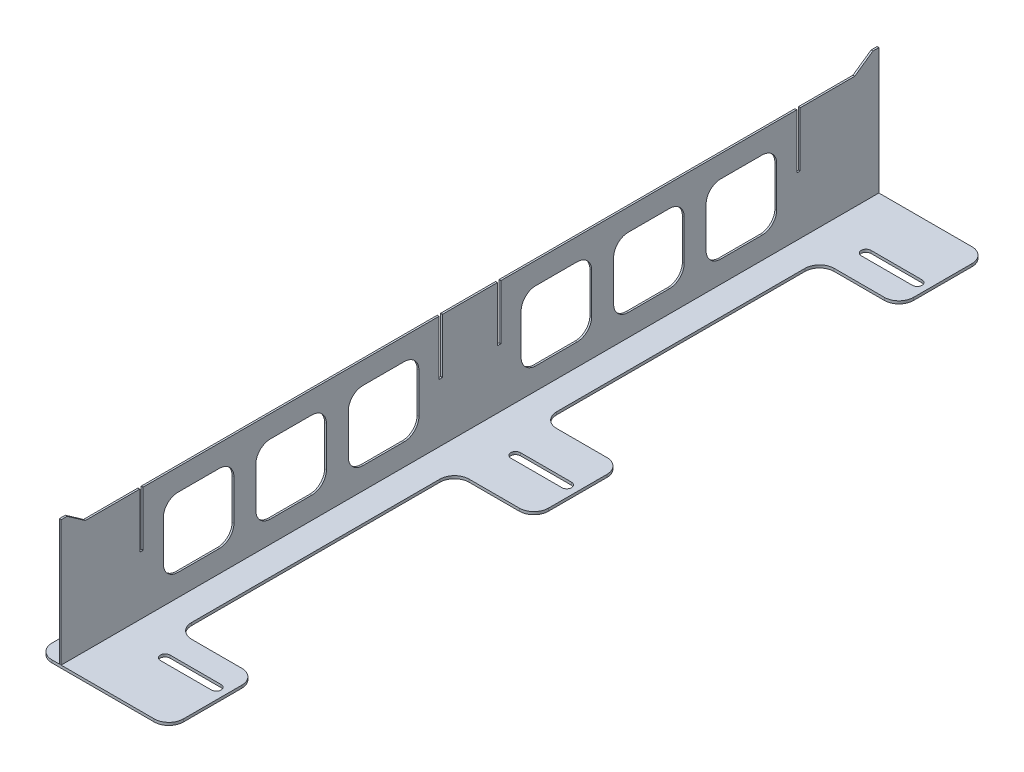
ISO-10303-21;
HEADER;
FILE_DESCRIPTION(('STEP AP214'),'2;1');
FILE_NAME('part.step','',(''),(''),'','','');
FILE_SCHEMA(('AUTOMOTIVE_DESIGN { 1 0 10303 214 1 1 1 1 }'));
ENDSEC;
DATA;
#1=APPLICATION_CONTEXT('core data for automotive mechanical design processes');
#2=APPLICATION_PROTOCOL_DEFINITION('international standard','automotive_design',2000,#1);
#3=PRODUCT_CONTEXT('',#1,'mechanical');
#4=PRODUCT('Part','Part','',(#3));
#5=PRODUCT_RELATED_PRODUCT_CATEGORY('part','',(#4));
#6=PRODUCT_DEFINITION_FORMATION('','',#4);
#7=PRODUCT_DEFINITION_CONTEXT('part definition',#1,'design');
#8=PRODUCT_DEFINITION('design','',#6,#7);
#9=PRODUCT_DEFINITION_SHAPE('','',#8);
#10=(LENGTH_UNIT() NAMED_UNIT(*) SI_UNIT(.MILLI.,.METRE.));
#11=(NAMED_UNIT(*) PLANE_ANGLE_UNIT() SI_UNIT($,.RADIAN.));
#12=(NAMED_UNIT(*) SI_UNIT($,.STERADIAN.) SOLID_ANGLE_UNIT());
#13=UNCERTAINTY_MEASURE_WITH_UNIT(LENGTH_MEASURE(1.E-05),#10,'distance_accuracy_value','');
#14=(GEOMETRIC_REPRESENTATION_CONTEXT(3) GLOBAL_UNCERTAINTY_ASSIGNED_CONTEXT((#13)) GLOBAL_UNIT_ASSIGNED_CONTEXT((#10,
#11,#12)) REPRESENTATION_CONTEXT('',''));
#15=CARTESIAN_POINT('',(0.,0.,0.));
#16=DIRECTION('',(0.,0.,1.));
#17=DIRECTION('',(1.,0.,0.));
#18=AXIS2_PLACEMENT_3D('',#15,#16,#17);
#19=CARTESIAN_POINT('',(3.175,402.463,1149.35));
#20=DIRECTION('',(-1.,0.,0.));
#21=DIRECTION('',(0.,0.,1.));
#22=AXIS2_PLACEMENT_3D('',#19,#20,#21);
#23=PLANE('',#22);
#24=CARTESIAN_POINT('',(3.175,136.525,-694.266666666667));
#25=DIRECTION('',(1.,0.,0.));
#26=DIRECTION('',(0.,0.,-1.));
#27=AXIS2_PLACEMENT_3D('',#24,#25,#26);
#28=CIRCLE('',#27,50.8);
#29=CARTESIAN_POINT('',(3.175,85.725,-694.266666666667));
#30=VERTEX_POINT('',#29);
#31=CARTESIAN_POINT('',(3.175,136.525,-745.066666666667));
#32=VERTEX_POINT('',#31);
#33=EDGE_CURVE('E653',#30,#32,#28,.T.);
#34=ORIENTED_EDGE('',*,*,#33,.F.);
#35=DIRECTION('',(0.,0.,-1.));
#36=VECTOR('',#35,1.);
#37=CARTESIAN_POINT('',(3.175,85.725,-694.266666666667));
#38=LINE('',#37,#36);
#39=CARTESIAN_POINT('',(3.175,85.725,-550.333333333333));
#40=VERTEX_POINT('',#39);
#41=EDGE_CURVE('E669',#40,#30,#38,.T.);
#42=ORIENTED_EDGE('',*,*,#41,.F.);
#43=CARTESIAN_POINT('',(3.175,136.525,-550.333333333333));
#44=DIRECTION('',(1.,0.,0.));
#45=DIRECTION('',(0.,0.,-1.));
#46=AXIS2_PLACEMENT_3D('',#43,#44,#45);
#47=CIRCLE('',#46,50.8);
#48=CARTESIAN_POINT('',(3.175,136.525,-499.533333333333));
#49=VERTEX_POINT('',#48);
#50=EDGE_CURVE('E666',#49,#40,#47,.T.);
#51=ORIENTED_EDGE('',*,*,#50,.F.);
#52=DIRECTION('',(0.,-1.,0.));
#53=VECTOR('',#52,1.);
#54=CARTESIAN_POINT('',(3.175,276.225,-499.533333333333));
#55=LINE('',#54,#53);
#56=CARTESIAN_POINT('',(3.175,276.225,-499.533333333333));
#57=VERTEX_POINT('',#56);
#58=EDGE_CURVE('E664',#57,#49,#55,.T.);
#59=ORIENTED_EDGE('',*,*,#58,.F.);
#60=CARTESIAN_POINT('',(3.175,276.225,-550.333333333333));
#61=DIRECTION('',(1.,0.,0.));
#62=DIRECTION('',(0.,0.,-1.));
#63=AXIS2_PLACEMENT_3D('',#60,#61,#62);
#64=CIRCLE('',#63,50.8);
#65=CARTESIAN_POINT('',(3.175,327.025,-550.333333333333));
#66=VERTEX_POINT('',#65);
#67=EDGE_CURVE('E662',#66,#57,#64,.T.);
#68=ORIENTED_EDGE('',*,*,#67,.F.);
#69=DIRECTION('',(0.,0.,1.));
#70=VECTOR('',#69,1.);
#71=CARTESIAN_POINT('',(3.175,327.025,-694.266666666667));
#72=LINE('',#71,#70);
#73=CARTESIAN_POINT('',(3.175,327.025,-694.266666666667));
#74=VERTEX_POINT('',#73);
#75=EDGE_CURVE('E660',#74,#66,#72,.T.);
#76=ORIENTED_EDGE('',*,*,#75,.F.);
#77=CARTESIAN_POINT('',(3.175,276.225,-694.266666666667));
#78=DIRECTION('',(1.,0.,0.));
#79=DIRECTION('',(0.,0.,-1.));
#80=AXIS2_PLACEMENT_3D('',#77,#78,#79);
#81=CIRCLE('',#80,50.8);
#82=CARTESIAN_POINT('',(3.175,276.225,-745.066666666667));
#83=VERTEX_POINT('',#82);
#84=EDGE_CURVE('E658',#83,#74,#81,.T.);
#85=ORIENTED_EDGE('',*,*,#84,.F.);
#86=DIRECTION('',(0.,1.,0.));
#87=VECTOR('',#86,1.);
#88=CARTESIAN_POINT('',(3.175,276.225,-745.066666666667));
#89=LINE('',#88,#87);
#90=EDGE_CURVE('E655',#32,#83,#89,.T.);
#91=ORIENTED_EDGE('',*,*,#90,.F.);
#92=EDGE_LOOP('',(#34,#42,#51,#59,#68,#76,#85,#91));
#93=FACE_BOUND('',#92,.T.);
#94=CARTESIAN_POINT('',(3.175,136.525,1016.));
#95=DIRECTION('',(1.,0.,0.));
#96=DIRECTION('',(0.,0.,-1.));
#97=AXIS2_PLACEMENT_3D('',#94,#95,#96);
#98=CIRCLE('',#97,50.8);
#99=CARTESIAN_POINT('',(3.175,136.525,1066.8));
#100=VERTEX_POINT('',#99);
#101=CARTESIAN_POINT('',(3.175,85.725,1016.));
#102=VERTEX_POINT('',#101);
#103=EDGE_CURVE('E771',#100,#102,#98,.T.);
#104=ORIENTED_EDGE('',*,*,#103,.F.);
#105=DIRECTION('',(0.,-1.,0.));
#106=VECTOR('',#105,1.);
#107=CARTESIAN_POINT('',(3.175,276.225,1066.8));
#108=LINE('',#107,#106);
#109=CARTESIAN_POINT('',(3.175,276.225,1066.8));
#110=VERTEX_POINT('',#109);
#111=EDGE_CURVE('E787',#110,#100,#108,.T.);
#112=ORIENTED_EDGE('',*,*,#111,.F.);
#113=CARTESIAN_POINT('',(3.175,276.225,1016.));
#114=DIRECTION('',(1.,0.,0.));
#115=DIRECTION('',(0.,0.,-1.));
#116=AXIS2_PLACEMENT_3D('',#113,#114,#115);
#117=CIRCLE('',#116,50.8);
#118=CARTESIAN_POINT('',(3.175,327.025,1016.));
#119=VERTEX_POINT('',#118);
#120=EDGE_CURVE('E784',#119,#110,#117,.T.);
#121=ORIENTED_EDGE('',*,*,#120,.F.);
#122=DIRECTION('',(0.,0.,1.));
#123=VECTOR('',#122,1.);
#124=CARTESIAN_POINT('',(3.175,327.025,1016.));
#125=LINE('',#124,#123);
#126=CARTESIAN_POINT('',(3.175,327.025,872.066666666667));
#127=VERTEX_POINT('',#126);
#128=EDGE_CURVE('E782',#127,#119,#125,.T.);
#129=ORIENTED_EDGE('',*,*,#128,.F.);
#130=CARTESIAN_POINT('',(3.175,276.225,872.066666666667));
#131=DIRECTION('',(1.,0.,0.));
#132=DIRECTION('',(0.,0.,-1.));
#133=AXIS2_PLACEMENT_3D('',#130,#131,#132);
#134=CIRCLE('',#133,50.8);
#135=CARTESIAN_POINT('',(3.175,276.225,821.266666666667));
#136=VERTEX_POINT('',#135);
#137=EDGE_CURVE('E780',#136,#127,#134,.T.);
#138=ORIENTED_EDGE('',*,*,#137,.F.);
#139=DIRECTION('',(0.,1.,0.));
#140=VECTOR('',#139,1.);
#141=CARTESIAN_POINT('',(3.175,276.225,821.266666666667));
#142=LINE('',#141,#140);
#143=CARTESIAN_POINT('',(3.175,136.525,821.266666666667));
#144=VERTEX_POINT('',#143);
#145=EDGE_CURVE('E778',#144,#136,#142,.T.);
#146=ORIENTED_EDGE('',*,*,#145,.F.);
#147=CARTESIAN_POINT('',(3.175,136.525,872.066666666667));
#148=DIRECTION('',(1.,0.,0.));
#149=DIRECTION('',(0.,0.,-1.));
#150=AXIS2_PLACEMENT_3D('',#147,#148,#149);
#151=CIRCLE('',#150,50.8);
#152=CARTESIAN_POINT('',(3.175,85.725,872.066666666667));
#153=VERTEX_POINT('',#152);
#154=EDGE_CURVE('E776',#153,#144,#151,.T.);
#155=ORIENTED_EDGE('',*,*,#154,.F.);
#156=DIRECTION('',(0.,0.,-1.));
#157=VECTOR('',#156,1.);
#158=CARTESIAN_POINT('',(3.175,85.725,1016.));
#159=LINE('',#158,#157);
#160=EDGE_CURVE('E773',#102,#153,#159,.T.);
#161=ORIENTED_EDGE('',*,*,#160,.F.);
#162=EDGE_LOOP('',(#104,#112,#121,#129,#138,#146,#155,#161));
#163=FACE_BOUND('',#162,.T.);
#164=CARTESIAN_POINT('',(3.175,136.525,372.533333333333));
#165=DIRECTION('',(1.,0.,0.));
#166=DIRECTION('',(0.,0.,-1.));
#167=AXIS2_PLACEMENT_3D('',#164,#165,#166);
#168=CIRCLE('',#167,50.8);
#169=CARTESIAN_POINT('',(3.175,136.525,423.333333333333));
#170=VERTEX_POINT('',#169);
#171=CARTESIAN_POINT('',(3.175,85.725,372.533333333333));
#172=VERTEX_POINT('',#171);
#173=EDGE_CURVE('E889',#170,#172,#168,.T.);
#174=ORIENTED_EDGE('',*,*,#173,.F.);
#175=DIRECTION('',(0.,-1.,0.));
#176=VECTOR('',#175,1.);
#177=CARTESIAN_POINT('',(3.175,276.225,423.333333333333));
#178=LINE('',#177,#176);
#179=CARTESIAN_POINT('',(3.175,276.225,423.333333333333));
#180=VERTEX_POINT('',#179);
#181=EDGE_CURVE('E905',#180,#170,#178,.T.);
#182=ORIENTED_EDGE('',*,*,#181,.F.);
#183=CARTESIAN_POINT('',(3.175,276.225,372.533333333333));
#184=DIRECTION('',(1.,0.,0.));
#185=DIRECTION('',(0.,0.,-1.));
#186=AXIS2_PLACEMENT_3D('',#183,#184,#185);
#187=CIRCLE('',#186,50.8);
#188=CARTESIAN_POINT('',(3.175,327.025,372.533333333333));
#189=VERTEX_POINT('',#188);
#190=EDGE_CURVE('E902',#189,#180,#187,.T.);
#191=ORIENTED_EDGE('',*,*,#190,.F.);
#192=DIRECTION('',(0.,0.,1.));
#193=VECTOR('',#192,1.);
#194=CARTESIAN_POINT('',(3.175,327.025,372.533333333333));
#195=LINE('',#194,#193);
#196=CARTESIAN_POINT('',(3.175,327.025,228.6));
#197=VERTEX_POINT('',#196);
#198=EDGE_CURVE('E900',#197,#189,#195,.T.);
#199=ORIENTED_EDGE('',*,*,#198,.F.);
#200=CARTESIAN_POINT('',(3.175,276.225,228.6));
#201=DIRECTION('',(1.,0.,0.));
#202=DIRECTION('',(0.,0.,-1.));
#203=AXIS2_PLACEMENT_3D('',#200,#201,#202);
#204=CIRCLE('',#203,50.8);
#205=CARTESIAN_POINT('',(3.175,276.225,177.8));
#206=VERTEX_POINT('',#205);
#207=EDGE_CURVE('E898',#206,#197,#204,.T.);
#208=ORIENTED_EDGE('',*,*,#207,.F.);
#209=DIRECTION('',(0.,1.,0.));
#210=VECTOR('',#209,1.);
#211=CARTESIAN_POINT('',(3.175,276.225,177.8));
#212=LINE('',#211,#210);
#213=CARTESIAN_POINT('',(3.175,136.525,177.8));
#214=VERTEX_POINT('',#213);
#215=EDGE_CURVE('E896',#214,#206,#212,.T.);
#216=ORIENTED_EDGE('',*,*,#215,.F.);
#217=CARTESIAN_POINT('',(3.175,136.525,228.6));
#218=DIRECTION('',(1.,0.,0.));
#219=DIRECTION('',(0.,0.,-1.));
#220=AXIS2_PLACEMENT_3D('',#217,#218,#219);
#221=CIRCLE('',#220,50.8);
#222=CARTESIAN_POINT('',(3.175,85.725,228.6));
#223=VERTEX_POINT('',#222);
#224=EDGE_CURVE('E894',#223,#214,#221,.T.);
#225=ORIENTED_EDGE('',*,*,#224,.F.);
#226=DIRECTION('',(0.,0.,-1.));
#227=VECTOR('',#226,1.);
#228=CARTESIAN_POINT('',(3.175,85.725,372.533333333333));
#229=LINE('',#228,#227);
#230=EDGE_CURVE('E891',#172,#223,#229,.T.);
#231=ORIENTED_EDGE('',*,*,#230,.F.);
#232=EDGE_LOOP('',(#174,#182,#191,#199,#208,#216,#225,#231));
#233=FACE_BOUND('',#232,.T.);
#234=DIRECTION('',(0.,-1.,0.));
#235=VECTOR('',#234,1.);
#236=CARTESIAN_POINT('',(3.175,9.52499999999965,1422.4));
#237=LINE('',#236,#235);
#238=CARTESIAN_POINT('',(3.175,447.674999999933,1422.4));
#239=VERTEX_POINT('',#238);
#240=CARTESIAN_POINT('',(3.175,9.52499999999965,1422.4));
#241=VERTEX_POINT('',#240);
#242=EDGE_CURVE('E948',#239,#241,#237,.T.);
#243=ORIENTED_EDGE('',*,*,#242,.T.);
#244=DIRECTION('',(0.,0.,-1.));
#245=VECTOR('',#244,1.);
#246=CARTESIAN_POINT('',(3.175,9.52499999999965,1422.4));
#247=LINE('',#246,#245);
#248=CARTESIAN_POINT('',(3.175,9.525,-1422.4));
#249=VERTEX_POINT('',#248);
#250=EDGE_CURVE('E951',#241,#249,#247,.T.);
#251=ORIENTED_EDGE('',*,*,#250,.T.);
#252=DIRECTION('',(0.,1.,0.));
#253=VECTOR('',#252,1.);
#254=CARTESIAN_POINT('',(3.175,9.525,-1422.4));
#255=LINE('',#254,#253);
#256=CARTESIAN_POINT('',(3.175,447.674999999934,-1422.4));
#257=VERTEX_POINT('',#256);
#258=EDGE_CURVE('E954',#249,#257,#255,.T.);
#259=ORIENTED_EDGE('',*,*,#258,.T.);
#260=DIRECTION('',(0.,0.,1.));
#261=VECTOR('',#260,1.);
#262=CARTESIAN_POINT('',(3.175,447.674999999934,-1401.74367889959));
#263=LINE('',#262,#261);
#264=CARTESIAN_POINT('',(3.175,447.674999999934,-1401.74367889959));
#265=VERTEX_POINT('',#264);
#266=EDGE_CURVE('E956',#257,#265,#263,.T.);
#267=ORIENTED_EDGE('',*,*,#266,.T.);
#268=DIRECTION('',(0.,-0.573576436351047,0.819152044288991));
#269=VECTOR('',#268,1.);
#270=CARTESIAN_POINT('',(3.175,403.225,-1338.2625));
#271=LINE('',#270,#269);
#272=CARTESIAN_POINT('',(3.175,403.225,-1338.2625));
#273=VERTEX_POINT('',#272);
#274=EDGE_CURVE('E958',#265,#273,#271,.T.);
#275=ORIENTED_EDGE('',*,*,#274,.T.);
#276=DIRECTION('',(0.,0.,1.));
#277=VECTOR('',#276,1.);
#278=CARTESIAN_POINT('',(3.175,403.225,-1149.35));
#279=LINE('',#278,#277);
#280=CARTESIAN_POINT('',(3.175,403.225,-1149.35));
#281=VERTEX_POINT('',#280);
#282=EDGE_CURVE('E960',#273,#281,#279,.T.);
#283=ORIENTED_EDGE('',*,*,#282,.T.);
#284=CARTESIAN_POINT('',(3.175,402.463,-1149.35));
#285=DIRECTION('',(1.,0.,0.));
#286=DIRECTION('',(0.,0.,-1.));
#287=AXIS2_PLACEMENT_3D('',#284,#285,#286);
#288=CIRCLE('',#287,0.761999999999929);
#289=CARTESIAN_POINT('',(3.175,402.463,-1148.588));
#290=VERTEX_POINT('',#289);
#291=EDGE_CURVE('E962',#281,#290,#288,.T.);
#292=ORIENTED_EDGE('',*,*,#291,.T.);
#293=DIRECTION('',(0.,-1.,0.));
#294=VECTOR('',#293,1.);
#295=CARTESIAN_POINT('',(3.175,402.463,-1148.588));
#296=LINE('',#295,#294);
#297=CARTESIAN_POINT('',(3.175,213.487000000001,-1148.588));
#298=VERTEX_POINT('',#297);
#299=EDGE_CURVE('E964',#290,#298,#296,.T.);
#300=ORIENTED_EDGE('',*,*,#299,.T.);
#301=CARTESIAN_POINT('',(3.175,213.487000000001,-1147.826));
#302=DIRECTION('',(-1.,0.,0.));
#303=DIRECTION('',(0.,0.,1.));
#304=AXIS2_PLACEMENT_3D('',#301,#302,#303);
#305=CIRCLE('',#304,0.761999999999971);
#306=CARTESIAN_POINT('',(3.175,212.725000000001,-1147.826));
#307=VERTEX_POINT('',#306);
#308=EDGE_CURVE('E966',#298,#307,#305,.T.);
#309=ORIENTED_EDGE('',*,*,#308,.T.);
#310=DIRECTION('',(0.,0.,1.));
#311=VECTOR('',#310,1.);
#312=CARTESIAN_POINT('',(3.175,212.725000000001,-1138.174));
#313=LINE('',#312,#311);
#314=CARTESIAN_POINT('',(3.175,212.725000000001,-1138.174));
#315=VERTEX_POINT('',#314);
#316=EDGE_CURVE('E968',#307,#315,#313,.T.);
#317=ORIENTED_EDGE('',*,*,#316,.T.);
#318=CARTESIAN_POINT('',(3.175,213.487000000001,-1138.174));
#319=DIRECTION('',(-1.,0.,0.));
#320=DIRECTION('',(0.,0.,1.));
#321=AXIS2_PLACEMENT_3D('',#318,#319,#320);
#322=CIRCLE('',#321,0.761999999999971);
#323=CARTESIAN_POINT('',(3.175,213.487000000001,-1137.412));
#324=VERTEX_POINT('',#323);
#325=EDGE_CURVE('E970',#315,#324,#322,.T.);
#326=ORIENTED_EDGE('',*,*,#325,.T.);
#327=DIRECTION('',(0.,1.,0.));
#328=VECTOR('',#327,1.);
#329=CARTESIAN_POINT('',(3.175,402.463,-1137.412));
#330=LINE('',#329,#328);
#331=CARTESIAN_POINT('',(3.175,402.463,-1137.412));
#332=VERTEX_POINT('',#331);
#333=EDGE_CURVE('E972',#324,#332,#330,.T.);
#334=ORIENTED_EDGE('',*,*,#333,.T.);
#335=CARTESIAN_POINT('',(3.175,402.463,-1136.65));
#336=DIRECTION('',(1.,0.,0.));
#337=DIRECTION('',(0.,0.,-1.));
#338=AXIS2_PLACEMENT_3D('',#335,#336,#337);
#339=CIRCLE('',#338,0.761999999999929);
#340=CARTESIAN_POINT('',(3.175,403.225,-1136.65));
#341=VERTEX_POINT('',#340);
#342=EDGE_CURVE('E974',#332,#341,#339,.T.);
#343=ORIENTED_EDGE('',*,*,#342,.T.);
#344=DIRECTION('',(0.,0.,1.));
#345=VECTOR('',#344,1.);
#346=CARTESIAN_POINT('',(3.175,403.225,-107.95));
#347=LINE('',#346,#345);
#348=CARTESIAN_POINT('',(3.175,403.225,-107.95));
#349=VERTEX_POINT('',#348);
#350=EDGE_CURVE('E976',#341,#349,#347,.T.);
#351=ORIENTED_EDGE('',*,*,#350,.T.);
#352=CARTESIAN_POINT('',(3.175,402.463,-107.95));
#353=DIRECTION('',(1.,0.,0.));
#354=DIRECTION('',(0.,0.,-1.));
#355=AXIS2_PLACEMENT_3D('',#352,#353,#354);
#356=CIRCLE('',#355,0.761999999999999);
#357=CARTESIAN_POINT('',(3.175,402.463,-107.188));
#358=VERTEX_POINT('',#357);
#359=EDGE_CURVE('E978',#349,#358,#356,.T.);
#360=ORIENTED_EDGE('',*,*,#359,.T.);
#361=DIRECTION('',(0.,-1.,0.));
#362=VECTOR('',#361,1.);
#363=CARTESIAN_POINT('',(3.175,402.463,-107.188));
#364=LINE('',#363,#362);
#365=CARTESIAN_POINT('',(3.175,213.487,-107.188));
#366=VERTEX_POINT('',#365);
#367=EDGE_CURVE('E980',#358,#366,#364,.T.);
#368=ORIENTED_EDGE('',*,*,#367,.T.);
#369=CARTESIAN_POINT('',(3.175,213.487,-106.426));
#370=DIRECTION('',(-1.,0.,0.));
#371=DIRECTION('',(0.,0.,-1.));
#372=AXIS2_PLACEMENT_3D('',#369,#370,#371);
#373=CIRCLE('',#372,0.762000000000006);
#374=CARTESIAN_POINT('',(3.175,212.725,-106.426));
#375=VERTEX_POINT('',#374);
#376=EDGE_CURVE('E982',#366,#375,#373,.T.);
#377=ORIENTED_EDGE('',*,*,#376,.T.);
#378=DIRECTION('',(0.,0.,1.));
#379=VECTOR('',#378,1.);
#380=CARTESIAN_POINT('',(3.175,212.725,-106.426));
#381=LINE('',#380,#379);
#382=CARTESIAN_POINT('',(3.175,212.725,-96.774));
#383=VERTEX_POINT('',#382);
#384=EDGE_CURVE('E984',#375,#383,#381,.T.);
#385=ORIENTED_EDGE('',*,*,#384,.T.);
#386=CARTESIAN_POINT('',(3.175,213.487,-96.774));
#387=DIRECTION('',(-1.,0.,0.));
#388=DIRECTION('',(0.,0.,-1.));
#389=AXIS2_PLACEMENT_3D('',#386,#387,#388);
#390=CIRCLE('',#389,0.762000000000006);
#391=CARTESIAN_POINT('',(3.175,213.487,-96.012));
#392=VERTEX_POINT('',#391);
#393=EDGE_CURVE('E986',#383,#392,#390,.T.);
#394=ORIENTED_EDGE('',*,*,#393,.T.);
#395=DIRECTION('',(0.,1.,0.));
#396=VECTOR('',#395,1.);
#397=CARTESIAN_POINT('',(3.175,402.463,-96.0120000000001));
#398=LINE('',#397,#396);
#399=CARTESIAN_POINT('',(3.175,402.463,-96.0120000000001));
#400=VERTEX_POINT('',#399);
#401=EDGE_CURVE('E988',#392,#400,#398,.T.);
#402=ORIENTED_EDGE('',*,*,#401,.T.);
#403=CARTESIAN_POINT('',(3.175,402.463,-95.25));
#404=DIRECTION('',(1.,0.,0.));
#405=DIRECTION('',(0.,0.,-1.));
#406=AXIS2_PLACEMENT_3D('',#403,#404,#405);
#407=CIRCLE('',#406,0.762000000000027);
#408=CARTESIAN_POINT('',(3.175,403.225,-95.25));
#409=VERTEX_POINT('',#408);
#410=EDGE_CURVE('E990',#400,#409,#407,.T.);
#411=ORIENTED_EDGE('',*,*,#410,.T.);
#412=DIRECTION('',(0.,0.,1.));
#413=VECTOR('',#412,1.);
#414=CARTESIAN_POINT('',(3.175,403.225,95.25));
#415=LINE('',#414,#413);
#416=CARTESIAN_POINT('',(3.175,403.225,95.25));
#417=VERTEX_POINT('',#416);
#418=EDGE_CURVE('E992',#409,#417,#415,.T.);
#419=ORIENTED_EDGE('',*,*,#418,.T.);
#420=CARTESIAN_POINT('',(3.175,402.463,95.25));
#421=DIRECTION('',(1.,0.,0.));
#422=DIRECTION('',(0.,0.,1.));
#423=AXIS2_PLACEMENT_3D('',#420,#421,#422);
#424=CIRCLE('',#423,0.762000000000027);
#425=CARTESIAN_POINT('',(3.175,402.463,96.0120000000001));
#426=VERTEX_POINT('',#425);
#427=EDGE_CURVE('E994',#417,#426,#424,.T.);
#428=ORIENTED_EDGE('',*,*,#427,.T.);
#429=DIRECTION('',(0.,-1.,0.));
#430=VECTOR('',#429,1.);
#431=CARTESIAN_POINT('',(3.175,402.463,96.0120000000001));
#432=LINE('',#431,#430);
#433=CARTESIAN_POINT('',(3.175,213.487,96.012));
#434=VERTEX_POINT('',#433);
#435=EDGE_CURVE('E996',#426,#434,#432,.T.);
#436=ORIENTED_EDGE('',*,*,#435,.T.);
#437=CARTESIAN_POINT('',(3.175,213.487,96.774));
#438=DIRECTION('',(-1.,0.,0.));
#439=DIRECTION('',(0.,0.,1.));
#440=AXIS2_PLACEMENT_3D('',#437,#438,#439);
#441=CIRCLE('',#440,0.762000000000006);
#442=CARTESIAN_POINT('',(3.175,212.725,96.774));
#443=VERTEX_POINT('',#442);
#444=EDGE_CURVE('E998',#434,#443,#441,.T.);
#445=ORIENTED_EDGE('',*,*,#444,.T.);
#446=DIRECTION('',(0.,0.,1.));
#447=VECTOR('',#446,1.);
#448=CARTESIAN_POINT('',(3.175,212.725,106.426));
#449=LINE('',#448,#447);
#450=CARTESIAN_POINT('',(3.175,212.725,106.426));
#451=VERTEX_POINT('',#450);
#452=EDGE_CURVE('E1000',#443,#451,#449,.T.);
#453=ORIENTED_EDGE('',*,*,#452,.T.);
#454=CARTESIAN_POINT('',(3.175,213.487,106.426));
#455=DIRECTION('',(-1.,0.,0.));
#456=DIRECTION('',(0.,0.,1.));
#457=AXIS2_PLACEMENT_3D('',#454,#455,#456);
#458=CIRCLE('',#457,0.762000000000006);
#459=CARTESIAN_POINT('',(3.175,213.487,107.188));
#460=VERTEX_POINT('',#459);
#461=EDGE_CURVE('E1002',#451,#460,#458,.T.);
#462=ORIENTED_EDGE('',*,*,#461,.T.);
#463=DIRECTION('',(0.,1.,0.));
#464=VECTOR('',#463,1.);
#465=CARTESIAN_POINT('',(3.175,402.463,107.188));
#466=LINE('',#465,#464);
#467=CARTESIAN_POINT('',(3.175,402.463,107.188));
#468=VERTEX_POINT('',#467);
#469=EDGE_CURVE('E1004',#460,#468,#466,.T.);
#470=ORIENTED_EDGE('',*,*,#469,.T.);
#471=CARTESIAN_POINT('',(3.175,402.463,107.95));
#472=DIRECTION('',(1.,0.,0.));
#473=DIRECTION('',(0.,0.,1.));
#474=AXIS2_PLACEMENT_3D('',#471,#472,#473);
#475=CIRCLE('',#474,0.761999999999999);
#476=CARTESIAN_POINT('',(3.175,403.225,107.95));
#477=VERTEX_POINT('',#476);
#478=EDGE_CURVE('E1006',#468,#477,#475,.T.);
#479=ORIENTED_EDGE('',*,*,#478,.T.);
#480=DIRECTION('',(0.,0.,1.));
#481=VECTOR('',#480,1.);
#482=CARTESIAN_POINT('',(3.175,403.225,1136.65));
#483=LINE('',#482,#481);
#484=CARTESIAN_POINT('',(3.175,403.225,1136.65));
#485=VERTEX_POINT('',#484);
#486=EDGE_CURVE('E1008',#477,#485,#483,.T.);
#487=ORIENTED_EDGE('',*,*,#486,.T.);
#488=CARTESIAN_POINT('',(3.175,402.463,1136.65));
#489=DIRECTION('',(1.,0.,0.));
#490=DIRECTION('',(0.,0.,-1.));
#491=AXIS2_PLACEMENT_3D('',#488,#489,#490);
#492=CIRCLE('',#491,0.761999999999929);
#493=CARTESIAN_POINT('',(3.175,402.463,1137.412));
#494=VERTEX_POINT('',#493);
#495=EDGE_CURVE('E1010',#485,#494,#492,.T.);
#496=ORIENTED_EDGE('',*,*,#495,.T.);
#497=DIRECTION('',(0.,-1.,0.));
#498=VECTOR('',#497,1.);
#499=CARTESIAN_POINT('',(3.175,402.463,1137.412));
#500=LINE('',#499,#498);
#501=CARTESIAN_POINT('',(3.175,213.487,1137.412));
#502=VERTEX_POINT('',#501);
#503=EDGE_CURVE('E1012',#494,#502,#500,.T.);
#504=ORIENTED_EDGE('',*,*,#503,.T.);
#505=CARTESIAN_POINT('',(3.175,213.487,1138.174));
#506=DIRECTION('',(-1.,0.,0.));
#507=DIRECTION('',(0.,0.,1.));
#508=AXIS2_PLACEMENT_3D('',#505,#506,#507);
#509=CIRCLE('',#508,0.761999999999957);
#510=CARTESIAN_POINT('',(3.175,212.725,1138.174));
#511=VERTEX_POINT('',#510);
#512=EDGE_CURVE('E1014',#502,#511,#509,.T.);
#513=ORIENTED_EDGE('',*,*,#512,.T.);
#514=DIRECTION('',(0.,0.,1.));
#515=VECTOR('',#514,1.);
#516=CARTESIAN_POINT('',(3.175,212.725,1147.826));
#517=LINE('',#516,#515);
#518=CARTESIAN_POINT('',(3.175,212.725,1147.826));
#519=VERTEX_POINT('',#518);
#520=EDGE_CURVE('E1016',#511,#519,#517,.T.);
#521=ORIENTED_EDGE('',*,*,#520,.T.);
#522=CARTESIAN_POINT('',(3.175,213.487,1147.826));
#523=DIRECTION('',(-1.,0.,0.));
#524=DIRECTION('',(0.,0.,-1.));
#525=AXIS2_PLACEMENT_3D('',#522,#523,#524);
#526=CIRCLE('',#525,0.761999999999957);
#527=CARTESIAN_POINT('',(3.175,213.487,1148.588));
#528=VERTEX_POINT('',#527);
#529=EDGE_CURVE('E1018',#519,#528,#526,.T.);
#530=ORIENTED_EDGE('',*,*,#529,.T.);
#531=DIRECTION('',(0.,1.,0.));
#532=VECTOR('',#531,1.);
#533=CARTESIAN_POINT('',(3.175,402.463,1148.588));
#534=LINE('',#533,#532);
#535=CARTESIAN_POINT('',(3.175,402.463,1148.588));
#536=VERTEX_POINT('',#535);
#537=EDGE_CURVE('E1020',#528,#536,#534,.T.);
#538=ORIENTED_EDGE('',*,*,#537,.T.);
#539=CARTESIAN_POINT('',(3.175,402.463,1149.35));
#540=DIRECTION('',(1.,0.,0.));
#541=DIRECTION('',(0.,0.,1.));
#542=AXIS2_PLACEMENT_3D('',#539,#540,#541);
#543=CIRCLE('',#542,0.761999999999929);
#544=CARTESIAN_POINT('',(3.175,403.225,1149.35));
#545=VERTEX_POINT('',#544);
#546=EDGE_CURVE('E1022',#536,#545,#543,.T.);
#547=ORIENTED_EDGE('',*,*,#546,.T.);
#548=DIRECTION('',(0.,0.,1.));
#549=VECTOR('',#548,1.);
#550=CARTESIAN_POINT('',(3.175,403.225,1338.2625));
#551=LINE('',#550,#549);
#552=CARTESIAN_POINT('',(3.175,403.225,1338.2625));
#553=VERTEX_POINT('',#552);
#554=EDGE_CURVE('E1024',#545,#553,#551,.T.);
#555=ORIENTED_EDGE('',*,*,#554,.T.);
#556=DIRECTION('',(0.,0.573576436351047,0.819152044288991));
#557=VECTOR('',#556,1.);
#558=CARTESIAN_POINT('',(3.175,403.225,1338.2625));
#559=LINE('',#558,#557);
#560=CARTESIAN_POINT('',(3.175,447.674999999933,1401.74367889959));
#561=VERTEX_POINT('',#560);
#562=EDGE_CURVE('E1026',#553,#561,#559,.T.);
#563=ORIENTED_EDGE('',*,*,#562,.T.);
#564=DIRECTION('',(0.,0.,1.));
#565=VECTOR('',#564,1.);
#566=CARTESIAN_POINT('',(3.175,447.674999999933,1401.74367889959));
#567=LINE('',#566,#565);
#568=EDGE_CURVE('E1028',#561,#239,#567,.T.);
#569=ORIENTED_EDGE('',*,*,#568,.T.);
#570=EDGE_LOOP('',(#243,#251,#259,#267,#275,#283,#292,#300,#309,#317,#326,#334,#343,#351,#360,
#368,#377,#385,#394,#402,#411,#419,#428,#436,#445,#453,#462,#470,#479,#487,#496,#504,#513,#521,
#530,#538,#547,#555,#563,#569));
#571=FACE_BOUND('',#570,.T.);
#572=CARTESIAN_POINT('',(3.175,276.225,694.266666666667));
#573=DIRECTION('',(1.,0.,0.));
#574=DIRECTION('',(0.,0.,1.));
#575=AXIS2_PLACEMENT_3D('',#572,#573,#574);
#576=CIRCLE('',#575,50.8);
#577=CARTESIAN_POINT('',(3.175,327.025,694.266666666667));
#578=VERTEX_POINT('',#577);
#579=CARTESIAN_POINT('',(3.175,276.225,745.066666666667));
#580=VERTEX_POINT('',#579);
#581=EDGE_CURVE('E830',#578,#580,#576,.T.);
#582=ORIENTED_EDGE('',*,*,#581,.F.);
#583=DIRECTION('',(0.,0.,1.));
#584=VECTOR('',#583,1.);
#585=CARTESIAN_POINT('',(3.175,327.025,694.266666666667));
#586=LINE('',#585,#584);
#587=CARTESIAN_POINT('',(3.175,327.025,550.333333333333));
#588=VERTEX_POINT('',#587);
#589=EDGE_CURVE('E846',#588,#578,#586,.T.);
#590=ORIENTED_EDGE('',*,*,#589,.F.);
#591=CARTESIAN_POINT('',(3.175,276.225,550.333333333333));
#592=DIRECTION('',(1.,0.,0.));
#593=DIRECTION('',(0.,0.,1.));
#594=AXIS2_PLACEMENT_3D('',#591,#592,#593);
#595=CIRCLE('',#594,50.8);
#596=CARTESIAN_POINT('',(3.175,276.225,499.533333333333));
#597=VERTEX_POINT('',#596);
#598=EDGE_CURVE('E843',#597,#588,#595,.T.);
#599=ORIENTED_EDGE('',*,*,#598,.F.);
#600=DIRECTION('',(0.,1.,0.));
#601=VECTOR('',#600,1.);
#602=CARTESIAN_POINT('',(3.175,276.225,499.533333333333));
#603=LINE('',#602,#601);
#604=CARTESIAN_POINT('',(3.175,136.525,499.533333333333));
#605=VERTEX_POINT('',#604);
#606=EDGE_CURVE('E841',#605,#597,#603,.T.);
#607=ORIENTED_EDGE('',*,*,#606,.F.);
#608=CARTESIAN_POINT('',(3.175,136.525,550.333333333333));
#609=DIRECTION('',(1.,0.,0.));
#610=DIRECTION('',(0.,0.,1.));
#611=AXIS2_PLACEMENT_3D('',#608,#609,#610);
#612=CIRCLE('',#611,50.8);
#613=CARTESIAN_POINT('',(3.175,85.725,550.333333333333));
#614=VERTEX_POINT('',#613);
#615=EDGE_CURVE('E839',#614,#605,#612,.T.);
#616=ORIENTED_EDGE('',*,*,#615,.F.);
#617=DIRECTION('',(0.,0.,-1.));
#618=VECTOR('',#617,1.);
#619=CARTESIAN_POINT('',(3.175,85.725,694.266666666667));
#620=LINE('',#619,#618);
#621=CARTESIAN_POINT('',(3.175,85.725,694.266666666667));
#622=VERTEX_POINT('',#621);
#623=EDGE_CURVE('E837',#622,#614,#620,.T.);
#624=ORIENTED_EDGE('',*,*,#623,.F.);
#625=CARTESIAN_POINT('',(3.175,136.525,694.266666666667));
#626=DIRECTION('',(1.,0.,0.));
#627=DIRECTION('',(0.,0.,1.));
#628=AXIS2_PLACEMENT_3D('',#625,#626,#627);
#629=CIRCLE('',#628,50.8);
#630=CARTESIAN_POINT('',(3.175,136.525,745.066666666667));
#631=VERTEX_POINT('',#630);
#632=EDGE_CURVE('E835',#631,#622,#629,.T.);
#633=ORIENTED_EDGE('',*,*,#632,.F.);
#634=DIRECTION('',(0.,-1.,0.));
#635=VECTOR('',#634,1.);
#636=CARTESIAN_POINT('',(3.175,276.225,745.066666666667));
#637=LINE('',#636,#635);
#638=EDGE_CURVE('E832',#580,#631,#637,.T.);
#639=ORIENTED_EDGE('',*,*,#638,.F.);
#640=EDGE_LOOP('',(#582,#590,#599,#607,#616,#624,#633,#639));
#641=FACE_BOUND('',#640,.T.);
#642=CARTESIAN_POINT('',(3.175,276.225,-1016.));
#643=DIRECTION('',(1.,0.,0.));
#644=DIRECTION('',(0.,0.,1.));
#645=AXIS2_PLACEMENT_3D('',#642,#643,#644);
#646=CIRCLE('',#645,50.8);
#647=CARTESIAN_POINT('',(3.175,276.225,-1066.8));
#648=VERTEX_POINT('',#647);
#649=CARTESIAN_POINT('',(3.175,327.025,-1016.));
#650=VERTEX_POINT('',#649);
#651=EDGE_CURVE('E712',#648,#650,#646,.T.);
#652=ORIENTED_EDGE('',*,*,#651,.F.);
#653=DIRECTION('',(0.,1.,0.));
#654=VECTOR('',#653,1.);
#655=CARTESIAN_POINT('',(3.175,276.225,-1066.8));
#656=LINE('',#655,#654);
#657=CARTESIAN_POINT('',(3.175,136.525,-1066.8));
#658=VERTEX_POINT('',#657);
#659=EDGE_CURVE('E728',#658,#648,#656,.T.);
#660=ORIENTED_EDGE('',*,*,#659,.F.);
#661=CARTESIAN_POINT('',(3.175,136.525,-1016.));
#662=DIRECTION('',(1.,0.,0.));
#663=DIRECTION('',(0.,0.,1.));
#664=AXIS2_PLACEMENT_3D('',#661,#662,#663);
#665=CIRCLE('',#664,50.8);
#666=CARTESIAN_POINT('',(3.175,85.725,-1016.));
#667=VERTEX_POINT('',#666);
#668=EDGE_CURVE('E725',#667,#658,#665,.T.);
#669=ORIENTED_EDGE('',*,*,#668,.F.);
#670=DIRECTION('',(0.,0.,-1.));
#671=VECTOR('',#670,1.);
#672=CARTESIAN_POINT('',(3.175,85.725,-1016.));
#673=LINE('',#672,#671);
#674=CARTESIAN_POINT('',(3.175,85.725,-872.066666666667));
#675=VERTEX_POINT('',#674);
#676=EDGE_CURVE('E723',#675,#667,#673,.T.);
#677=ORIENTED_EDGE('',*,*,#676,.F.);
#678=CARTESIAN_POINT('',(3.175,136.525,-872.066666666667));
#679=DIRECTION('',(1.,0.,0.));
#680=DIRECTION('',(0.,0.,1.));
#681=AXIS2_PLACEMENT_3D('',#678,#679,#680);
#682=CIRCLE('',#681,50.8);
#683=CARTESIAN_POINT('',(3.175,136.525,-821.266666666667));
#684=VERTEX_POINT('',#683);
#685=EDGE_CURVE('E721',#684,#675,#682,.T.);
#686=ORIENTED_EDGE('',*,*,#685,.F.);
#687=DIRECTION('',(0.,-1.,0.));
#688=VECTOR('',#687,1.);
#689=CARTESIAN_POINT('',(3.175,276.225,-821.266666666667));
#690=LINE('',#689,#688);
#691=CARTESIAN_POINT('',(3.175,276.225,-821.266666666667));
#692=VERTEX_POINT('',#691);
#693=EDGE_CURVE('E719',#692,#684,#690,.T.);
#694=ORIENTED_EDGE('',*,*,#693,.F.);
#695=CARTESIAN_POINT('',(3.175,276.225,-872.066666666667));
#696=DIRECTION('',(1.,0.,0.));
#697=DIRECTION('',(0.,0.,1.));
#698=AXIS2_PLACEMENT_3D('',#695,#696,#697);
#699=CIRCLE('',#698,50.8);
#700=CARTESIAN_POINT('',(3.175,327.025,-872.066666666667));
#701=VERTEX_POINT('',#700);
#702=EDGE_CURVE('E717',#701,#692,#699,.T.);
#703=ORIENTED_EDGE('',*,*,#702,.F.);
#704=DIRECTION('',(0.,0.,1.));
#705=VECTOR('',#704,1.);
#706=CARTESIAN_POINT('',(3.175,327.025,-1016.));
#707=LINE('',#706,#705);
#708=EDGE_CURVE('E714',#650,#701,#707,.T.);
#709=ORIENTED_EDGE('',*,*,#708,.F.);
#710=EDGE_LOOP('',(#652,#660,#669,#677,#686,#694,#703,#709));
#711=FACE_BOUND('',#710,.T.);
#712=CARTESIAN_POINT('',(3.175,276.225,-372.533333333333));
#713=DIRECTION('',(1.,0.,0.));
#714=DIRECTION('',(0.,0.,1.));
#715=AXIS2_PLACEMENT_3D('',#712,#713,#714);
#716=CIRCLE('',#715,50.8);
#717=CARTESIAN_POINT('',(3.175,276.225,-423.333333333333));
#718=VERTEX_POINT('',#717);
#719=CARTESIAN_POINT('',(3.175,327.025,-372.533333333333));
#720=VERTEX_POINT('',#719);
#721=EDGE_CURVE('E588',#718,#720,#716,.T.);
#722=ORIENTED_EDGE('',*,*,#721,.F.);
#723=DIRECTION('',(0.,1.,0.));
#724=VECTOR('',#723,1.);
#725=CARTESIAN_POINT('',(3.175,276.225,-423.333333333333));
#726=LINE('',#725,#724);
#727=CARTESIAN_POINT('',(3.175,136.525,-423.333333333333));
#728=VERTEX_POINT('',#727);
#729=EDGE_CURVE('E621',#728,#718,#726,.T.);
#730=ORIENTED_EDGE('',*,*,#729,.F.);
#731=CARTESIAN_POINT('',(3.175,136.525,-372.533333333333));
#732=DIRECTION('',(1.,0.,0.));
#733=DIRECTION('',(0.,0.,1.));
#734=AXIS2_PLACEMENT_3D('',#731,#732,#733);
#735=CIRCLE('',#734,50.8);
#736=CARTESIAN_POINT('',(3.175,85.725,-372.533333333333));
#737=VERTEX_POINT('',#736);
#738=EDGE_CURVE('E619',#737,#728,#735,.T.);
#739=ORIENTED_EDGE('',*,*,#738,.F.);
#740=DIRECTION('',(0.,0.,-1.));
#741=VECTOR('',#740,1.);
#742=CARTESIAN_POINT('',(3.175,85.725,-372.533333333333));
#743=LINE('',#742,#741);
#744=CARTESIAN_POINT('',(3.175,85.725,-228.6));
#745=VERTEX_POINT('',#744);
#746=EDGE_CURVE('E617',#745,#737,#743,.T.);
#747=ORIENTED_EDGE('',*,*,#746,.F.);
#748=CARTESIAN_POINT('',(3.175,136.525,-228.6));
#749=DIRECTION('',(1.,0.,0.));
#750=DIRECTION('',(0.,0.,1.));
#751=AXIS2_PLACEMENT_3D('',#748,#749,#750);
#752=CIRCLE('',#751,50.8);
#753=CARTESIAN_POINT('',(3.175,136.525,-177.8));
#754=VERTEX_POINT('',#753);
#755=EDGE_CURVE('E615',#754,#745,#752,.T.);
#756=ORIENTED_EDGE('',*,*,#755,.F.);
#757=DIRECTION('',(0.,-1.,0.));
#758=VECTOR('',#757,1.);
#759=CARTESIAN_POINT('',(3.175,276.225,-177.8));
#760=LINE('',#759,#758);
#761=CARTESIAN_POINT('',(3.175,276.225,-177.8));
#762=VERTEX_POINT('',#761);
#763=EDGE_CURVE('E611',#762,#754,#760,.T.);
#764=ORIENTED_EDGE('',*,*,#763,.F.);
#765=CARTESIAN_POINT('',(3.175,276.225,-228.6));
#766=DIRECTION('',(1.,0.,0.));
#767=DIRECTION('',(0.,0.,1.));
#768=AXIS2_PLACEMENT_3D('',#765,#766,#767);
#769=CIRCLE('',#768,50.8);
#770=CARTESIAN_POINT('',(3.175,327.025,-228.6));
#771=VERTEX_POINT('',#770);
#772=EDGE_CURVE('E609',#771,#762,#769,.T.);
#773=ORIENTED_EDGE('',*,*,#772,.F.);
#774=DIRECTION('',(0.,0.,1.));
#775=VECTOR('',#774,1.);
#776=CARTESIAN_POINT('',(3.175,327.025,-372.533333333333));
#777=LINE('',#776,#775);
#778=EDGE_CURVE('E596',#720,#771,#777,.T.);
#779=ORIENTED_EDGE('',*,*,#778,.F.);
#780=EDGE_LOOP('',(#722,#730,#739,#747,#756,#764,#773,#779));
#781=FACE_BOUND('',#780,.T.);
#782=ADVANCED_FACE('F43',(#93,#163,#233,#571,#641,#711,#781),#23,.F.);
#783=CARTESIAN_POINT('',(-3.175,402.463,1149.35));
#784=DIRECTION('',(-1.,0.,0.));
#785=DIRECTION('',(0.,0.,1.));
#786=AXIS2_PLACEMENT_3D('',#783,#784,#785);
#787=PLANE('',#786);
#788=DIRECTION('',(0.,0.,-1.));
#789=VECTOR('',#788,1.);
#790=CARTESIAN_POINT('',(-3.175,9.52499999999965,1422.4));
#791=LINE('',#790,#789);
#792=CARTESIAN_POINT('',(-3.175,9.52499999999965,1422.4));
#793=VERTEX_POINT('',#792);
#794=CARTESIAN_POINT('',(-3.175,9.525,-1422.4));
#795=VERTEX_POINT('',#794);
#796=EDGE_CURVE('E947',#793,#795,#791,.T.);
#797=ORIENTED_EDGE('',*,*,#796,.F.);
#798=DIRECTION('',(0.,-1.,0.));
#799=VECTOR('',#798,1.);
#800=CARTESIAN_POINT('',(-3.175,447.674999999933,1422.4));
#801=LINE('',#800,#799);
#802=CARTESIAN_POINT('',(-3.175,447.674999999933,1422.4));
#803=VERTEX_POINT('',#802);
#804=EDGE_CURVE('E952',#803,#793,#801,.T.);
#805=ORIENTED_EDGE('',*,*,#804,.F.);
#806=DIRECTION('',(0.,0.,1.));
#807=VECTOR('',#806,1.);
#808=CARTESIAN_POINT('',(-3.175,447.674999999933,1401.74367889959));
#809=LINE('',#808,#807);
#810=CARTESIAN_POINT('',(-3.175,447.674999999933,1401.74367889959));
#811=VERTEX_POINT('',#810);
#812=EDGE_CURVE('E1108',#811,#803,#809,.T.);
#813=ORIENTED_EDGE('',*,*,#812,.F.);
#814=DIRECTION('',(0.,0.573576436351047,0.819152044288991));
#815=VECTOR('',#814,1.);
#816=CARTESIAN_POINT('',(-3.175,403.225,1338.2625));
#817=LINE('',#816,#815);
#818=CARTESIAN_POINT('',(-3.175,403.225,1338.2625));
#819=VERTEX_POINT('',#818);
#820=EDGE_CURVE('E1106',#819,#811,#817,.T.);
#821=ORIENTED_EDGE('',*,*,#820,.F.);
#822=DIRECTION('',(0.,0.,1.));
#823=VECTOR('',#822,1.);
#824=CARTESIAN_POINT('',(-3.175,403.225,1338.2625));
#825=LINE('',#824,#823);
#826=CARTESIAN_POINT('',(-3.175,403.225,1149.35));
#827=VERTEX_POINT('',#826);
#828=EDGE_CURVE('E1104',#827,#819,#825,.T.);
#829=ORIENTED_EDGE('',*,*,#828,.F.);
#830=CARTESIAN_POINT('',(-3.175,402.463,1149.35));
#831=DIRECTION('',(1.,0.,0.));
#832=DIRECTION('',(0.,0.,1.));
#833=AXIS2_PLACEMENT_3D('',#830,#831,#832);
#834=CIRCLE('',#833,0.761999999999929);
#835=CARTESIAN_POINT('',(-3.175,402.463,1148.588));
#836=VERTEX_POINT('',#835);
#837=EDGE_CURVE('E1102',#836,#827,#834,.T.);
#838=ORIENTED_EDGE('',*,*,#837,.F.);
#839=DIRECTION('',(0.,1.,0.));
#840=VECTOR('',#839,1.);
#841=CARTESIAN_POINT('',(-3.175,402.463,1148.588));
#842=LINE('',#841,#840);
#843=CARTESIAN_POINT('',(-3.175,213.487,1148.588));
#844=VERTEX_POINT('',#843);
#845=EDGE_CURVE('E1100',#844,#836,#842,.T.);
#846=ORIENTED_EDGE('',*,*,#845,.F.);
#847=CARTESIAN_POINT('',(-3.175,213.487,1147.826));
#848=DIRECTION('',(-1.,0.,0.));
#849=DIRECTION('',(0.,0.,-1.));
#850=AXIS2_PLACEMENT_3D('',#847,#848,#849);
#851=CIRCLE('',#850,0.761999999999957);
#852=CARTESIAN_POINT('',(-3.175,212.725,1147.826));
#853=VERTEX_POINT('',#852);
#854=EDGE_CURVE('E1098',#853,#844,#851,.T.);
#855=ORIENTED_EDGE('',*,*,#854,.F.);
#856=DIRECTION('',(0.,0.,1.));
#857=VECTOR('',#856,1.);
#858=CARTESIAN_POINT('',(-3.175,212.725,1147.826));
#859=LINE('',#858,#857);
#860=CARTESIAN_POINT('',(-3.175,212.725,1138.174));
#861=VERTEX_POINT('',#860);
#862=EDGE_CURVE('E1096',#861,#853,#859,.T.);
#863=ORIENTED_EDGE('',*,*,#862,.F.);
#864=CARTESIAN_POINT('',(-3.175,213.487,1138.174));
#865=DIRECTION('',(-1.,0.,0.));
#866=DIRECTION('',(0.,0.,1.));
#867=AXIS2_PLACEMENT_3D('',#864,#865,#866);
#868=CIRCLE('',#867,0.761999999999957);
#869=CARTESIAN_POINT('',(-3.175,213.487,1137.412));
#870=VERTEX_POINT('',#869);
#871=EDGE_CURVE('E1094',#870,#861,#868,.T.);
#872=ORIENTED_EDGE('',*,*,#871,.F.);
#873=DIRECTION('',(0.,-1.,0.));
#874=VECTOR('',#873,1.);
#875=CARTESIAN_POINT('',(-3.175,402.463,1137.412));
#876=LINE('',#875,#874);
#877=CARTESIAN_POINT('',(-3.175,402.463,1137.412));
#878=VERTEX_POINT('',#877);
#879=EDGE_CURVE('E1092',#878,#870,#876,.T.);
#880=ORIENTED_EDGE('',*,*,#879,.F.);
#881=CARTESIAN_POINT('',(-3.175,402.463,1136.65));
#882=DIRECTION('',(1.,0.,0.));
#883=DIRECTION('',(0.,0.,-1.));
#884=AXIS2_PLACEMENT_3D('',#881,#882,#883);
#885=CIRCLE('',#884,0.761999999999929);
#886=CARTESIAN_POINT('',(-3.175,403.225,1136.65));
#887=VERTEX_POINT('',#886);
#888=EDGE_CURVE('E1090',#887,#878,#885,.T.);
#889=ORIENTED_EDGE('',*,*,#888,.F.);
#890=DIRECTION('',(0.,0.,1.));
#891=VECTOR('',#890,1.);
#892=CARTESIAN_POINT('',(-3.175,403.225,1136.65));
#893=LINE('',#892,#891);
#894=CARTESIAN_POINT('',(-3.175,403.225,107.95));
#895=VERTEX_POINT('',#894);
#896=EDGE_CURVE('E1088',#895,#887,#893,.T.);
#897=ORIENTED_EDGE('',*,*,#896,.F.);
#898=CARTESIAN_POINT('',(-3.175,402.463,107.95));
#899=DIRECTION('',(1.,0.,0.));
#900=DIRECTION('',(0.,0.,1.));
#901=AXIS2_PLACEMENT_3D('',#898,#899,#900);
#902=CIRCLE('',#901,0.761999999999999);
#903=CARTESIAN_POINT('',(-3.175,402.463,107.188));
#904=VERTEX_POINT('',#903);
#905=EDGE_CURVE('E1086',#904,#895,#902,.T.);
#906=ORIENTED_EDGE('',*,*,#905,.F.);
#907=DIRECTION('',(0.,1.,0.));
#908=VECTOR('',#907,1.);
#909=CARTESIAN_POINT('',(-3.175,402.463,107.188));
#910=LINE('',#909,#908);
#911=CARTESIAN_POINT('',(-3.175,213.487,107.188));
#912=VERTEX_POINT('',#911);
#913=EDGE_CURVE('E1084',#912,#904,#910,.T.);
#914=ORIENTED_EDGE('',*,*,#913,.F.);
#915=CARTESIAN_POINT('',(-3.175,213.487,106.426));
#916=DIRECTION('',(-1.,0.,0.));
#917=DIRECTION('',(0.,0.,1.));
#918=AXIS2_PLACEMENT_3D('',#915,#916,#917);
#919=CIRCLE('',#918,0.762000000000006);
#920=CARTESIAN_POINT('',(-3.175,212.725,106.426));
#921=VERTEX_POINT('',#920);
#922=EDGE_CURVE('E1082',#921,#912,#919,.T.);
#923=ORIENTED_EDGE('',*,*,#922,.F.);
#924=DIRECTION('',(0.,0.,1.));
#925=VECTOR('',#924,1.);
#926=CARTESIAN_POINT('',(-3.175,212.725,106.426));
#927=LINE('',#926,#925);
#928=CARTESIAN_POINT('',(-3.175,212.725,96.774));
#929=VERTEX_POINT('',#928);
#930=EDGE_CURVE('E1080',#929,#921,#927,.T.);
#931=ORIENTED_EDGE('',*,*,#930,.F.);
#932=CARTESIAN_POINT('',(-3.175,213.487,96.774));
#933=DIRECTION('',(-1.,0.,0.));
#934=DIRECTION('',(0.,0.,1.));
#935=AXIS2_PLACEMENT_3D('',#932,#933,#934);
#936=CIRCLE('',#935,0.762000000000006);
#937=CARTESIAN_POINT('',(-3.175,213.487,96.012));
#938=VERTEX_POINT('',#937);
#939=EDGE_CURVE('E1078',#938,#929,#936,.T.);
#940=ORIENTED_EDGE('',*,*,#939,.F.);
#941=DIRECTION('',(0.,-1.,0.));
#942=VECTOR('',#941,1.);
#943=CARTESIAN_POINT('',(-3.175,402.463,96.0120000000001));
#944=LINE('',#943,#942);
#945=CARTESIAN_POINT('',(-3.175,402.463,96.0120000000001));
#946=VERTEX_POINT('',#945);
#947=EDGE_CURVE('E1076',#946,#938,#944,.T.);
#948=ORIENTED_EDGE('',*,*,#947,.F.);
#949=CARTESIAN_POINT('',(-3.175,402.463,95.25));
#950=DIRECTION('',(1.,0.,0.));
#951=DIRECTION('',(0.,0.,1.));
#952=AXIS2_PLACEMENT_3D('',#949,#950,#951);
#953=CIRCLE('',#952,0.762000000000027);
#954=CARTESIAN_POINT('',(-3.175,403.225,95.25));
#955=VERTEX_POINT('',#954);
#956=EDGE_CURVE('E1074',#955,#946,#953,.T.);
#957=ORIENTED_EDGE('',*,*,#956,.F.);
#958=DIRECTION('',(0.,0.,1.));
#959=VECTOR('',#958,1.);
#960=CARTESIAN_POINT('',(-3.175,403.225,95.25));
#961=LINE('',#960,#959);
#962=CARTESIAN_POINT('',(-3.175,403.225,-95.25));
#963=VERTEX_POINT('',#962);
#964=EDGE_CURVE('E1072',#963,#955,#961,.T.);
#965=ORIENTED_EDGE('',*,*,#964,.F.);
#966=CARTESIAN_POINT('',(-3.175,402.463,-95.25));
#967=DIRECTION('',(1.,0.,0.));
#968=DIRECTION('',(0.,0.,-1.));
#969=AXIS2_PLACEMENT_3D('',#966,#967,#968);
#970=CIRCLE('',#969,0.762000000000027);
#971=CARTESIAN_POINT('',(-3.175,402.463,-96.0120000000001));
#972=VERTEX_POINT('',#971);
#973=EDGE_CURVE('E1070',#972,#963,#970,.T.);
#974=ORIENTED_EDGE('',*,*,#973,.F.);
#975=DIRECTION('',(0.,1.,0.));
#976=VECTOR('',#975,1.);
#977=CARTESIAN_POINT('',(-3.175,402.463,-96.0120000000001));
#978=LINE('',#977,#976);
#979=CARTESIAN_POINT('',(-3.175,213.487,-96.012));
#980=VERTEX_POINT('',#979);
#981=EDGE_CURVE('E1068',#980,#972,#978,.T.);
#982=ORIENTED_EDGE('',*,*,#981,.F.);
#983=CARTESIAN_POINT('',(-3.175,213.487,-96.774));
#984=DIRECTION('',(-1.,0.,0.));
#985=DIRECTION('',(0.,0.,-1.));
#986=AXIS2_PLACEMENT_3D('',#983,#984,#985);
#987=CIRCLE('',#986,0.762000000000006);
#988=CARTESIAN_POINT('',(-3.175,212.725,-96.774));
#989=VERTEX_POINT('',#988);
#990=EDGE_CURVE('E1066',#989,#980,#987,.T.);
#991=ORIENTED_EDGE('',*,*,#990,.F.);
#992=DIRECTION('',(0.,0.,1.));
#993=VECTOR('',#992,1.);
#994=CARTESIAN_POINT('',(-3.175,212.725,-106.426));
#995=LINE('',#994,#993);
#996=CARTESIAN_POINT('',(-3.175,212.725,-106.426));
#997=VERTEX_POINT('',#996);
#998=EDGE_CURVE('E1064',#997,#989,#995,.T.);
#999=ORIENTED_EDGE('',*,*,#998,.F.);
#1000=CARTESIAN_POINT('',(-3.175,213.487,-106.426));
#1001=DIRECTION('',(-1.,0.,0.));
#1002=DIRECTION('',(0.,0.,-1.));
#1003=AXIS2_PLACEMENT_3D('',#1000,#1001,#1002);
#1004=CIRCLE('',#1003,0.762000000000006);
#1005=CARTESIAN_POINT('',(-3.175,213.487,-107.188));
#1006=VERTEX_POINT('',#1005);
#1007=EDGE_CURVE('E1062',#1006,#997,#1004,.T.);
#1008=ORIENTED_EDGE('',*,*,#1007,.F.);
#1009=DIRECTION('',(0.,-1.,0.));
#1010=VECTOR('',#1009,1.);
#1011=CARTESIAN_POINT('',(-3.175,402.463,-107.188));
#1012=LINE('',#1011,#1010);
#1013=CARTESIAN_POINT('',(-3.175,402.463,-107.188));
#1014=VERTEX_POINT('',#1013);
#1015=EDGE_CURVE('E1060',#1014,#1006,#1012,.T.);
#1016=ORIENTED_EDGE('',*,*,#1015,.F.);
#1017=CARTESIAN_POINT('',(-3.175,402.463,-107.95));
#1018=DIRECTION('',(1.,0.,0.));
#1019=DIRECTION('',(0.,0.,-1.));
#1020=AXIS2_PLACEMENT_3D('',#1017,#1018,#1019);
#1021=CIRCLE('',#1020,0.761999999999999);
#1022=CARTESIAN_POINT('',(-3.175,403.225,-107.95));
#1023=VERTEX_POINT('',#1022);
#1024=EDGE_CURVE('E1058',#1023,#1014,#1021,.T.);
#1025=ORIENTED_EDGE('',*,*,#1024,.F.);
#1026=DIRECTION('',(0.,0.,1.));
#1027=VECTOR('',#1026,1.);
#1028=CARTESIAN_POINT('',(-3.175,403.225,-107.95));
#1029=LINE('',#1028,#1027);
#1030=CARTESIAN_POINT('',(-3.175,403.225,-1136.65));
#1031=VERTEX_POINT('',#1030);
#1032=EDGE_CURVE('E1056',#1031,#1023,#1029,.T.);
#1033=ORIENTED_EDGE('',*,*,#1032,.F.);
#1034=CARTESIAN_POINT('',(-3.175,402.463,-1136.65));
#1035=DIRECTION('',(1.,0.,0.));
#1036=DIRECTION('',(0.,0.,-1.));
#1037=AXIS2_PLACEMENT_3D('',#1034,#1035,#1036);
#1038=CIRCLE('',#1037,0.761999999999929);
#1039=CARTESIAN_POINT('',(-3.175,402.463,-1137.412));
#1040=VERTEX_POINT('',#1039);
#1041=EDGE_CURVE('E1054',#1040,#1031,#1038,.T.);
#1042=ORIENTED_EDGE('',*,*,#1041,.F.);
#1043=DIRECTION('',(0.,1.,0.));
#1044=VECTOR('',#1043,1.);
#1045=CARTESIAN_POINT('',(-3.175,402.463,-1137.412));
#1046=LINE('',#1045,#1044);
#1047=CARTESIAN_POINT('',(-3.175,213.487000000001,-1137.412));
#1048=VERTEX_POINT('',#1047);
#1049=EDGE_CURVE('E1052',#1048,#1040,#1046,.T.);
#1050=ORIENTED_EDGE('',*,*,#1049,.F.);
#1051=CARTESIAN_POINT('',(-3.175,213.487000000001,-1138.174));
#1052=DIRECTION('',(-1.,0.,0.));
#1053=DIRECTION('',(0.,0.,1.));
#1054=AXIS2_PLACEMENT_3D('',#1051,#1052,#1053);
#1055=CIRCLE('',#1054,0.761999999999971);
#1056=CARTESIAN_POINT('',(-3.175,212.725000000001,-1138.174));
#1057=VERTEX_POINT('',#1056);
#1058=EDGE_CURVE('E1050',#1057,#1048,#1055,.T.);
#1059=ORIENTED_EDGE('',*,*,#1058,.F.);
#1060=DIRECTION('',(0.,0.,1.));
#1061=VECTOR('',#1060,1.);
#1062=CARTESIAN_POINT('',(-3.175,212.725000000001,-1138.174));
#1063=LINE('',#1062,#1061);
#1064=CARTESIAN_POINT('',(-3.175,212.725000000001,-1147.826));
#1065=VERTEX_POINT('',#1064);
#1066=EDGE_CURVE('E1048',#1065,#1057,#1063,.T.);
#1067=ORIENTED_EDGE('',*,*,#1066,.F.);
#1068=CARTESIAN_POINT('',(-3.175,213.487000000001,-1147.826));
#1069=DIRECTION('',(-1.,0.,0.));
#1070=DIRECTION('',(0.,0.,1.));
#1071=AXIS2_PLACEMENT_3D('',#1068,#1069,#1070);
#1072=CIRCLE('',#1071,0.761999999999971);
#1073=CARTESIAN_POINT('',(-3.175,213.487000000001,-1148.588));
#1074=VERTEX_POINT('',#1073);
#1075=EDGE_CURVE('E1046',#1074,#1065,#1072,.T.);
#1076=ORIENTED_EDGE('',*,*,#1075,.F.);
#1077=DIRECTION('',(0.,-1.,0.));
#1078=VECTOR('',#1077,1.);
#1079=CARTESIAN_POINT('',(-3.175,402.463,-1148.588));
#1080=LINE('',#1079,#1078);
#1081=CARTESIAN_POINT('',(-3.175,402.463,-1148.588));
#1082=VERTEX_POINT('',#1081);
#1083=EDGE_CURVE('E1044',#1082,#1074,#1080,.T.);
#1084=ORIENTED_EDGE('',*,*,#1083,.F.);
#1085=CARTESIAN_POINT('',(-3.175,402.463,-1149.35));
#1086=DIRECTION('',(1.,0.,0.));
#1087=DIRECTION('',(0.,0.,-1.));
#1088=AXIS2_PLACEMENT_3D('',#1085,#1086,#1087);
#1089=CIRCLE('',#1088,0.761999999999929);
#1090=CARTESIAN_POINT('',(-3.175,403.225,-1149.35));
#1091=VERTEX_POINT('',#1090);
#1092=EDGE_CURVE('E1042',#1091,#1082,#1089,.T.);
#1093=ORIENTED_EDGE('',*,*,#1092,.F.);
#1094=DIRECTION('',(0.,0.,1.));
#1095=VECTOR('',#1094,1.);
#1096=CARTESIAN_POINT('',(-3.175,403.225,-1149.35));
#1097=LINE('',#1096,#1095);
#1098=CARTESIAN_POINT('',(-3.175,403.225,-1338.2625));
#1099=VERTEX_POINT('',#1098);
#1100=EDGE_CURVE('E1040',#1099,#1091,#1097,.T.);
#1101=ORIENTED_EDGE('',*,*,#1100,.F.);
#1102=DIRECTION('',(0.,-0.573576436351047,0.819152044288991));
#1103=VECTOR('',#1102,1.);
#1104=CARTESIAN_POINT('',(-3.175,403.225,-1338.2625));
#1105=LINE('',#1104,#1103);
#1106=CARTESIAN_POINT('',(-3.175,447.674999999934,-1401.74367889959));
#1107=VERTEX_POINT('',#1106);
#1108=EDGE_CURVE('E1038',#1107,#1099,#1105,.T.);
#1109=ORIENTED_EDGE('',*,*,#1108,.F.);
#1110=DIRECTION('',(0.,0.,1.));
#1111=VECTOR('',#1110,1.);
#1112=CARTESIAN_POINT('',(-3.175,447.674999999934,-1401.74367889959));
#1113=LINE('',#1112,#1111);
#1114=CARTESIAN_POINT('',(-3.175,447.674999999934,-1422.4));
#1115=VERTEX_POINT('',#1114);
#1116=EDGE_CURVE('E1036',#1115,#1107,#1113,.T.);
#1117=ORIENTED_EDGE('',*,*,#1116,.F.);
#1118=DIRECTION('',(0.,1.,0.));
#1119=VECTOR('',#1118,1.);
#1120=CARTESIAN_POINT('',(-3.175,447.674999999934,-1422.4));
#1121=LINE('',#1120,#1119);
#1122=EDGE_CURVE('E1034',#795,#1115,#1121,.T.);
#1123=ORIENTED_EDGE('',*,*,#1122,.F.);
#1124=EDGE_LOOP('',(#797,#805,#813,#821,#829,#838,#846,#855,#863,#872,#880,#889,#897,#906,#914,
#923,#931,#940,#948,#957,#965,#974,#982,#991,#999,#1008,#1016,#1025,#1033,#1042,#1050,#1059,
#1067,#1076,#1084,#1093,#1101,#1109,#1117,#1123));
#1125=FACE_BOUND('',#1124,.T.);
#1126=DIRECTION('',(0.,-1.,0.));
#1127=VECTOR('',#1126,1.);
#1128=CARTESIAN_POINT('',(-3.175,276.225,423.333333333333));
#1129=LINE('',#1128,#1127);
#1130=CARTESIAN_POINT('',(-3.175,276.225,423.333333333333));
#1131=VERTEX_POINT('',#1130);
#1132=CARTESIAN_POINT('',(-3.175,136.525,423.333333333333));
#1133=VERTEX_POINT('',#1132);
#1134=EDGE_CURVE('E892',#1131,#1133,#1129,.T.);
#1135=ORIENTED_EDGE('',*,*,#1134,.T.);
#1136=CARTESIAN_POINT('',(-3.175,136.525,372.533333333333));
#1137=DIRECTION('',(1.,0.,0.));
#1138=DIRECTION('',(0.,0.,-1.));
#1139=AXIS2_PLACEMENT_3D('',#1136,#1137,#1138);
#1140=CIRCLE('',#1139,50.8);
#1141=CARTESIAN_POINT('',(-3.175,85.725,372.533333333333));
#1142=VERTEX_POINT('',#1141);
#1143=EDGE_CURVE('E888',#1133,#1142,#1140,.T.);
#1144=ORIENTED_EDGE('',*,*,#1143,.T.);
#1145=DIRECTION('',(0.,0.,-1.));
#1146=VECTOR('',#1145,1.);
#1147=CARTESIAN_POINT('',(-3.175,85.725,372.533333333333));
#1148=LINE('',#1147,#1146);
#1149=CARTESIAN_POINT('',(-3.175,85.725,228.6));
#1150=VERTEX_POINT('',#1149);
#1151=EDGE_CURVE('E910',#1142,#1150,#1148,.T.);
#1152=ORIENTED_EDGE('',*,*,#1151,.T.);
#1153=CARTESIAN_POINT('',(-3.175,136.525,228.6));
#1154=DIRECTION('',(1.,0.,0.));
#1155=DIRECTION('',(0.,0.,-1.));
#1156=AXIS2_PLACEMENT_3D('',#1153,#1154,#1155);
#1157=CIRCLE('',#1156,50.8);
#1158=CARTESIAN_POINT('',(-3.175,136.525,177.8));
#1159=VERTEX_POINT('',#1158);
#1160=EDGE_CURVE('E913',#1150,#1159,#1157,.T.);
#1161=ORIENTED_EDGE('',*,*,#1160,.T.);
#1162=DIRECTION('',(0.,1.,0.));
#1163=VECTOR('',#1162,1.);
#1164=CARTESIAN_POINT('',(-3.175,276.225,177.8));
#1165=LINE('',#1164,#1163);
#1166=CARTESIAN_POINT('',(-3.175,276.225,177.8));
#1167=VERTEX_POINT('',#1166);
#1168=EDGE_CURVE('E916',#1159,#1167,#1165,.T.);
#1169=ORIENTED_EDGE('',*,*,#1168,.T.);
#1170=CARTESIAN_POINT('',(-3.175,276.225,228.6));
#1171=DIRECTION('',(1.,0.,0.));
#1172=DIRECTION('',(0.,0.,-1.));
#1173=AXIS2_PLACEMENT_3D('',#1170,#1171,#1172);
#1174=CIRCLE('',#1173,50.8);
#1175=CARTESIAN_POINT('',(-3.175,327.025,228.6));
#1176=VERTEX_POINT('',#1175);
#1177=EDGE_CURVE('E919',#1167,#1176,#1174,.T.);
#1178=ORIENTED_EDGE('',*,*,#1177,.T.);
#1179=DIRECTION('',(0.,0.,1.));
#1180=VECTOR('',#1179,1.);
#1181=CARTESIAN_POINT('',(-3.175,327.025,372.533333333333));
#1182=LINE('',#1181,#1180);
#1183=CARTESIAN_POINT('',(-3.175,327.025,372.533333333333));
#1184=VERTEX_POINT('',#1183);
#1185=EDGE_CURVE('E922',#1176,#1184,#1182,.T.);
#1186=ORIENTED_EDGE('',*,*,#1185,.T.);
#1187=CARTESIAN_POINT('',(-3.175,276.225,372.533333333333));
#1188=DIRECTION('',(1.,0.,0.));
#1189=DIRECTION('',(0.,0.,-1.));
#1190=AXIS2_PLACEMENT_3D('',#1187,#1188,#1189);
#1191=CIRCLE('',#1190,50.8);
#1192=EDGE_CURVE('E925',#1184,#1131,#1191,.T.);
#1193=ORIENTED_EDGE('',*,*,#1192,.T.);
#1194=EDGE_LOOP('',(#1135,#1144,#1152,#1161,#1169,#1178,#1186,#1193));
#1195=FACE_BOUND('',#1194,.T.);
#1196=DIRECTION('',(0.,0.,1.));
#1197=VECTOR('',#1196,1.);
#1198=CARTESIAN_POINT('',(-3.175,327.025,694.266666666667));
#1199=LINE('',#1198,#1197);
#1200=CARTESIAN_POINT('',(-3.175,327.025,550.333333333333));
#1201=VERTEX_POINT('',#1200);
#1202=CARTESIAN_POINT('',(-3.175,327.025,694.266666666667));
#1203=VERTEX_POINT('',#1202);
#1204=EDGE_CURVE('E833',#1201,#1203,#1199,.T.);
#1205=ORIENTED_EDGE('',*,*,#1204,.T.);
#1206=CARTESIAN_POINT('',(-3.175,276.225,694.266666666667));
#1207=DIRECTION('',(1.,0.,0.));
#1208=DIRECTION('',(0.,0.,1.));
#1209=AXIS2_PLACEMENT_3D('',#1206,#1207,#1208);
#1210=CIRCLE('',#1209,50.8);
#1211=CARTESIAN_POINT('',(-3.175,276.225,745.066666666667));
#1212=VERTEX_POINT('',#1211);
#1213=EDGE_CURVE('E829',#1203,#1212,#1210,.T.);
#1214=ORIENTED_EDGE('',*,*,#1213,.T.);
#1215=DIRECTION('',(0.,-1.,0.));
#1216=VECTOR('',#1215,1.);
#1217=CARTESIAN_POINT('',(-3.175,276.225,745.066666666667));
#1218=LINE('',#1217,#1216);
#1219=CARTESIAN_POINT('',(-3.175,136.525,745.066666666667));
#1220=VERTEX_POINT('',#1219);
#1221=EDGE_CURVE('E851',#1212,#1220,#1218,.T.);
#1222=ORIENTED_EDGE('',*,*,#1221,.T.);
#1223=CARTESIAN_POINT('',(-3.175,136.525,694.266666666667));
#1224=DIRECTION('',(1.,0.,0.));
#1225=DIRECTION('',(0.,0.,1.));
#1226=AXIS2_PLACEMENT_3D('',#1223,#1224,#1225);
#1227=CIRCLE('',#1226,50.8);
#1228=CARTESIAN_POINT('',(-3.175,85.725,694.266666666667));
#1229=VERTEX_POINT('',#1228);
#1230=EDGE_CURVE('E854',#1220,#1229,#1227,.T.);
#1231=ORIENTED_EDGE('',*,*,#1230,.T.);
#1232=DIRECTION('',(0.,0.,-1.));
#1233=VECTOR('',#1232,1.);
#1234=CARTESIAN_POINT('',(-3.175,85.725,694.266666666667));
#1235=LINE('',#1234,#1233);
#1236=CARTESIAN_POINT('',(-3.175,85.725,550.333333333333));
#1237=VERTEX_POINT('',#1236);
#1238=EDGE_CURVE('E857',#1229,#1237,#1235,.T.);
#1239=ORIENTED_EDGE('',*,*,#1238,.T.);
#1240=CARTESIAN_POINT('',(-3.175,136.525,550.333333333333));
#1241=DIRECTION('',(1.,0.,0.));
#1242=DIRECTION('',(0.,0.,1.));
#1243=AXIS2_PLACEMENT_3D('',#1240,#1241,#1242);
#1244=CIRCLE('',#1243,50.8);
#1245=CARTESIAN_POINT('',(-3.175,136.525,499.533333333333));
#1246=VERTEX_POINT('',#1245);
#1247=EDGE_CURVE('E860',#1237,#1246,#1244,.T.);
#1248=ORIENTED_EDGE('',*,*,#1247,.T.);
#1249=DIRECTION('',(0.,1.,0.));
#1250=VECTOR('',#1249,1.);
#1251=CARTESIAN_POINT('',(-3.175,276.225,499.533333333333));
#1252=LINE('',#1251,#1250);
#1253=CARTESIAN_POINT('',(-3.175,276.225,499.533333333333));
#1254=VERTEX_POINT('',#1253);
#1255=EDGE_CURVE('E863',#1246,#1254,#1252,.T.);
#1256=ORIENTED_EDGE('',*,*,#1255,.T.);
#1257=CARTESIAN_POINT('',(-3.175,276.225,550.333333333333));
#1258=DIRECTION('',(1.,0.,0.));
#1259=DIRECTION('',(0.,0.,1.));
#1260=AXIS2_PLACEMENT_3D('',#1257,#1258,#1259);
#1261=CIRCLE('',#1260,50.8);
#1262=EDGE_CURVE('E866',#1254,#1201,#1261,.T.);
#1263=ORIENTED_EDGE('',*,*,#1262,.T.);
#1264=EDGE_LOOP('',(#1205,#1214,#1222,#1231,#1239,#1248,#1256,#1263));
#1265=FACE_BOUND('',#1264,.T.);
#1266=DIRECTION('',(0.,-1.,0.));
#1267=VECTOR('',#1266,1.);
#1268=CARTESIAN_POINT('',(-3.175,276.225,1066.8));
#1269=LINE('',#1268,#1267);
#1270=CARTESIAN_POINT('',(-3.175,276.225,1066.8));
#1271=VERTEX_POINT('',#1270);
#1272=CARTESIAN_POINT('',(-3.175,136.525,1066.8));
#1273=VERTEX_POINT('',#1272);
#1274=EDGE_CURVE('E774',#1271,#1273,#1269,.T.);
#1275=ORIENTED_EDGE('',*,*,#1274,.T.);
#1276=CARTESIAN_POINT('',(-3.175,136.525,1016.));
#1277=DIRECTION('',(1.,0.,0.));
#1278=DIRECTION('',(0.,0.,-1.));
#1279=AXIS2_PLACEMENT_3D('',#1276,#1277,#1278);
#1280=CIRCLE('',#1279,50.8);
#1281=CARTESIAN_POINT('',(-3.175,85.725,1016.));
#1282=VERTEX_POINT('',#1281);
#1283=EDGE_CURVE('E770',#1273,#1282,#1280,.T.);
#1284=ORIENTED_EDGE('',*,*,#1283,.T.);
#1285=DIRECTION('',(0.,0.,-1.));
#1286=VECTOR('',#1285,1.);
#1287=CARTESIAN_POINT('',(-3.175,85.725,1016.));
#1288=LINE('',#1287,#1286);
#1289=CARTESIAN_POINT('',(-3.175,85.725,872.066666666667));
#1290=VERTEX_POINT('',#1289);
#1291=EDGE_CURVE('E792',#1282,#1290,#1288,.T.);
#1292=ORIENTED_EDGE('',*,*,#1291,.T.);
#1293=CARTESIAN_POINT('',(-3.175,136.525,872.066666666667));
#1294=DIRECTION('',(1.,0.,0.));
#1295=DIRECTION('',(0.,0.,-1.));
#1296=AXIS2_PLACEMENT_3D('',#1293,#1294,#1295);
#1297=CIRCLE('',#1296,50.8);
#1298=CARTESIAN_POINT('',(-3.175,136.525,821.266666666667));
#1299=VERTEX_POINT('',#1298);
#1300=EDGE_CURVE('E795',#1290,#1299,#1297,.T.);
#1301=ORIENTED_EDGE('',*,*,#1300,.T.);
#1302=DIRECTION('',(0.,1.,0.));
#1303=VECTOR('',#1302,1.);
#1304=CARTESIAN_POINT('',(-3.175,276.225,821.266666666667));
#1305=LINE('',#1304,#1303);
#1306=CARTESIAN_POINT('',(-3.175,276.225,821.266666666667));
#1307=VERTEX_POINT('',#1306);
#1308=EDGE_CURVE('E798',#1299,#1307,#1305,.T.);
#1309=ORIENTED_EDGE('',*,*,#1308,.T.);
#1310=CARTESIAN_POINT('',(-3.175,276.225,872.066666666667));
#1311=DIRECTION('',(1.,0.,0.));
#1312=DIRECTION('',(0.,0.,-1.));
#1313=AXIS2_PLACEMENT_3D('',#1310,#1311,#1312);
#1314=CIRCLE('',#1313,50.8);
#1315=CARTESIAN_POINT('',(-3.175,327.025,872.066666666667));
#1316=VERTEX_POINT('',#1315);
#1317=EDGE_CURVE('E801',#1307,#1316,#1314,.T.);
#1318=ORIENTED_EDGE('',*,*,#1317,.T.);
#1319=DIRECTION('',(0.,0.,1.));
#1320=VECTOR('',#1319,1.);
#1321=CARTESIAN_POINT('',(-3.175,327.025,1016.));
#1322=LINE('',#1321,#1320);
#1323=CARTESIAN_POINT('',(-3.175,327.025,1016.));
#1324=VERTEX_POINT('',#1323);
#1325=EDGE_CURVE('E804',#1316,#1324,#1322,.T.);
#1326=ORIENTED_EDGE('',*,*,#1325,.T.);
#1327=CARTESIAN_POINT('',(-3.175,276.225,1016.));
#1328=DIRECTION('',(1.,0.,0.));
#1329=DIRECTION('',(0.,0.,-1.));
#1330=AXIS2_PLACEMENT_3D('',#1327,#1328,#1329);
#1331=CIRCLE('',#1330,50.8);
#1332=EDGE_CURVE('E807',#1324,#1271,#1331,.T.);
#1333=ORIENTED_EDGE('',*,*,#1332,.T.);
#1334=EDGE_LOOP('',(#1275,#1284,#1292,#1301,#1309,#1318,#1326,#1333));
#1335=FACE_BOUND('',#1334,.T.);
#1336=DIRECTION('',(0.,1.,0.));
#1337=VECTOR('',#1336,1.);
#1338=CARTESIAN_POINT('',(-3.175,276.225,-1066.8));
#1339=LINE('',#1338,#1337);
#1340=CARTESIAN_POINT('',(-3.175,136.525,-1066.8));
#1341=VERTEX_POINT('',#1340);
#1342=CARTESIAN_POINT('',(-3.175,276.225,-1066.8));
#1343=VERTEX_POINT('',#1342);
#1344=EDGE_CURVE('E715',#1341,#1343,#1339,.T.);
#1345=ORIENTED_EDGE('',*,*,#1344,.T.);
#1346=CARTESIAN_POINT('',(-3.175,276.225,-1016.));
#1347=DIRECTION('',(1.,0.,0.));
#1348=DIRECTION('',(0.,0.,1.));
#1349=AXIS2_PLACEMENT_3D('',#1346,#1347,#1348);
#1350=CIRCLE('',#1349,50.8);
#1351=CARTESIAN_POINT('',(-3.175,327.025,-1016.));
#1352=VERTEX_POINT('',#1351);
#1353=EDGE_CURVE('E711',#1343,#1352,#1350,.T.);
#1354=ORIENTED_EDGE('',*,*,#1353,.T.);
#1355=DIRECTION('',(0.,0.,1.));
#1356=VECTOR('',#1355,1.);
#1357=CARTESIAN_POINT('',(-3.175,327.025,-1016.));
#1358=LINE('',#1357,#1356);
#1359=CARTESIAN_POINT('',(-3.175,327.025,-872.066666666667));
#1360=VERTEX_POINT('',#1359);
#1361=EDGE_CURVE('E733',#1352,#1360,#1358,.T.);
#1362=ORIENTED_EDGE('',*,*,#1361,.T.);
#1363=CARTESIAN_POINT('',(-3.175,276.225,-872.066666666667));
#1364=DIRECTION('',(1.,0.,0.));
#1365=DIRECTION('',(0.,0.,1.));
#1366=AXIS2_PLACEMENT_3D('',#1363,#1364,#1365);
#1367=CIRCLE('',#1366,50.8);
#1368=CARTESIAN_POINT('',(-3.175,276.225,-821.266666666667));
#1369=VERTEX_POINT('',#1368);
#1370=EDGE_CURVE('E736',#1360,#1369,#1367,.T.);
#1371=ORIENTED_EDGE('',*,*,#1370,.T.);
#1372=DIRECTION('',(0.,-1.,0.));
#1373=VECTOR('',#1372,1.);
#1374=CARTESIAN_POINT('',(-3.175,276.225,-821.266666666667));
#1375=LINE('',#1374,#1373);
#1376=CARTESIAN_POINT('',(-3.175,136.525,-821.266666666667));
#1377=VERTEX_POINT('',#1376);
#1378=EDGE_CURVE('E739',#1369,#1377,#1375,.T.);
#1379=ORIENTED_EDGE('',*,*,#1378,.T.);
#1380=CARTESIAN_POINT('',(-3.175,136.525,-872.066666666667));
#1381=DIRECTION('',(1.,0.,0.));
#1382=DIRECTION('',(0.,0.,1.));
#1383=AXIS2_PLACEMENT_3D('',#1380,#1381,#1382);
#1384=CIRCLE('',#1383,50.8);
#1385=CARTESIAN_POINT('',(-3.175,85.725,-872.066666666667));
#1386=VERTEX_POINT('',#1385);
#1387=EDGE_CURVE('E742',#1377,#1386,#1384,.T.);
#1388=ORIENTED_EDGE('',*,*,#1387,.T.);
#1389=DIRECTION('',(0.,0.,-1.));
#1390=VECTOR('',#1389,1.);
#1391=CARTESIAN_POINT('',(-3.175,85.725,-1016.));
#1392=LINE('',#1391,#1390);
#1393=CARTESIAN_POINT('',(-3.175,85.725,-1016.));
#1394=VERTEX_POINT('',#1393);
#1395=EDGE_CURVE('E745',#1386,#1394,#1392,.T.);
#1396=ORIENTED_EDGE('',*,*,#1395,.T.);
#1397=CARTESIAN_POINT('',(-3.175,136.525,-1016.));
#1398=DIRECTION('',(1.,0.,0.));
#1399=DIRECTION('',(0.,0.,1.));
#1400=AXIS2_PLACEMENT_3D('',#1397,#1398,#1399);
#1401=CIRCLE('',#1400,50.8);
#1402=EDGE_CURVE('E748',#1394,#1341,#1401,.T.);
#1403=ORIENTED_EDGE('',*,*,#1402,.T.);
#1404=EDGE_LOOP('',(#1345,#1354,#1362,#1371,#1379,#1388,#1396,#1403));
#1405=FACE_BOUND('',#1404,.T.);
#1406=DIRECTION('',(0.,0.,-1.));
#1407=VECTOR('',#1406,1.);
#1408=CARTESIAN_POINT('',(-3.175,85.725,-694.266666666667));
#1409=LINE('',#1408,#1407);
#1410=CARTESIAN_POINT('',(-3.175,85.725,-550.333333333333));
#1411=VERTEX_POINT('',#1410);
#1412=CARTESIAN_POINT('',(-3.175,85.725,-694.266666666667));
#1413=VERTEX_POINT('',#1412);
#1414=EDGE_CURVE('E656',#1411,#1413,#1409,.T.);
#1415=ORIENTED_EDGE('',*,*,#1414,.T.);
#1416=CARTESIAN_POINT('',(-3.175,136.525,-694.266666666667));
#1417=DIRECTION('',(1.,0.,0.));
#1418=DIRECTION('',(0.,0.,-1.));
#1419=AXIS2_PLACEMENT_3D('',#1416,#1417,#1418);
#1420=CIRCLE('',#1419,50.8);
#1421=CARTESIAN_POINT('',(-3.175,136.525,-745.066666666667));
#1422=VERTEX_POINT('',#1421);
#1423=EDGE_CURVE('E604',#1413,#1422,#1420,.T.);
#1424=ORIENTED_EDGE('',*,*,#1423,.T.);
#1425=DIRECTION('',(0.,1.,0.));
#1426=VECTOR('',#1425,1.);
#1427=CARTESIAN_POINT('',(-3.175,276.225,-745.066666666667));
#1428=LINE('',#1427,#1426);
#1429=CARTESIAN_POINT('',(-3.175,276.225,-745.066666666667));
#1430=VERTEX_POINT('',#1429);
#1431=EDGE_CURVE('E674',#1422,#1430,#1428,.T.);
#1432=ORIENTED_EDGE('',*,*,#1431,.T.);
#1433=CARTESIAN_POINT('',(-3.175,276.225,-694.266666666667));
#1434=DIRECTION('',(1.,0.,0.));
#1435=DIRECTION('',(0.,0.,-1.));
#1436=AXIS2_PLACEMENT_3D('',#1433,#1434,#1435);
#1437=CIRCLE('',#1436,50.8);
#1438=CARTESIAN_POINT('',(-3.175,327.025,-694.266666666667));
#1439=VERTEX_POINT('',#1438);
#1440=EDGE_CURVE('E677',#1430,#1439,#1437,.T.);
#1441=ORIENTED_EDGE('',*,*,#1440,.T.);
#1442=DIRECTION('',(0.,0.,1.));
#1443=VECTOR('',#1442,1.);
#1444=CARTESIAN_POINT('',(-3.175,327.025,-694.266666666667));
#1445=LINE('',#1444,#1443);
#1446=CARTESIAN_POINT('',(-3.175,327.025,-550.333333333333));
#1447=VERTEX_POINT('',#1446);
#1448=EDGE_CURVE('E680',#1439,#1447,#1445,.T.);
#1449=ORIENTED_EDGE('',*,*,#1448,.T.);
#1450=CARTESIAN_POINT('',(-3.175,276.225,-550.333333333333));
#1451=DIRECTION('',(1.,0.,0.));
#1452=DIRECTION('',(0.,0.,-1.));
#1453=AXIS2_PLACEMENT_3D('',#1450,#1451,#1452);
#1454=CIRCLE('',#1453,50.8);
#1455=CARTESIAN_POINT('',(-3.175,276.225,-499.533333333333));
#1456=VERTEX_POINT('',#1455);
#1457=EDGE_CURVE('E683',#1447,#1456,#1454,.T.);
#1458=ORIENTED_EDGE('',*,*,#1457,.T.);
#1459=DIRECTION('',(0.,-1.,0.));
#1460=VECTOR('',#1459,1.);
#1461=CARTESIAN_POINT('',(-3.175,276.225,-499.533333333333));
#1462=LINE('',#1461,#1460);
#1463=CARTESIAN_POINT('',(-3.175,136.525,-499.533333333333));
#1464=VERTEX_POINT('',#1463);
#1465=EDGE_CURVE('E686',#1456,#1464,#1462,.T.);
#1466=ORIENTED_EDGE('',*,*,#1465,.T.);
#1467=CARTESIAN_POINT('',(-3.175,136.525,-550.333333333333));
#1468=DIRECTION('',(1.,0.,0.));
#1469=DIRECTION('',(0.,0.,-1.));
#1470=AXIS2_PLACEMENT_3D('',#1467,#1468,#1469);
#1471=CIRCLE('',#1470,50.8);
#1472=EDGE_CURVE('E689',#1464,#1411,#1471,.T.);
#1473=ORIENTED_EDGE('',*,*,#1472,.T.);
#1474=EDGE_LOOP('',(#1415,#1424,#1432,#1441,#1449,#1458,#1466,#1473));
#1475=FACE_BOUND('',#1474,.T.);
#1476=DIRECTION('',(0.,1.,0.));
#1477=VECTOR('',#1476,1.);
#1478=CARTESIAN_POINT('',(-3.175,276.225,-423.333333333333));
#1479=LINE('',#1478,#1477);
#1480=CARTESIAN_POINT('',(-3.175,136.525,-423.333333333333));
#1481=VERTEX_POINT('',#1480);
#1482=CARTESIAN_POINT('',(-3.175,276.225,-423.333333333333));
#1483=VERTEX_POINT('',#1482);
#1484=EDGE_CURVE('E597',#1481,#1483,#1479,.T.);
#1485=ORIENTED_EDGE('',*,*,#1484,.T.);
#1486=CARTESIAN_POINT('',(-3.175,276.225,-372.533333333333));
#1487=DIRECTION('',(1.,0.,0.));
#1488=DIRECTION('',(0.,0.,1.));
#1489=AXIS2_PLACEMENT_3D('',#1486,#1487,#1488);
#1490=CIRCLE('',#1489,50.8);
#1491=CARTESIAN_POINT('',(-3.175,327.025,-372.533333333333));
#1492=VERTEX_POINT('',#1491);
#1493=EDGE_CURVE('E66',#1483,#1492,#1490,.T.);
#1494=ORIENTED_EDGE('',*,*,#1493,.T.);
#1495=DIRECTION('',(0.,0.,1.));
#1496=VECTOR('',#1495,1.);
#1497=CARTESIAN_POINT('',(-3.175,327.025,-372.533333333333));
#1498=LINE('',#1497,#1496);
#1499=CARTESIAN_POINT('',(-3.175,327.025,-228.6));
#1500=VERTEX_POINT('',#1499);
#1501=EDGE_CURVE('E603',#1492,#1500,#1498,.T.);
#1502=ORIENTED_EDGE('',*,*,#1501,.T.);
#1503=CARTESIAN_POINT('',(-3.175,276.225,-228.6));
#1504=DIRECTION('',(1.,0.,0.));
#1505=DIRECTION('',(0.,0.,1.));
#1506=AXIS2_PLACEMENT_3D('',#1503,#1504,#1505);
#1507=CIRCLE('',#1506,50.8);
#1508=CARTESIAN_POINT('',(-3.175,276.225,-177.8));
#1509=VERTEX_POINT('',#1508);
#1510=EDGE_CURVE('E625',#1500,#1509,#1507,.T.);
#1511=ORIENTED_EDGE('',*,*,#1510,.T.);
#1512=DIRECTION('',(0.,-1.,0.));
#1513=VECTOR('',#1512,1.);
#1514=CARTESIAN_POINT('',(-3.175,276.225,-177.8));
#1515=LINE('',#1514,#1513);
#1516=CARTESIAN_POINT('',(-3.175,136.525,-177.8));
#1517=VERTEX_POINT('',#1516);
#1518=EDGE_CURVE('E628',#1509,#1517,#1515,.T.);
#1519=ORIENTED_EDGE('',*,*,#1518,.T.);
#1520=CARTESIAN_POINT('',(-3.175,136.525,-228.6));
#1521=DIRECTION('',(1.,0.,0.));
#1522=DIRECTION('',(0.,0.,1.));
#1523=AXIS2_PLACEMENT_3D('',#1520,#1521,#1522);
#1524=CIRCLE('',#1523,50.8);
#1525=CARTESIAN_POINT('',(-3.175,85.725,-228.6));
#1526=VERTEX_POINT('',#1525);
#1527=EDGE_CURVE('E631',#1517,#1526,#1524,.T.);
#1528=ORIENTED_EDGE('',*,*,#1527,.T.);
#1529=DIRECTION('',(0.,0.,-1.));
#1530=VECTOR('',#1529,1.);
#1531=CARTESIAN_POINT('',(-3.175,85.725,-372.533333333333));
#1532=LINE('',#1531,#1530);
#1533=CARTESIAN_POINT('',(-3.175,85.725,-372.533333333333));
#1534=VERTEX_POINT('',#1533);
#1535=EDGE_CURVE('E634',#1526,#1534,#1532,.T.);
#1536=ORIENTED_EDGE('',*,*,#1535,.T.);
#1537=CARTESIAN_POINT('',(-3.175,136.525,-372.533333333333));
#1538=DIRECTION('',(1.,0.,0.));
#1539=DIRECTION('',(0.,0.,1.));
#1540=AXIS2_PLACEMENT_3D('',#1537,#1538,#1539);
#1541=CIRCLE('',#1540,50.8);
#1542=EDGE_CURVE('E637',#1534,#1481,#1541,.T.);
#1543=ORIENTED_EDGE('',*,*,#1542,.T.);
#1544=EDGE_LOOP('',(#1485,#1494,#1502,#1511,#1519,#1528,#1536,#1543));
#1545=FACE_BOUND('',#1544,.T.);
#1546=ADVANCED_FACE('F1234',(#1125,#1195,#1265,#1335,#1405,#1475,#1545),#787,.T.);
#1547=CARTESIAN_POINT('',(3.175,9.52499999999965,1422.4));
#1548=DIRECTION('',(0.,1.,0.));
#1549=DIRECTION('',(0.,0.,1.));
#1550=AXIS2_PLACEMENT_3D('',#1547,#1548,#1549);
#1551=PLANE('',#1550);
#1552=ORIENTED_EDGE('',*,*,#796,.T.);
#1553=DIRECTION('',(-1.,0.,0.));
#1554=VECTOR('',#1553,1.);
#1555=CARTESIAN_POINT('',(3.175,9.525,-1422.4));
#1556=LINE('',#1555,#1554);
#1557=EDGE_CURVE('E51',#249,#795,#1556,.T.);
#1558=ORIENTED_EDGE('',*,*,#1557,.F.);
#1559=ORIENTED_EDGE('',*,*,#250,.F.);
#1560=DIRECTION('',(-1.,0.,0.));
#1561=VECTOR('',#1560,1.);
#1562=CARTESIAN_POINT('',(3.175,9.52499999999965,1422.4));
#1563=LINE('',#1562,#1561);
#1564=EDGE_CURVE('E12',#241,#793,#1563,.T.);
#1565=ORIENTED_EDGE('',*,*,#1564,.T.);
#1566=EDGE_LOOP('',(#1552,#1558,#1559,#1565));
#1567=FACE_BOUND('',#1566,.T.);
#1568=ADVANCED_FACE('F45',(#1567),#1551,.F.);
#1569=CARTESIAN_POINT('',(3.175,447.674999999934,-1422.4));
#1570=DIRECTION('',(0.,0.,1.));
#1571=DIRECTION('',(0.,-1.,0.));
#1572=AXIS2_PLACEMENT_3D('',#1569,#1570,#1571);
#1573=PLANE('',#1572);
#1574=ORIENTED_EDGE('',*,*,#1122,.T.);
#1575=DIRECTION('',(-1.,0.,0.));
#1576=VECTOR('',#1575,1.);
#1577=CARTESIAN_POINT('',(3.175,447.674999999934,-1422.4));
#1578=LINE('',#1577,#1576);
#1579=EDGE_CURVE('E1221',#257,#1115,#1578,.T.);
#1580=ORIENTED_EDGE('',*,*,#1579,.F.);
#1581=ORIENTED_EDGE('',*,*,#258,.F.);
#1582=ORIENTED_EDGE('',*,*,#1557,.T.);
#1583=EDGE_LOOP('',(#1574,#1580,#1581,#1582));
#1584=FACE_BOUND('',#1583,.T.);
#1585=ADVANCED_FACE('F1227',(#1584),#1573,.F.);
#1586=CARTESIAN_POINT('',(3.175,447.674999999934,-1401.74367889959));
#1587=DIRECTION('',(0.,-1.,0.));
#1588=DIRECTION('',(0.,0.,-1.));
#1589=AXIS2_PLACEMENT_3D('',#1586,#1587,#1588);
#1590=PLANE('',#1589);
#1591=ORIENTED_EDGE('',*,*,#1116,.T.);
#1592=DIRECTION('',(-1.,0.,0.));
#1593=VECTOR('',#1592,1.);
#1594=CARTESIAN_POINT('',(3.175,447.674999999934,-1401.74367889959));
#1595=LINE('',#1594,#1593);
#1596=EDGE_CURVE('E1218',#265,#1107,#1595,.T.);
#1597=ORIENTED_EDGE('',*,*,#1596,.F.);
#1598=ORIENTED_EDGE('',*,*,#266,.F.);
#1599=ORIENTED_EDGE('',*,*,#1579,.T.);
#1600=EDGE_LOOP('',(#1591,#1597,#1598,#1599));
#1601=FACE_BOUND('',#1600,.T.);
#1602=ADVANCED_FACE('F1242',(#1601),#1590,.F.);
#1603=CARTESIAN_POINT('',(3.175,403.225,-1338.2625));
#1604=DIRECTION('',(0.,-0.819152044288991,-0.573576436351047));
#1605=DIRECTION('',(0.,0.573576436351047,-0.819152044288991));
#1606=AXIS2_PLACEMENT_3D('',#1603,#1604,#1605);
#1607=PLANE('',#1606);
#1608=ORIENTED_EDGE('',*,*,#1108,.T.);
#1609=DIRECTION('',(-1.,0.,0.));
#1610=VECTOR('',#1609,1.);
#1611=CARTESIAN_POINT('',(3.175,403.225,-1338.2625));
#1612=LINE('',#1611,#1610);
#1613=EDGE_CURVE('E1215',#273,#1099,#1612,.T.);
#1614=ORIENTED_EDGE('',*,*,#1613,.F.);
#1615=ORIENTED_EDGE('',*,*,#274,.F.);
#1616=ORIENTED_EDGE('',*,*,#1596,.T.);
#1617=EDGE_LOOP('',(#1608,#1614,#1615,#1616));
#1618=FACE_BOUND('',#1617,.T.);
#1619=ADVANCED_FACE('F1246',(#1618),#1607,.F.);
#1620=CARTESIAN_POINT('',(3.175,403.225,-1149.35));
#1621=DIRECTION('',(0.,-1.,0.));
#1622=DIRECTION('',(0.,0.,-1.));
#1623=AXIS2_PLACEMENT_3D('',#1620,#1621,#1622);
#1624=PLANE('',#1623);
#1625=ORIENTED_EDGE('',*,*,#1100,.T.);
#1626=DIRECTION('',(-1.,0.,0.));
#1627=VECTOR('',#1626,1.);
#1628=CARTESIAN_POINT('',(3.175,403.225,-1149.35));
#1629=LINE('',#1628,#1627);
#1630=EDGE_CURVE('E1212',#281,#1091,#1629,.T.);
#1631=ORIENTED_EDGE('',*,*,#1630,.F.);
#1632=ORIENTED_EDGE('',*,*,#282,.F.);
#1633=ORIENTED_EDGE('',*,*,#1613,.T.);
#1634=EDGE_LOOP('',(#1625,#1631,#1632,#1633));
#1635=FACE_BOUND('',#1634,.T.);
#1636=ADVANCED_FACE('F1424',(#1635),#1624,.F.);
#1637=CARTESIAN_POINT('',(3.175,402.463,-1149.35));
#1638=DIRECTION('',(-1.,0.,0.));
#1639=DIRECTION('',(0.,0.,1.));
#1640=AXIS2_PLACEMENT_3D('',#1637,#1638,#1639);
#1641=CYLINDRICAL_SURFACE('',#1640,0.761999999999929);
#1642=ORIENTED_EDGE('',*,*,#1092,.T.);
#1643=DIRECTION('',(-1.,0.,0.));
#1644=VECTOR('',#1643,1.);
#1645=CARTESIAN_POINT('',(3.175,402.463,-1148.588));
#1646=LINE('',#1645,#1644);
#1647=EDGE_CURVE('E1209',#290,#1082,#1646,.T.);
#1648=ORIENTED_EDGE('',*,*,#1647,.F.);
#1649=ORIENTED_EDGE('',*,*,#291,.F.);
#1650=ORIENTED_EDGE('',*,*,#1630,.T.);
#1651=EDGE_LOOP('',(#1642,#1648,#1649,#1650));
#1652=FACE_BOUND('',#1651,.T.);
#1653=ADVANCED_FACE('F1422',(#1652),#1641,.T.);
#1654=CARTESIAN_POINT('',(3.175,402.463,-1148.588));
#1655=DIRECTION('',(0.,0.,-1.));
#1656=DIRECTION('',(-1.,0.,0.));
#1657=AXIS2_PLACEMENT_3D('',#1654,#1655,#1656);
#1658=PLANE('',#1657);
#1659=ORIENTED_EDGE('',*,*,#1083,.T.);
#1660=DIRECTION('',(-1.,0.,0.));
#1661=VECTOR('',#1660,1.);
#1662=CARTESIAN_POINT('',(3.175,213.487000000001,-1148.588));
#1663=LINE('',#1662,#1661);
#1664=EDGE_CURVE('E1206',#298,#1074,#1663,.T.);
#1665=ORIENTED_EDGE('',*,*,#1664,.F.);
#1666=ORIENTED_EDGE('',*,*,#299,.F.);
#1667=ORIENTED_EDGE('',*,*,#1647,.T.);
#1668=EDGE_LOOP('',(#1659,#1665,#1666,#1667));
#1669=FACE_BOUND('',#1668,.T.);
#1670=ADVANCED_FACE('F1418',(#1669),#1658,.F.);
#1671=CARTESIAN_POINT('',(3.175,213.487000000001,-1147.826));
#1672=DIRECTION('',(-1.,0.,0.));
#1673=DIRECTION('',(0.,0.,1.));
#1674=AXIS2_PLACEMENT_3D('',#1671,#1672,#1673);
#1675=CYLINDRICAL_SURFACE('',#1674,0.761999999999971);
#1676=ORIENTED_EDGE('',*,*,#1075,.T.);
#1677=DIRECTION('',(-1.,0.,0.));
#1678=VECTOR('',#1677,1.);
#1679=CARTESIAN_POINT('',(3.175,212.725000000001,-1147.826));
#1680=LINE('',#1679,#1678);
#1681=EDGE_CURVE('E1203',#307,#1065,#1680,.T.);
#1682=ORIENTED_EDGE('',*,*,#1681,.F.);
#1683=ORIENTED_EDGE('',*,*,#308,.F.);
#1684=ORIENTED_EDGE('',*,*,#1664,.T.);
#1685=EDGE_LOOP('',(#1676,#1682,#1683,#1684));
#1686=FACE_BOUND('',#1685,.T.);
#1687=ADVANCED_FACE('F1413',(#1686),#1675,.F.);
#1688=CARTESIAN_POINT('',(3.175,212.725000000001,-1138.174));
#1689=DIRECTION('',(0.,-1.,0.));
#1690=DIRECTION('',(0.,0.,-1.));
#1691=AXIS2_PLACEMENT_3D('',#1688,#1689,#1690);
#1692=PLANE('',#1691);
#1693=ORIENTED_EDGE('',*,*,#1066,.T.);
#1694=DIRECTION('',(-1.,0.,0.));
#1695=VECTOR('',#1694,1.);
#1696=CARTESIAN_POINT('',(3.175,212.725000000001,-1138.174));
#1697=LINE('',#1696,#1695);
#1698=EDGE_CURVE('E1200',#315,#1057,#1697,.T.);
#1699=ORIENTED_EDGE('',*,*,#1698,.F.);
#1700=ORIENTED_EDGE('',*,*,#316,.F.);
#1701=ORIENTED_EDGE('',*,*,#1681,.T.);
#1702=EDGE_LOOP('',(#1693,#1699,#1700,#1701));
#1703=FACE_BOUND('',#1702,.T.);
#1704=ADVANCED_FACE('F1407',(#1703),#1692,.F.);
#1705=CARTESIAN_POINT('',(3.175,213.487000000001,-1138.174));
#1706=DIRECTION('',(-1.,0.,0.));
#1707=DIRECTION('',(0.,0.,1.));
#1708=AXIS2_PLACEMENT_3D('',#1705,#1706,#1707);
#1709=CYLINDRICAL_SURFACE('',#1708,0.761999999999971);
#1710=ORIENTED_EDGE('',*,*,#1058,.T.);
#1711=DIRECTION('',(-1.,0.,0.));
#1712=VECTOR('',#1711,1.);
#1713=CARTESIAN_POINT('',(3.175,213.487000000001,-1137.412));
#1714=LINE('',#1713,#1712);
#1715=EDGE_CURVE('E1197',#324,#1048,#1714,.T.);
#1716=ORIENTED_EDGE('',*,*,#1715,.F.);
#1717=ORIENTED_EDGE('',*,*,#325,.F.);
#1718=ORIENTED_EDGE('',*,*,#1698,.T.);
#1719=EDGE_LOOP('',(#1710,#1716,#1717,#1718));
#1720=FACE_BOUND('',#1719,.T.);
#1721=ADVANCED_FACE('F1403',(#1720),#1709,.F.);
#1722=CARTESIAN_POINT('',(3.175,402.463,-1137.412));
#1723=DIRECTION('',(0.,0.,1.));
#1724=DIRECTION('',(1.,0.,0.));
#1725=AXIS2_PLACEMENT_3D('',#1722,#1723,#1724);
#1726=PLANE('',#1725);
#1727=ORIENTED_EDGE('',*,*,#1049,.T.);
#1728=DIRECTION('',(-1.,0.,0.));
#1729=VECTOR('',#1728,1.);
#1730=CARTESIAN_POINT('',(3.175,402.463,-1137.412));
#1731=LINE('',#1730,#1729);
#1732=EDGE_CURVE('E1194',#332,#1040,#1731,.T.);
#1733=ORIENTED_EDGE('',*,*,#1732,.F.);
#1734=ORIENTED_EDGE('',*,*,#333,.F.);
#1735=ORIENTED_EDGE('',*,*,#1715,.T.);
#1736=EDGE_LOOP('',(#1727,#1733,#1734,#1735));
#1737=FACE_BOUND('',#1736,.T.);
#1738=ADVANCED_FACE('F1398',(#1737),#1726,.F.);
#1739=CARTESIAN_POINT('',(3.175,402.463,-1136.65));
#1740=DIRECTION('',(-1.,0.,0.));
#1741=DIRECTION('',(0.,0.,1.));
#1742=AXIS2_PLACEMENT_3D('',#1739,#1740,#1741);
#1743=CYLINDRICAL_SURFACE('',#1742,0.761999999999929);
#1744=ORIENTED_EDGE('',*,*,#1041,.T.);
#1745=DIRECTION('',(-1.,0.,0.));
#1746=VECTOR('',#1745,1.);
#1747=CARTESIAN_POINT('',(3.175,403.225,-1136.65));
#1748=LINE('',#1747,#1746);
#1749=EDGE_CURVE('E1191',#341,#1031,#1748,.T.);
#1750=ORIENTED_EDGE('',*,*,#1749,.F.);
#1751=ORIENTED_EDGE('',*,*,#342,.F.);
#1752=ORIENTED_EDGE('',*,*,#1732,.T.);
#1753=EDGE_LOOP('',(#1744,#1750,#1751,#1752));
#1754=FACE_BOUND('',#1753,.T.);
#1755=ADVANCED_FACE('F1392',(#1754),#1743,.T.);
#1756=CARTESIAN_POINT('',(3.175,403.225,-107.95));
#1757=DIRECTION('',(0.,-1.,0.));
#1758=DIRECTION('',(0.,0.,-1.));
#1759=AXIS2_PLACEMENT_3D('',#1756,#1757,#1758);
#1760=PLANE('',#1759);
#1761=ORIENTED_EDGE('',*,*,#1032,.T.);
#1762=DIRECTION('',(-1.,0.,0.));
#1763=VECTOR('',#1762,1.);
#1764=CARTESIAN_POINT('',(3.175,403.225,-107.95));
#1765=LINE('',#1764,#1763);
#1766=EDGE_CURVE('E1188',#349,#1023,#1765,.T.);
#1767=ORIENTED_EDGE('',*,*,#1766,.F.);
#1768=ORIENTED_EDGE('',*,*,#350,.F.);
#1769=ORIENTED_EDGE('',*,*,#1749,.T.);
#1770=EDGE_LOOP('',(#1761,#1767,#1768,#1769));
#1771=FACE_BOUND('',#1770,.T.);
#1772=ADVANCED_FACE('F1388',(#1771),#1760,.F.);
#1773=CARTESIAN_POINT('',(3.175,402.463,-107.95));
#1774=DIRECTION('',(-1.,0.,0.));
#1775=DIRECTION('',(0.,0.,1.));
#1776=AXIS2_PLACEMENT_3D('',#1773,#1774,#1775);
#1777=CYLINDRICAL_SURFACE('',#1776,0.761999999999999);
#1778=ORIENTED_EDGE('',*,*,#1024,.T.);
#1779=DIRECTION('',(-1.,0.,0.));
#1780=VECTOR('',#1779,1.);
#1781=CARTESIAN_POINT('',(3.175,402.463,-107.188));
#1782=LINE('',#1781,#1780);
#1783=EDGE_CURVE('E1185',#358,#1014,#1782,.T.);
#1784=ORIENTED_EDGE('',*,*,#1783,.F.);
#1785=ORIENTED_EDGE('',*,*,#359,.F.);
#1786=ORIENTED_EDGE('',*,*,#1766,.T.);
#1787=EDGE_LOOP('',(#1778,#1784,#1785,#1786));
#1788=FACE_BOUND('',#1787,.T.);
#1789=ADVANCED_FACE('F1383',(#1788),#1777,.T.);
#1790=CARTESIAN_POINT('',(3.175,402.463,-107.188));
#1791=DIRECTION('',(0.,0.,-1.));
#1792=DIRECTION('',(0.,1.,0.));
#1793=AXIS2_PLACEMENT_3D('',#1790,#1791,#1792);
#1794=PLANE('',#1793);
#1795=ORIENTED_EDGE('',*,*,#1015,.T.);
#1796=DIRECTION('',(-1.,0.,0.));
#1797=VECTOR('',#1796,1.);
#1798=CARTESIAN_POINT('',(3.175,213.487,-107.188));
#1799=LINE('',#1798,#1797);
#1800=EDGE_CURVE('E1182',#366,#1006,#1799,.T.);
#1801=ORIENTED_EDGE('',*,*,#1800,.F.);
#1802=ORIENTED_EDGE('',*,*,#367,.F.);
#1803=ORIENTED_EDGE('',*,*,#1783,.T.);
#1804=EDGE_LOOP('',(#1795,#1801,#1802,#1803));
#1805=FACE_BOUND('',#1804,.T.);
#1806=ADVANCED_FACE('F1377',(#1805),#1794,.F.);
#1807=CARTESIAN_POINT('',(3.175,213.487,-106.426));
#1808=DIRECTION('',(-1.,0.,0.));
#1809=DIRECTION('',(0.,0.,1.));
#1810=AXIS2_PLACEMENT_3D('',#1807,#1808,#1809);
#1811=CYLINDRICAL_SURFACE('',#1810,0.762000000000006);
#1812=ORIENTED_EDGE('',*,*,#1007,.T.);
#1813=DIRECTION('',(-1.,0.,0.));
#1814=VECTOR('',#1813,1.);
#1815=CARTESIAN_POINT('',(3.175,212.725,-106.426));
#1816=LINE('',#1815,#1814);
#1817=EDGE_CURVE('E1179',#375,#997,#1816,.T.);
#1818=ORIENTED_EDGE('',*,*,#1817,.F.);
#1819=ORIENTED_EDGE('',*,*,#376,.F.);
#1820=ORIENTED_EDGE('',*,*,#1800,.T.);
#1821=EDGE_LOOP('',(#1812,#1818,#1819,#1820));
#1822=FACE_BOUND('',#1821,.T.);
#1823=ADVANCED_FACE('F1373',(#1822),#1811,.F.);
#1824=CARTESIAN_POINT('',(3.175,212.725,-106.426));
#1825=DIRECTION('',(0.,-1.,0.));
#1826=DIRECTION('',(0.,0.,-1.));
#1827=AXIS2_PLACEMENT_3D('',#1824,#1825,#1826);
#1828=PLANE('',#1827);
#1829=ORIENTED_EDGE('',*,*,#998,.T.);
#1830=DIRECTION('',(-1.,0.,0.));
#1831=VECTOR('',#1830,1.);
#1832=CARTESIAN_POINT('',(3.175,212.725,-96.774));
#1833=LINE('',#1832,#1831);
#1834=EDGE_CURVE('E1176',#383,#989,#1833,.T.);
#1835=ORIENTED_EDGE('',*,*,#1834,.F.);
#1836=ORIENTED_EDGE('',*,*,#384,.F.);
#1837=ORIENTED_EDGE('',*,*,#1817,.T.);
#1838=EDGE_LOOP('',(#1829,#1835,#1836,#1837));
#1839=FACE_BOUND('',#1838,.T.);
#1840=ADVANCED_FACE('F1368',(#1839),#1828,.F.);
#1841=CARTESIAN_POINT('',(3.175,213.487,-96.774));
#1842=DIRECTION('',(-1.,0.,0.));
#1843=DIRECTION('',(0.,0.,1.));
#1844=AXIS2_PLACEMENT_3D('',#1841,#1842,#1843);
#1845=CYLINDRICAL_SURFACE('',#1844,0.762000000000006);
#1846=ORIENTED_EDGE('',*,*,#990,.T.);
#1847=DIRECTION('',(-1.,0.,0.));
#1848=VECTOR('',#1847,1.);
#1849=CARTESIAN_POINT('',(3.175,213.487,-96.012));
#1850=LINE('',#1849,#1848);
#1851=EDGE_CURVE('E1173',#392,#980,#1850,.T.);
#1852=ORIENTED_EDGE('',*,*,#1851,.F.);
#1853=ORIENTED_EDGE('',*,*,#393,.F.);
#1854=ORIENTED_EDGE('',*,*,#1834,.T.);
#1855=EDGE_LOOP('',(#1846,#1852,#1853,#1854));
#1856=FACE_BOUND('',#1855,.T.);
#1857=ADVANCED_FACE('F1362',(#1856),#1845,.F.);
#1858=CARTESIAN_POINT('',(3.175,402.463,-96.0120000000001));
#1859=DIRECTION('',(0.,0.,1.));
#1860=DIRECTION('',(0.,-1.,0.));
#1861=AXIS2_PLACEMENT_3D('',#1858,#1859,#1860);
#1862=PLANE('',#1861);
#1863=ORIENTED_EDGE('',*,*,#981,.T.);
#1864=DIRECTION('',(-1.,0.,0.));
#1865=VECTOR('',#1864,1.);
#1866=CARTESIAN_POINT('',(3.175,402.463,-96.0120000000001));
#1867=LINE('',#1866,#1865);
#1868=EDGE_CURVE('E1170',#400,#972,#1867,.T.);
#1869=ORIENTED_EDGE('',*,*,#1868,.F.);
#1870=ORIENTED_EDGE('',*,*,#401,.F.);
#1871=ORIENTED_EDGE('',*,*,#1851,.T.);
#1872=EDGE_LOOP('',(#1863,#1869,#1870,#1871));
#1873=FACE_BOUND('',#1872,.T.);
#1874=ADVANCED_FACE('F1358',(#1873),#1862,.F.);
#1875=CARTESIAN_POINT('',(3.175,402.463,-95.25));
#1876=DIRECTION('',(-1.,0.,0.));
#1877=DIRECTION('',(0.,0.,1.));
#1878=AXIS2_PLACEMENT_3D('',#1875,#1876,#1877);
#1879=CYLINDRICAL_SURFACE('',#1878,0.762000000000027);
#1880=ORIENTED_EDGE('',*,*,#973,.T.);
#1881=DIRECTION('',(-1.,0.,0.));
#1882=VECTOR('',#1881,1.);
#1883=CARTESIAN_POINT('',(3.175,403.225,-95.25));
#1884=LINE('',#1883,#1882);
#1885=EDGE_CURVE('E1167',#409,#963,#1884,.T.);
#1886=ORIENTED_EDGE('',*,*,#1885,.F.);
#1887=ORIENTED_EDGE('',*,*,#410,.F.);
#1888=ORIENTED_EDGE('',*,*,#1868,.T.);
#1889=EDGE_LOOP('',(#1880,#1886,#1887,#1888));
#1890=FACE_BOUND('',#1889,.T.);
#1891=ADVANCED_FACE('F1353',(#1890),#1879,.T.);
#1892=CARTESIAN_POINT('',(3.175,403.225,95.25));
#1893=DIRECTION('',(0.,-1.,0.));
#1894=DIRECTION('',(0.,0.,-1.));
#1895=AXIS2_PLACEMENT_3D('',#1892,#1893,#1894);
#1896=PLANE('',#1895);
#1897=ORIENTED_EDGE('',*,*,#964,.T.);
#1898=DIRECTION('',(-1.,0.,0.));
#1899=VECTOR('',#1898,1.);
#1900=CARTESIAN_POINT('',(3.175,403.225,95.25));
#1901=LINE('',#1900,#1899);
#1902=EDGE_CURVE('E1164',#417,#955,#1901,.T.);
#1903=ORIENTED_EDGE('',*,*,#1902,.F.);
#1904=ORIENTED_EDGE('',*,*,#418,.F.);
#1905=ORIENTED_EDGE('',*,*,#1885,.T.);
#1906=EDGE_LOOP('',(#1897,#1903,#1904,#1905));
#1907=FACE_BOUND('',#1906,.T.);
#1908=ADVANCED_FACE('F1347',(#1907),#1896,.F.);
#1909=CARTESIAN_POINT('',(3.175,402.463,95.25));
#1910=DIRECTION('',(-1.,0.,0.));
#1911=DIRECTION('',(0.,0.,1.));
#1912=AXIS2_PLACEMENT_3D('',#1909,#1910,#1911);
#1913=CYLINDRICAL_SURFACE('',#1912,0.762000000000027);
#1914=ORIENTED_EDGE('',*,*,#956,.T.);
#1915=DIRECTION('',(-1.,0.,0.));
#1916=VECTOR('',#1915,1.);
#1917=CARTESIAN_POINT('',(3.175,402.463,96.0120000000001));
#1918=LINE('',#1917,#1916);
#1919=EDGE_CURVE('E1161',#426,#946,#1918,.T.);
#1920=ORIENTED_EDGE('',*,*,#1919,.F.);
#1921=ORIENTED_EDGE('',*,*,#427,.F.);
#1922=ORIENTED_EDGE('',*,*,#1902,.T.);
#1923=EDGE_LOOP('',(#1914,#1920,#1921,#1922));
#1924=FACE_BOUND('',#1923,.T.);
#1925=ADVANCED_FACE('F1343',(#1924),#1913,.T.);
#1926=CARTESIAN_POINT('',(3.175,402.463,96.0120000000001));
#1927=DIRECTION('',(0.,0.,-1.));
#1928=DIRECTION('',(0.,1.,0.));
#1929=AXIS2_PLACEMENT_3D('',#1926,#1927,#1928);
#1930=PLANE('',#1929);
#1931=ORIENTED_EDGE('',*,*,#947,.T.);
#1932=DIRECTION('',(-1.,0.,0.));
#1933=VECTOR('',#1932,1.);
#1934=CARTESIAN_POINT('',(3.175,213.487,96.012));
#1935=LINE('',#1934,#1933);
#1936=EDGE_CURVE('E1158',#434,#938,#1935,.T.);
#1937=ORIENTED_EDGE('',*,*,#1936,.F.);
#1938=ORIENTED_EDGE('',*,*,#435,.F.);
#1939=ORIENTED_EDGE('',*,*,#1919,.T.);
#1940=EDGE_LOOP('',(#1931,#1937,#1938,#1939));
#1941=FACE_BOUND('',#1940,.T.);
#1942=ADVANCED_FACE('F1338',(#1941),#1930,.F.);
#1943=CARTESIAN_POINT('',(3.175,213.487,96.774));
#1944=DIRECTION('',(-1.,0.,0.));
#1945=DIRECTION('',(0.,0.,1.));
#1946=AXIS2_PLACEMENT_3D('',#1943,#1944,#1945);
#1947=CYLINDRICAL_SURFACE('',#1946,0.762000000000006);
#1948=ORIENTED_EDGE('',*,*,#939,.T.);
#1949=DIRECTION('',(-1.,0.,0.));
#1950=VECTOR('',#1949,1.);
#1951=CARTESIAN_POINT('',(3.175,212.725,96.774));
#1952=LINE('',#1951,#1950);
#1953=EDGE_CURVE('E1155',#443,#929,#1952,.T.);
#1954=ORIENTED_EDGE('',*,*,#1953,.F.);
#1955=ORIENTED_EDGE('',*,*,#444,.F.);
#1956=ORIENTED_EDGE('',*,*,#1936,.T.);
#1957=EDGE_LOOP('',(#1948,#1954,#1955,#1956));
#1958=FACE_BOUND('',#1957,.T.);
#1959=ADVANCED_FACE('F1332',(#1958),#1947,.F.);
#1960=CARTESIAN_POINT('',(3.175,212.725,106.426));
#1961=DIRECTION('',(0.,-1.,0.));
#1962=DIRECTION('',(0.,0.,-1.));
#1963=AXIS2_PLACEMENT_3D('',#1960,#1961,#1962);
#1964=PLANE('',#1963);
#1965=ORIENTED_EDGE('',*,*,#930,.T.);
#1966=DIRECTION('',(-1.,0.,0.));
#1967=VECTOR('',#1966,1.);
#1968=CARTESIAN_POINT('',(3.175,212.725,106.426));
#1969=LINE('',#1968,#1967);
#1970=EDGE_CURVE('E1152',#451,#921,#1969,.T.);
#1971=ORIENTED_EDGE('',*,*,#1970,.F.);
#1972=ORIENTED_EDGE('',*,*,#452,.F.);
#1973=ORIENTED_EDGE('',*,*,#1953,.T.);
#1974=EDGE_LOOP('',(#1965,#1971,#1972,#1973));
#1975=FACE_BOUND('',#1974,.T.);
#1976=ADVANCED_FACE('F1328',(#1975),#1964,.F.);
#1977=CARTESIAN_POINT('',(3.175,213.487,106.426));
#1978=DIRECTION('',(-1.,0.,0.));
#1979=DIRECTION('',(0.,0.,1.));
#1980=AXIS2_PLACEMENT_3D('',#1977,#1978,#1979);
#1981=CYLINDRICAL_SURFACE('',#1980,0.762000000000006);
#1982=ORIENTED_EDGE('',*,*,#922,.T.);
#1983=DIRECTION('',(-1.,0.,0.));
#1984=VECTOR('',#1983,1.);
#1985=CARTESIAN_POINT('',(3.175,213.487,107.188));
#1986=LINE('',#1985,#1984);
#1987=EDGE_CURVE('E1149',#460,#912,#1986,.T.);
#1988=ORIENTED_EDGE('',*,*,#1987,.F.);
#1989=ORIENTED_EDGE('',*,*,#461,.F.);
#1990=ORIENTED_EDGE('',*,*,#1970,.T.);
#1991=EDGE_LOOP('',(#1982,#1988,#1989,#1990));
#1992=FACE_BOUND('',#1991,.T.);
#1993=ADVANCED_FACE('F1323',(#1992),#1981,.F.);
#1994=CARTESIAN_POINT('',(3.175,402.463,107.188));
#1995=DIRECTION('',(0.,0.,1.));
#1996=DIRECTION('',(0.,-1.,0.));
#1997=AXIS2_PLACEMENT_3D('',#1994,#1995,#1996);
#1998=PLANE('',#1997);
#1999=ORIENTED_EDGE('',*,*,#913,.T.);
#2000=DIRECTION('',(-1.,0.,0.));
#2001=VECTOR('',#2000,1.);
#2002=CARTESIAN_POINT('',(3.175,402.463,107.188));
#2003=LINE('',#2002,#2001);
#2004=EDGE_CURVE('E1146',#468,#904,#2003,.T.);
#2005=ORIENTED_EDGE('',*,*,#2004,.F.);
#2006=ORIENTED_EDGE('',*,*,#469,.F.);
#2007=ORIENTED_EDGE('',*,*,#1987,.T.);
#2008=EDGE_LOOP('',(#1999,#2005,#2006,#2007));
#2009=FACE_BOUND('',#2008,.T.);
#2010=ADVANCED_FACE('F1317',(#2009),#1998,.F.);
#2011=CARTESIAN_POINT('',(3.175,402.463,107.95));
#2012=DIRECTION('',(-1.,0.,0.));
#2013=DIRECTION('',(0.,0.,1.));
#2014=AXIS2_PLACEMENT_3D('',#2011,#2012,#2013);
#2015=CYLINDRICAL_SURFACE('',#2014,0.761999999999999);
#2016=ORIENTED_EDGE('',*,*,#905,.T.);
#2017=DIRECTION('',(-1.,0.,0.));
#2018=VECTOR('',#2017,1.);
#2019=CARTESIAN_POINT('',(3.175,403.225,107.95));
#2020=LINE('',#2019,#2018);
#2021=EDGE_CURVE('E1143',#477,#895,#2020,.T.);
#2022=ORIENTED_EDGE('',*,*,#2021,.F.);
#2023=ORIENTED_EDGE('',*,*,#478,.F.);
#2024=ORIENTED_EDGE('',*,*,#2004,.T.);
#2025=EDGE_LOOP('',(#2016,#2022,#2023,#2024));
#2026=FACE_BOUND('',#2025,.T.);
#2027=ADVANCED_FACE('F1313',(#2026),#2015,.T.);
#2028=CARTESIAN_POINT('',(3.175,403.225,1136.65));
#2029=DIRECTION('',(0.,-1.,0.));
#2030=DIRECTION('',(0.,0.,-1.));
#2031=AXIS2_PLACEMENT_3D('',#2028,#2029,#2030);
#2032=PLANE('',#2031);
#2033=ORIENTED_EDGE('',*,*,#896,.T.);
#2034=DIRECTION('',(-1.,0.,0.));
#2035=VECTOR('',#2034,1.);
#2036=CARTESIAN_POINT('',(3.175,403.225,1136.65));
#2037=LINE('',#2036,#2035);
#2038=EDGE_CURVE('E1140',#485,#887,#2037,.T.);
#2039=ORIENTED_EDGE('',*,*,#2038,.F.);
#2040=ORIENTED_EDGE('',*,*,#486,.F.);
#2041=ORIENTED_EDGE('',*,*,#2021,.T.);
#2042=EDGE_LOOP('',(#2033,#2039,#2040,#2041));
#2043=FACE_BOUND('',#2042,.T.);
#2044=ADVANCED_FACE('F1308',(#2043),#2032,.F.);
#2045=CARTESIAN_POINT('',(3.175,402.463,1136.65));
#2046=DIRECTION('',(-1.,0.,0.));
#2047=DIRECTION('',(0.,0.,1.));
#2048=AXIS2_PLACEMENT_3D('',#2045,#2046,#2047);
#2049=CYLINDRICAL_SURFACE('',#2048,0.761999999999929);
#2050=ORIENTED_EDGE('',*,*,#888,.T.);
#2051=DIRECTION('',(-1.,0.,0.));
#2052=VECTOR('',#2051,1.);
#2053=CARTESIAN_POINT('',(3.175,402.463,1137.412));
#2054=LINE('',#2053,#2052);
#2055=EDGE_CURVE('E1137',#494,#878,#2054,.T.);
#2056=ORIENTED_EDGE('',*,*,#2055,.F.);
#2057=ORIENTED_EDGE('',*,*,#495,.F.);
#2058=ORIENTED_EDGE('',*,*,#2038,.T.);
#2059=EDGE_LOOP('',(#2050,#2056,#2057,#2058));
#2060=FACE_BOUND('',#2059,.T.);
#2061=ADVANCED_FACE('F1302',(#2060),#2049,.T.);
#2062=CARTESIAN_POINT('',(3.175,402.463,1137.412));
#2063=DIRECTION('',(0.,0.,-1.));
#2064=DIRECTION('',(-1.,0.,0.));
#2065=AXIS2_PLACEMENT_3D('',#2062,#2063,#2064);
#2066=PLANE('',#2065);
#2067=ORIENTED_EDGE('',*,*,#879,.T.);
#2068=DIRECTION('',(-1.,0.,0.));
#2069=VECTOR('',#2068,1.);
#2070=CARTESIAN_POINT('',(3.175,213.487,1137.412));
#2071=LINE('',#2070,#2069);
#2072=EDGE_CURVE('E1134',#502,#870,#2071,.T.);
#2073=ORIENTED_EDGE('',*,*,#2072,.F.);
#2074=ORIENTED_EDGE('',*,*,#503,.F.);
#2075=ORIENTED_EDGE('',*,*,#2055,.T.);
#2076=EDGE_LOOP('',(#2067,#2073,#2074,#2075));
#2077=FACE_BOUND('',#2076,.T.);
#2078=ADVANCED_FACE('F1298',(#2077),#2066,.F.);
#2079=CARTESIAN_POINT('',(3.175,213.487,1138.174));
#2080=DIRECTION('',(-1.,0.,0.));
#2081=DIRECTION('',(0.,0.,1.));
#2082=AXIS2_PLACEMENT_3D('',#2079,#2080,#2081);
#2083=CYLINDRICAL_SURFACE('',#2082,0.761999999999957);
#2084=ORIENTED_EDGE('',*,*,#871,.T.);
#2085=DIRECTION('',(-1.,0.,0.));
#2086=VECTOR('',#2085,1.);
#2087=CARTESIAN_POINT('',(3.175,212.725,1138.174));
#2088=LINE('',#2087,#2086);
#2089=EDGE_CURVE('E1131',#511,#861,#2088,.T.);
#2090=ORIENTED_EDGE('',*,*,#2089,.F.);
#2091=ORIENTED_EDGE('',*,*,#512,.F.);
#2092=ORIENTED_EDGE('',*,*,#2072,.T.);
#2093=EDGE_LOOP('',(#2084,#2090,#2091,#2092));
#2094=FACE_BOUND('',#2093,.T.);
#2095=ADVANCED_FACE('F1293',(#2094),#2083,.F.);
#2096=CARTESIAN_POINT('',(3.175,212.725,1147.826));
#2097=DIRECTION('',(0.,-1.,0.));
#2098=DIRECTION('',(0.,0.,-1.));
#2099=AXIS2_PLACEMENT_3D('',#2096,#2097,#2098);
#2100=PLANE('',#2099);
#2101=ORIENTED_EDGE('',*,*,#862,.T.);
#2102=DIRECTION('',(-1.,0.,0.));
#2103=VECTOR('',#2102,1.);
#2104=CARTESIAN_POINT('',(3.175,212.725,1147.826));
#2105=LINE('',#2104,#2103);
#2106=EDGE_CURVE('E1128',#519,#853,#2105,.T.);
#2107=ORIENTED_EDGE('',*,*,#2106,.F.);
#2108=ORIENTED_EDGE('',*,*,#520,.F.);
#2109=ORIENTED_EDGE('',*,*,#2089,.T.);
#2110=EDGE_LOOP('',(#2101,#2107,#2108,#2109));
#2111=FACE_BOUND('',#2110,.T.);
#2112=ADVANCED_FACE('F1287',(#2111),#2100,.F.);
#2113=CARTESIAN_POINT('',(3.175,213.487,1147.826));
#2114=DIRECTION('',(-1.,0.,0.));
#2115=DIRECTION('',(0.,0.,1.));
#2116=AXIS2_PLACEMENT_3D('',#2113,#2114,#2115);
#2117=CYLINDRICAL_SURFACE('',#2116,0.761999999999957);
#2118=ORIENTED_EDGE('',*,*,#854,.T.);
#2119=DIRECTION('',(-1.,0.,0.));
#2120=VECTOR('',#2119,1.);
#2121=CARTESIAN_POINT('',(3.175,213.487,1148.588));
#2122=LINE('',#2121,#2120);
#2123=EDGE_CURVE('E1125',#528,#844,#2122,.T.);
#2124=ORIENTED_EDGE('',*,*,#2123,.F.);
#2125=ORIENTED_EDGE('',*,*,#529,.F.);
#2126=ORIENTED_EDGE('',*,*,#2106,.T.);
#2127=EDGE_LOOP('',(#2118,#2124,#2125,#2126));
#2128=FACE_BOUND('',#2127,.T.);
#2129=ADVANCED_FACE('F1283',(#2128),#2117,.F.);
#2130=CARTESIAN_POINT('',(3.175,402.463,1148.588));
#2131=DIRECTION('',(0.,0.,1.));
#2132=DIRECTION('',(1.,0.,0.));
#2133=AXIS2_PLACEMENT_3D('',#2130,#2131,#2132);
#2134=PLANE('',#2133);
#2135=ORIENTED_EDGE('',*,*,#845,.T.);
#2136=DIRECTION('',(-1.,0.,0.));
#2137=VECTOR('',#2136,1.);
#2138=CARTESIAN_POINT('',(3.175,402.463,1148.588));
#2139=LINE('',#2138,#2137);
#2140=EDGE_CURVE('E1122',#536,#836,#2139,.T.);
#2141=ORIENTED_EDGE('',*,*,#2140,.F.);
#2142=ORIENTED_EDGE('',*,*,#537,.F.);
#2143=ORIENTED_EDGE('',*,*,#2123,.T.);
#2144=EDGE_LOOP('',(#2135,#2141,#2142,#2143));
#2145=FACE_BOUND('',#2144,.T.);
#2146=ADVANCED_FACE('F1278',(#2145),#2134,.F.);
#2147=CARTESIAN_POINT('',(3.175,402.463,1149.35));
#2148=DIRECTION('',(-1.,0.,0.));
#2149=DIRECTION('',(0.,0.,1.));
#2150=AXIS2_PLACEMENT_3D('',#2147,#2148,#2149);
#2151=CYLINDRICAL_SURFACE('',#2150,0.761999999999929);
#2152=ORIENTED_EDGE('',*,*,#837,.T.);
#2153=DIRECTION('',(-1.,0.,0.));
#2154=VECTOR('',#2153,1.);
#2155=CARTESIAN_POINT('',(3.175,403.225,1149.35));
#2156=LINE('',#2155,#2154);
#2157=EDGE_CURVE('E1119',#545,#827,#2156,.T.);
#2158=ORIENTED_EDGE('',*,*,#2157,.F.);
#2159=ORIENTED_EDGE('',*,*,#546,.F.);
#2160=ORIENTED_EDGE('',*,*,#2140,.T.);
#2161=EDGE_LOOP('',(#2152,#2158,#2159,#2160));
#2162=FACE_BOUND('',#2161,.T.);
#2163=ADVANCED_FACE('F1272',(#2162),#2151,.T.);
#2164=CARTESIAN_POINT('',(3.175,403.225,1338.2625));
#2165=DIRECTION('',(0.,-1.,0.));
#2166=DIRECTION('',(0.,0.,-1.));
#2167=AXIS2_PLACEMENT_3D('',#2164,#2165,#2166);
#2168=PLANE('',#2167);
#2169=ORIENTED_EDGE('',*,*,#828,.T.);
#2170=DIRECTION('',(-1.,0.,0.));
#2171=VECTOR('',#2170,1.);
#2172=CARTESIAN_POINT('',(3.175,403.225,1338.2625));
#2173=LINE('',#2172,#2171);
#2174=EDGE_CURVE('E1116',#553,#819,#2173,.T.);
#2175=ORIENTED_EDGE('',*,*,#2174,.F.);
#2176=ORIENTED_EDGE('',*,*,#554,.F.);
#2177=ORIENTED_EDGE('',*,*,#2157,.T.);
#2178=EDGE_LOOP('',(#2169,#2175,#2176,#2177));
#2179=FACE_BOUND('',#2178,.T.);
#2180=ADVANCED_FACE('F1268',(#2179),#2168,.F.);
#2181=CARTESIAN_POINT('',(3.175,403.225,1338.2625));
#2182=DIRECTION('',(0.,-0.819152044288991,0.573576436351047));
#2183=DIRECTION('',(0.,-0.573576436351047,-0.819152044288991));
#2184=AXIS2_PLACEMENT_3D('',#2181,#2182,#2183);
#2185=PLANE('',#2184);
#2186=ORIENTED_EDGE('',*,*,#820,.T.);
#2187=DIRECTION('',(-1.,0.,0.));
#2188=VECTOR('',#2187,1.);
#2189=CARTESIAN_POINT('',(3.175,447.674999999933,1401.74367889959));
#2190=LINE('',#2189,#2188);
#2191=EDGE_CURVE('E1113',#561,#811,#2190,.T.);
#2192=ORIENTED_EDGE('',*,*,#2191,.F.);
#2193=ORIENTED_EDGE('',*,*,#562,.F.);
#2194=ORIENTED_EDGE('',*,*,#2174,.T.);
#2195=EDGE_LOOP('',(#2186,#2192,#2193,#2194));
#2196=FACE_BOUND('',#2195,.T.);
#2197=ADVANCED_FACE('F1263',(#2196),#2185,.F.);
#2198=CARTESIAN_POINT('',(3.175,447.674999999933,1401.74367889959));
#2199=DIRECTION('',(0.,-1.,0.));
#2200=DIRECTION('',(0.,0.,-1.));
#2201=AXIS2_PLACEMENT_3D('',#2198,#2199,#2200);
#2202=PLANE('',#2201);
#2203=ORIENTED_EDGE('',*,*,#812,.T.);
#2204=DIRECTION('',(-1.,0.,0.));
#2205=VECTOR('',#2204,1.);
#2206=CARTESIAN_POINT('',(3.175,447.674999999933,1422.4));
#2207=LINE('',#2206,#2205);
#2208=EDGE_CURVE('E1031',#239,#803,#2207,.T.);
#2209=ORIENTED_EDGE('',*,*,#2208,.F.);
#2210=ORIENTED_EDGE('',*,*,#568,.F.);
#2211=ORIENTED_EDGE('',*,*,#2191,.T.);
#2212=EDGE_LOOP('',(#2203,#2209,#2210,#2211));
#2213=FACE_BOUND('',#2212,.T.);
#2214=ADVANCED_FACE('F1257',(#2213),#2202,.F.);
#2215=CARTESIAN_POINT('',(3.175,447.674999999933,1422.4));
#2216=DIRECTION('',(0.,0.,-1.));
#2217=DIRECTION('',(0.,1.,0.));
#2218=AXIS2_PLACEMENT_3D('',#2215,#2216,#2217);
#2219=PLANE('',#2218);
#2220=ORIENTED_EDGE('',*,*,#804,.T.);
#2221=ORIENTED_EDGE('',*,*,#1564,.F.);
#2222=ORIENTED_EDGE('',*,*,#242,.F.);
#2223=ORIENTED_EDGE('',*,*,#2208,.T.);
#2224=EDGE_LOOP('',(#2220,#2221,#2222,#2223));
#2225=FACE_BOUND('',#2224,.T.);
#2226=ADVANCED_FACE('F1255',(#2225),#2219,.F.);
#2227=CARTESIAN_POINT('',(3.175,136.525,372.533333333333));
#2228=DIRECTION('',(-1.,0.,0.));
#2229=DIRECTION('',(0.,0.,1.));
#2230=AXIS2_PLACEMENT_3D('',#2227,#2228,#2229);
#2231=CYLINDRICAL_SURFACE('',#2230,50.8);
#2232=ORIENTED_EDGE('',*,*,#1143,.F.);
#2233=DIRECTION('',(-1.,0.,0.));
#2234=VECTOR('',#2233,1.);
#2235=CARTESIAN_POINT('',(3.175,136.525,423.333333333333));
#2236=LINE('',#2235,#2234);
#2237=EDGE_CURVE('E907',#170,#1133,#2236,.T.);
#2238=ORIENTED_EDGE('',*,*,#2237,.F.);
#2239=ORIENTED_EDGE('',*,*,#173,.T.);
#2240=DIRECTION('',(-1.,0.,0.));
#2241=VECTOR('',#2240,1.);
#2242=CARTESIAN_POINT('',(3.175,85.725,372.533333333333));
#2243=LINE('',#2242,#2241);
#2244=EDGE_CURVE('E944',#172,#1142,#2243,.T.);
#2245=ORIENTED_EDGE('',*,*,#2244,.T.);
#2246=EDGE_LOOP('',(#2232,#2238,#2239,#2245));
#2247=FACE_BOUND('',#2246,.T.);
#2248=ADVANCED_FACE('F1443',(#2247),#2231,.F.);
#2249=CARTESIAN_POINT('',(3.175,85.725,372.533333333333));
#2250=DIRECTION('',(0.,1.,0.));
#2251=DIRECTION('',(0.,0.,1.));
#2252=AXIS2_PLACEMENT_3D('',#2249,#2250,#2251);
#2253=PLANE('',#2252);
#2254=ORIENTED_EDGE('',*,*,#1151,.F.);
#2255=ORIENTED_EDGE('',*,*,#2244,.F.);
#2256=ORIENTED_EDGE('',*,*,#230,.T.);
#2257=DIRECTION('',(-1.,0.,0.));
#2258=VECTOR('',#2257,1.);
#2259=CARTESIAN_POINT('',(3.175,85.725,228.6));
#2260=LINE('',#2259,#2258);
#2261=EDGE_CURVE('E942',#223,#1150,#2260,.T.);
#2262=ORIENTED_EDGE('',*,*,#2261,.T.);
#2263=EDGE_LOOP('',(#2254,#2255,#2256,#2262));
#2264=FACE_BOUND('',#2263,.T.);
#2265=ADVANCED_FACE('F1655',(#2264),#2253,.T.);
#2266=CARTESIAN_POINT('',(3.175,136.525,228.6));
#2267=DIRECTION('',(-1.,0.,0.));
#2268=DIRECTION('',(0.,0.,1.));
#2269=AXIS2_PLACEMENT_3D('',#2266,#2267,#2268);
#2270=CYLINDRICAL_SURFACE('',#2269,50.8);
#2271=ORIENTED_EDGE('',*,*,#1160,.F.);
#2272=ORIENTED_EDGE('',*,*,#2261,.F.);
#2273=ORIENTED_EDGE('',*,*,#224,.T.);
#2274=DIRECTION('',(-1.,0.,0.));
#2275=VECTOR('',#2274,1.);
#2276=CARTESIAN_POINT('',(3.175,136.525,177.8));
#2277=LINE('',#2276,#2275);
#2278=EDGE_CURVE('E940',#214,#1159,#2277,.T.);
#2279=ORIENTED_EDGE('',*,*,#2278,.T.);
#2280=EDGE_LOOP('',(#2271,#2272,#2273,#2279));
#2281=FACE_BOUND('',#2280,.T.);
#2282=ADVANCED_FACE('F1662',(#2281),#2270,.F.);
#2283=CARTESIAN_POINT('',(3.175,276.225,177.8));
#2284=DIRECTION('',(0.,0.,1.));
#2285=DIRECTION('',(0.,-1.,0.));
#2286=AXIS2_PLACEMENT_3D('',#2283,#2284,#2285);
#2287=PLANE('',#2286);
#2288=ORIENTED_EDGE('',*,*,#1168,.F.);
#2289=ORIENTED_EDGE('',*,*,#2278,.F.);
#2290=ORIENTED_EDGE('',*,*,#215,.T.);
#2291=DIRECTION('',(-1.,0.,0.));
#2292=VECTOR('',#2291,1.);
#2293=CARTESIAN_POINT('',(3.175,276.225,177.8));
#2294=LINE('',#2293,#2292);
#2295=EDGE_CURVE('E938',#206,#1167,#2294,.T.);
#2296=ORIENTED_EDGE('',*,*,#2295,.T.);
#2297=EDGE_LOOP('',(#2288,#2289,#2290,#2296));
#2298=FACE_BOUND('',#2297,.T.);
#2299=ADVANCED_FACE('F1669',(#2298),#2287,.T.);
#2300=CARTESIAN_POINT('',(3.175,276.225,228.6));
#2301=DIRECTION('',(-1.,0.,0.));
#2302=DIRECTION('',(0.,0.,1.));
#2303=AXIS2_PLACEMENT_3D('',#2300,#2301,#2302);
#2304=CYLINDRICAL_SURFACE('',#2303,50.8);
#2305=ORIENTED_EDGE('',*,*,#1177,.F.);
#2306=ORIENTED_EDGE('',*,*,#2295,.F.);
#2307=ORIENTED_EDGE('',*,*,#207,.T.);
#2308=DIRECTION('',(-1.,0.,0.));
#2309=VECTOR('',#2308,1.);
#2310=CARTESIAN_POINT('',(3.175,327.025,228.6));
#2311=LINE('',#2310,#2309);
#2312=EDGE_CURVE('E936',#197,#1176,#2311,.T.);
#2313=ORIENTED_EDGE('',*,*,#2312,.T.);
#2314=EDGE_LOOP('',(#2305,#2306,#2307,#2313));
#2315=FACE_BOUND('',#2314,.T.);
#2316=ADVANCED_FACE('F1677',(#2315),#2304,.F.);
#2317=CARTESIAN_POINT('',(3.175,327.025,372.533333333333));
#2318=DIRECTION('',(0.,-1.,0.));
#2319=DIRECTION('',(0.,0.,-1.));
#2320=AXIS2_PLACEMENT_3D('',#2317,#2318,#2319);
#2321=PLANE('',#2320);
#2322=ORIENTED_EDGE('',*,*,#1185,.F.);
#2323=ORIENTED_EDGE('',*,*,#2312,.F.);
#2324=ORIENTED_EDGE('',*,*,#198,.T.);
#2325=DIRECTION('',(-1.,0.,0.));
#2326=VECTOR('',#2325,1.);
#2327=CARTESIAN_POINT('',(3.175,327.025,372.533333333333));
#2328=LINE('',#2327,#2326);
#2329=EDGE_CURVE('E934',#189,#1184,#2328,.T.);
#2330=ORIENTED_EDGE('',*,*,#2329,.T.);
#2331=EDGE_LOOP('',(#2322,#2323,#2324,#2330));
#2332=FACE_BOUND('',#2331,.T.);
#2333=ADVANCED_FACE('F1685',(#2332),#2321,.T.);
#2334=CARTESIAN_POINT('',(3.175,276.225,372.533333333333));
#2335=DIRECTION('',(-1.,0.,0.));
#2336=DIRECTION('',(0.,0.,1.));
#2337=AXIS2_PLACEMENT_3D('',#2334,#2335,#2336);
#2338=CYLINDRICAL_SURFACE('',#2337,50.8);
#2339=ORIENTED_EDGE('',*,*,#1192,.F.);
#2340=ORIENTED_EDGE('',*,*,#2329,.F.);
#2341=ORIENTED_EDGE('',*,*,#190,.T.);
#2342=DIRECTION('',(-1.,0.,0.));
#2343=VECTOR('',#2342,1.);
#2344=CARTESIAN_POINT('',(3.175,276.225,423.333333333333));
#2345=LINE('',#2344,#2343);
#2346=EDGE_CURVE('E932',#180,#1131,#2345,.T.);
#2347=ORIENTED_EDGE('',*,*,#2346,.T.);
#2348=EDGE_LOOP('',(#2339,#2340,#2341,#2347));
#2349=FACE_BOUND('',#2348,.T.);
#2350=ADVANCED_FACE('F1693',(#2349),#2338,.F.);
#2351=CARTESIAN_POINT('',(3.175,276.225,423.333333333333));
#2352=DIRECTION('',(0.,0.,-1.));
#2353=DIRECTION('',(0.,1.,0.));
#2354=AXIS2_PLACEMENT_3D('',#2351,#2352,#2353);
#2355=PLANE('',#2354);
#2356=ORIENTED_EDGE('',*,*,#1134,.F.);
#2357=ORIENTED_EDGE('',*,*,#2346,.F.);
#2358=ORIENTED_EDGE('',*,*,#181,.T.);
#2359=ORIENTED_EDGE('',*,*,#2237,.T.);
#2360=EDGE_LOOP('',(#2356,#2357,#2358,#2359));
#2361=FACE_BOUND('',#2360,.T.);
#2362=ADVANCED_FACE('F1701',(#2361),#2355,.T.);
#2363=CARTESIAN_POINT('',(3.175,276.225,694.266666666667));
#2364=DIRECTION('',(-1.,0.,0.));
#2365=DIRECTION('',(0.,0.,1.));
#2366=AXIS2_PLACEMENT_3D('',#2363,#2364,#2365);
#2367=CYLINDRICAL_SURFACE('',#2366,50.8);
#2368=ORIENTED_EDGE('',*,*,#1213,.F.);
#2369=DIRECTION('',(-1.,0.,0.));
#2370=VECTOR('',#2369,1.);
#2371=CARTESIAN_POINT('',(3.175,327.025,694.266666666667));
#2372=LINE('',#2371,#2370);
#2373=EDGE_CURVE('E848',#578,#1203,#2372,.T.);
#2374=ORIENTED_EDGE('',*,*,#2373,.F.);
#2375=ORIENTED_EDGE('',*,*,#581,.T.);
#2376=DIRECTION('',(-1.,0.,0.));
#2377=VECTOR('',#2376,1.);
#2378=CARTESIAN_POINT('',(3.175,276.225,745.066666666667));
#2379=LINE('',#2378,#2377);
#2380=EDGE_CURVE('E885',#580,#1212,#2379,.T.);
#2381=ORIENTED_EDGE('',*,*,#2380,.T.);
#2382=EDGE_LOOP('',(#2368,#2374,#2375,#2381));
#2383=FACE_BOUND('',#2382,.T.);
#2384=ADVANCED_FACE('F1709',(#2383),#2367,.F.);
#2385=CARTESIAN_POINT('',(3.175,276.225,745.066666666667));
#2386=DIRECTION('',(0.,0.,-1.));
#2387=DIRECTION('',(0.,1.,0.));
#2388=AXIS2_PLACEMENT_3D('',#2385,#2386,#2387);
#2389=PLANE('',#2388);
#2390=ORIENTED_EDGE('',*,*,#1221,.F.);
#2391=ORIENTED_EDGE('',*,*,#2380,.F.);
#2392=ORIENTED_EDGE('',*,*,#638,.T.);
#2393=DIRECTION('',(-1.,0.,0.));
#2394=VECTOR('',#2393,1.);
#2395=CARTESIAN_POINT('',(3.175,136.525,745.066666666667));
#2396=LINE('',#2395,#2394);
#2397=EDGE_CURVE('E883',#631,#1220,#2396,.T.);
#2398=ORIENTED_EDGE('',*,*,#2397,.T.);
#2399=EDGE_LOOP('',(#2390,#2391,#2392,#2398));
#2400=FACE_BOUND('',#2399,.T.);
#2401=ADVANCED_FACE('F1717',(#2400),#2389,.T.);
#2402=CARTESIAN_POINT('',(3.175,136.525,694.266666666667));
#2403=DIRECTION('',(-1.,0.,0.));
#2404=DIRECTION('',(0.,0.,1.));
#2405=AXIS2_PLACEMENT_3D('',#2402,#2403,#2404);
#2406=CYLINDRICAL_SURFACE('',#2405,50.8);
#2407=ORIENTED_EDGE('',*,*,#1230,.F.);
#2408=ORIENTED_EDGE('',*,*,#2397,.F.);
#2409=ORIENTED_EDGE('',*,*,#632,.T.);
#2410=DIRECTION('',(-1.,0.,0.));
#2411=VECTOR('',#2410,1.);
#2412=CARTESIAN_POINT('',(3.175,85.725,694.266666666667));
#2413=LINE('',#2412,#2411);
#2414=EDGE_CURVE('E881',#622,#1229,#2413,.T.);
#2415=ORIENTED_EDGE('',*,*,#2414,.T.);
#2416=EDGE_LOOP('',(#2407,#2408,#2409,#2415));
#2417=FACE_BOUND('',#2416,.T.);
#2418=ADVANCED_FACE('F1725',(#2417),#2406,.F.);
#2419=CARTESIAN_POINT('',(3.175,85.725,694.266666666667));
#2420=DIRECTION('',(0.,1.,0.));
#2421=DIRECTION('',(0.,0.,1.));
#2422=AXIS2_PLACEMENT_3D('',#2419,#2420,#2421);
#2423=PLANE('',#2422);
#2424=ORIENTED_EDGE('',*,*,#1238,.F.);
#2425=ORIENTED_EDGE('',*,*,#2414,.F.);
#2426=ORIENTED_EDGE('',*,*,#623,.T.);
#2427=DIRECTION('',(-1.,0.,0.));
#2428=VECTOR('',#2427,1.);
#2429=CARTESIAN_POINT('',(3.175,85.725,550.333333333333));
#2430=LINE('',#2429,#2428);
#2431=EDGE_CURVE('E879',#614,#1237,#2430,.T.);
#2432=ORIENTED_EDGE('',*,*,#2431,.T.);
#2433=EDGE_LOOP('',(#2424,#2425,#2426,#2432));
#2434=FACE_BOUND('',#2433,.T.);
#2435=ADVANCED_FACE('F1733',(#2434),#2423,.T.);
#2436=CARTESIAN_POINT('',(3.175,136.525,550.333333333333));
#2437=DIRECTION('',(-1.,0.,0.));
#2438=DIRECTION('',(0.,0.,1.));
#2439=AXIS2_PLACEMENT_3D('',#2436,#2437,#2438);
#2440=CYLINDRICAL_SURFACE('',#2439,50.8);
#2441=ORIENTED_EDGE('',*,*,#1247,.F.);
#2442=ORIENTED_EDGE('',*,*,#2431,.F.);
#2443=ORIENTED_EDGE('',*,*,#615,.T.);
#2444=DIRECTION('',(-1.,0.,0.));
#2445=VECTOR('',#2444,1.);
#2446=CARTESIAN_POINT('',(3.175,136.525,499.533333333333));
#2447=LINE('',#2446,#2445);
#2448=EDGE_CURVE('E877',#605,#1246,#2447,.T.);
#2449=ORIENTED_EDGE('',*,*,#2448,.T.);
#2450=EDGE_LOOP('',(#2441,#2442,#2443,#2449));
#2451=FACE_BOUND('',#2450,.T.);
#2452=ADVANCED_FACE('F1741',(#2451),#2440,.F.);
#2453=CARTESIAN_POINT('',(3.175,276.225,499.533333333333));
#2454=DIRECTION('',(0.,0.,1.));
#2455=DIRECTION('',(0.,-1.,0.));
#2456=AXIS2_PLACEMENT_3D('',#2453,#2454,#2455);
#2457=PLANE('',#2456);
#2458=ORIENTED_EDGE('',*,*,#1255,.F.);
#2459=ORIENTED_EDGE('',*,*,#2448,.F.);
#2460=ORIENTED_EDGE('',*,*,#606,.T.);
#2461=DIRECTION('',(-1.,0.,0.));
#2462=VECTOR('',#2461,1.);
#2463=CARTESIAN_POINT('',(3.175,276.225,499.533333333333));
#2464=LINE('',#2463,#2462);
#2465=EDGE_CURVE('E875',#597,#1254,#2464,.T.);
#2466=ORIENTED_EDGE('',*,*,#2465,.T.);
#2467=EDGE_LOOP('',(#2458,#2459,#2460,#2466));
#2468=FACE_BOUND('',#2467,.T.);
#2469=ADVANCED_FACE('F1749',(#2468),#2457,.T.);
#2470=CARTESIAN_POINT('',(3.175,276.225,550.333333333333));
#2471=DIRECTION('',(-1.,0.,0.));
#2472=DIRECTION('',(0.,0.,1.));
#2473=AXIS2_PLACEMENT_3D('',#2470,#2471,#2472);
#2474=CYLINDRICAL_SURFACE('',#2473,50.8);
#2475=ORIENTED_EDGE('',*,*,#1262,.F.);
#2476=ORIENTED_EDGE('',*,*,#2465,.F.);
#2477=ORIENTED_EDGE('',*,*,#598,.T.);
#2478=DIRECTION('',(-1.,0.,0.));
#2479=VECTOR('',#2478,1.);
#2480=CARTESIAN_POINT('',(3.175,327.025,550.333333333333));
#2481=LINE('',#2480,#2479);
#2482=EDGE_CURVE('E873',#588,#1201,#2481,.T.);
#2483=ORIENTED_EDGE('',*,*,#2482,.T.);
#2484=EDGE_LOOP('',(#2475,#2476,#2477,#2483));
#2485=FACE_BOUND('',#2484,.T.);
#2486=ADVANCED_FACE('F1757',(#2485),#2474,.F.);
#2487=CARTESIAN_POINT('',(3.175,327.025,694.266666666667));
#2488=DIRECTION('',(0.,-1.,0.));
#2489=DIRECTION('',(0.,0.,-1.));
#2490=AXIS2_PLACEMENT_3D('',#2487,#2488,#2489);
#2491=PLANE('',#2490);
#2492=ORIENTED_EDGE('',*,*,#1204,.F.);
#2493=ORIENTED_EDGE('',*,*,#2482,.F.);
#2494=ORIENTED_EDGE('',*,*,#589,.T.);
#2495=ORIENTED_EDGE('',*,*,#2373,.T.);
#2496=EDGE_LOOP('',(#2492,#2493,#2494,#2495));
#2497=FACE_BOUND('',#2496,.T.);
#2498=ADVANCED_FACE('F1765',(#2497),#2491,.T.);
#2499=CARTESIAN_POINT('',(3.175,136.525,1016.));
#2500=DIRECTION('',(-1.,0.,0.));
#2501=DIRECTION('',(0.,0.,1.));
#2502=AXIS2_PLACEMENT_3D('',#2499,#2500,#2501);
#2503=CYLINDRICAL_SURFACE('',#2502,50.8);
#2504=ORIENTED_EDGE('',*,*,#1283,.F.);
#2505=DIRECTION('',(-1.,0.,0.));
#2506=VECTOR('',#2505,1.);
#2507=CARTESIAN_POINT('',(3.175,136.525,1066.8));
#2508=LINE('',#2507,#2506);
#2509=EDGE_CURVE('E789',#100,#1273,#2508,.T.);
#2510=ORIENTED_EDGE('',*,*,#2509,.F.);
#2511=ORIENTED_EDGE('',*,*,#103,.T.);
#2512=DIRECTION('',(-1.,0.,0.));
#2513=VECTOR('',#2512,1.);
#2514=CARTESIAN_POINT('',(3.175,85.725,1016.));
#2515=LINE('',#2514,#2513);
#2516=EDGE_CURVE('E826',#102,#1282,#2515,.T.);
#2517=ORIENTED_EDGE('',*,*,#2516,.T.);
#2518=EDGE_LOOP('',(#2504,#2510,#2511,#2517));
#2519=FACE_BOUND('',#2518,.T.);
#2520=ADVANCED_FACE('F1773',(#2519),#2503,.F.);
#2521=CARTESIAN_POINT('',(3.175,85.725,1016.));
#2522=DIRECTION('',(0.,1.,0.));
#2523=DIRECTION('',(0.,0.,1.));
#2524=AXIS2_PLACEMENT_3D('',#2521,#2522,#2523);
#2525=PLANE('',#2524);
#2526=ORIENTED_EDGE('',*,*,#1291,.F.);
#2527=ORIENTED_EDGE('',*,*,#2516,.F.);
#2528=ORIENTED_EDGE('',*,*,#160,.T.);
#2529=DIRECTION('',(-1.,0.,0.));
#2530=VECTOR('',#2529,1.);
#2531=CARTESIAN_POINT('',(3.175,85.725,872.066666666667));
#2532=LINE('',#2531,#2530);
#2533=EDGE_CURVE('E824',#153,#1290,#2532,.T.);
#2534=ORIENTED_EDGE('',*,*,#2533,.T.);
#2535=EDGE_LOOP('',(#2526,#2527,#2528,#2534));
#2536=FACE_BOUND('',#2535,.T.);
#2537=ADVANCED_FACE('F1781',(#2536),#2525,.T.);
#2538=CARTESIAN_POINT('',(3.175,136.525,872.066666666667));
#2539=DIRECTION('',(-1.,0.,0.));
#2540=DIRECTION('',(0.,0.,1.));
#2541=AXIS2_PLACEMENT_3D('',#2538,#2539,#2540);
#2542=CYLINDRICAL_SURFACE('',#2541,50.8);
#2543=ORIENTED_EDGE('',*,*,#1300,.F.);
#2544=ORIENTED_EDGE('',*,*,#2533,.F.);
#2545=ORIENTED_EDGE('',*,*,#154,.T.);
#2546=DIRECTION('',(-1.,0.,0.));
#2547=VECTOR('',#2546,1.);
#2548=CARTESIAN_POINT('',(3.175,136.525,821.266666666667));
#2549=LINE('',#2548,#2547);
#2550=EDGE_CURVE('E822',#144,#1299,#2549,.T.);
#2551=ORIENTED_EDGE('',*,*,#2550,.T.);
#2552=EDGE_LOOP('',(#2543,#2544,#2545,#2551));
#2553=FACE_BOUND('',#2552,.T.);
#2554=ADVANCED_FACE('F1789',(#2553),#2542,.F.);
#2555=CARTESIAN_POINT('',(3.175,276.225,821.266666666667));
#2556=DIRECTION('',(0.,0.,1.));
#2557=DIRECTION('',(0.,-1.,0.));
#2558=AXIS2_PLACEMENT_3D('',#2555,#2556,#2557);
#2559=PLANE('',#2558);
#2560=ORIENTED_EDGE('',*,*,#1308,.F.);
#2561=ORIENTED_EDGE('',*,*,#2550,.F.);
#2562=ORIENTED_EDGE('',*,*,#145,.T.);
#2563=DIRECTION('',(-1.,0.,0.));
#2564=VECTOR('',#2563,1.);
#2565=CARTESIAN_POINT('',(3.175,276.225,821.266666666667));
#2566=LINE('',#2565,#2564);
#2567=EDGE_CURVE('E820',#136,#1307,#2566,.T.);
#2568=ORIENTED_EDGE('',*,*,#2567,.T.);
#2569=EDGE_LOOP('',(#2560,#2561,#2562,#2568));
#2570=FACE_BOUND('',#2569,.T.);
#2571=ADVANCED_FACE('F1797',(#2570),#2559,.T.);
#2572=CARTESIAN_POINT('',(3.175,276.225,872.066666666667));
#2573=DIRECTION('',(-1.,0.,0.));
#2574=DIRECTION('',(0.,0.,1.));
#2575=AXIS2_PLACEMENT_3D('',#2572,#2573,#2574);
#2576=CYLINDRICAL_SURFACE('',#2575,50.8);
#2577=ORIENTED_EDGE('',*,*,#1317,.F.);
#2578=ORIENTED_EDGE('',*,*,#2567,.F.);
#2579=ORIENTED_EDGE('',*,*,#137,.T.);
#2580=DIRECTION('',(-1.,0.,0.));
#2581=VECTOR('',#2580,1.);
#2582=CARTESIAN_POINT('',(3.175,327.025,872.066666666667));
#2583=LINE('',#2582,#2581);
#2584=EDGE_CURVE('E818',#127,#1316,#2583,.T.);
#2585=ORIENTED_EDGE('',*,*,#2584,.T.);
#2586=EDGE_LOOP('',(#2577,#2578,#2579,#2585));
#2587=FACE_BOUND('',#2586,.T.);
#2588=ADVANCED_FACE('F1805',(#2587),#2576,.F.);
#2589=CARTESIAN_POINT('',(3.175,327.025,1016.));
#2590=DIRECTION('',(0.,-1.,0.));
#2591=DIRECTION('',(0.,0.,-1.));
#2592=AXIS2_PLACEMENT_3D('',#2589,#2590,#2591);
#2593=PLANE('',#2592);
#2594=ORIENTED_EDGE('',*,*,#1325,.F.);
#2595=ORIENTED_EDGE('',*,*,#2584,.F.);
#2596=ORIENTED_EDGE('',*,*,#128,.T.);
#2597=DIRECTION('',(-1.,0.,0.));
#2598=VECTOR('',#2597,1.);
#2599=CARTESIAN_POINT('',(3.175,327.025,1016.));
#2600=LINE('',#2599,#2598);
#2601=EDGE_CURVE('E816',#119,#1324,#2600,.T.);
#2602=ORIENTED_EDGE('',*,*,#2601,.T.);
#2603=EDGE_LOOP('',(#2594,#2595,#2596,#2602));
#2604=FACE_BOUND('',#2603,.T.);
#2605=ADVANCED_FACE('F1813',(#2604),#2593,.T.);
#2606=CARTESIAN_POINT('',(3.175,276.225,1016.));
#2607=DIRECTION('',(-1.,0.,0.));
#2608=DIRECTION('',(0.,0.,1.));
#2609=AXIS2_PLACEMENT_3D('',#2606,#2607,#2608);
#2610=CYLINDRICAL_SURFACE('',#2609,50.8);
#2611=ORIENTED_EDGE('',*,*,#1332,.F.);
#2612=ORIENTED_EDGE('',*,*,#2601,.F.);
#2613=ORIENTED_EDGE('',*,*,#120,.T.);
#2614=DIRECTION('',(-1.,0.,0.));
#2615=VECTOR('',#2614,1.);
#2616=CARTESIAN_POINT('',(3.175,276.225,1066.8));
#2617=LINE('',#2616,#2615);
#2618=EDGE_CURVE('E814',#110,#1271,#2617,.T.);
#2619=ORIENTED_EDGE('',*,*,#2618,.T.);
#2620=EDGE_LOOP('',(#2611,#2612,#2613,#2619));
#2621=FACE_BOUND('',#2620,.T.);
#2622=ADVANCED_FACE('F1821',(#2621),#2610,.F.);
#2623=CARTESIAN_POINT('',(3.175,276.225,1066.8));
#2624=DIRECTION('',(0.,0.,-1.));
#2625=DIRECTION('',(-1.,0.,0.));
#2626=AXIS2_PLACEMENT_3D('',#2623,#2624,#2625);
#2627=PLANE('',#2626);
#2628=ORIENTED_EDGE('',*,*,#1274,.F.);
#2629=ORIENTED_EDGE('',*,*,#2618,.F.);
#2630=ORIENTED_EDGE('',*,*,#111,.T.);
#2631=ORIENTED_EDGE('',*,*,#2509,.T.);
#2632=EDGE_LOOP('',(#2628,#2629,#2630,#2631));
#2633=FACE_BOUND('',#2632,.T.);
#2634=ADVANCED_FACE('F1829',(#2633),#2627,.T.);
#2635=CARTESIAN_POINT('',(3.175,276.225,-1016.));
#2636=DIRECTION('',(-1.,0.,0.));
#2637=DIRECTION('',(0.,0.,1.));
#2638=AXIS2_PLACEMENT_3D('',#2635,#2636,#2637);
#2639=CYLINDRICAL_SURFACE('',#2638,50.8);
#2640=ORIENTED_EDGE('',*,*,#1353,.F.);
#2641=DIRECTION('',(-1.,0.,0.));
#2642=VECTOR('',#2641,1.);
#2643=CARTESIAN_POINT('',(3.175,276.225,-1066.8));
#2644=LINE('',#2643,#2642);
#2645=EDGE_CURVE('E730',#648,#1343,#2644,.T.);
#2646=ORIENTED_EDGE('',*,*,#2645,.F.);
#2647=ORIENTED_EDGE('',*,*,#651,.T.);
#2648=DIRECTION('',(-1.,0.,0.));
#2649=VECTOR('',#2648,1.);
#2650=CARTESIAN_POINT('',(3.175,327.025,-1016.));
#2651=LINE('',#2650,#2649);
#2652=EDGE_CURVE('E767',#650,#1352,#2651,.T.);
#2653=ORIENTED_EDGE('',*,*,#2652,.T.);
#2654=EDGE_LOOP('',(#2640,#2646,#2647,#2653));
#2655=FACE_BOUND('',#2654,.T.);
#2656=ADVANCED_FACE('F1837',(#2655),#2639,.F.);
#2657=CARTESIAN_POINT('',(3.175,327.025,-1016.));
#2658=DIRECTION('',(0.,-1.,0.));
#2659=DIRECTION('',(0.,0.,-1.));
#2660=AXIS2_PLACEMENT_3D('',#2657,#2658,#2659);
#2661=PLANE('',#2660);
#2662=ORIENTED_EDGE('',*,*,#1361,.F.);
#2663=ORIENTED_EDGE('',*,*,#2652,.F.);
#2664=ORIENTED_EDGE('',*,*,#708,.T.);
#2665=DIRECTION('',(-1.,0.,0.));
#2666=VECTOR('',#2665,1.);
#2667=CARTESIAN_POINT('',(3.175,327.025,-872.066666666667));
#2668=LINE('',#2667,#2666);
#2669=EDGE_CURVE('E765',#701,#1360,#2668,.T.);
#2670=ORIENTED_EDGE('',*,*,#2669,.T.);
#2671=EDGE_LOOP('',(#2662,#2663,#2664,#2670));
#2672=FACE_BOUND('',#2671,.T.);
#2673=ADVANCED_FACE('F1845',(#2672),#2661,.T.);
#2674=CARTESIAN_POINT('',(3.175,276.225,-872.066666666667));
#2675=DIRECTION('',(-1.,0.,0.));
#2676=DIRECTION('',(0.,0.,1.));
#2677=AXIS2_PLACEMENT_3D('',#2674,#2675,#2676);
#2678=CYLINDRICAL_SURFACE('',#2677,50.8);
#2679=ORIENTED_EDGE('',*,*,#1370,.F.);
#2680=ORIENTED_EDGE('',*,*,#2669,.F.);
#2681=ORIENTED_EDGE('',*,*,#702,.T.);
#2682=DIRECTION('',(-1.,0.,0.));
#2683=VECTOR('',#2682,1.);
#2684=CARTESIAN_POINT('',(3.175,276.225,-821.266666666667));
#2685=LINE('',#2684,#2683);
#2686=EDGE_CURVE('E763',#692,#1369,#2685,.T.);
#2687=ORIENTED_EDGE('',*,*,#2686,.T.);
#2688=EDGE_LOOP('',(#2679,#2680,#2681,#2687));
#2689=FACE_BOUND('',#2688,.T.);
#2690=ADVANCED_FACE('F1853',(#2689),#2678,.F.);
#2691=CARTESIAN_POINT('',(3.175,276.225,-821.266666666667));
#2692=DIRECTION('',(0.,0.,-1.));
#2693=DIRECTION('',(0.,1.,0.));
#2694=AXIS2_PLACEMENT_3D('',#2691,#2692,#2693);
#2695=PLANE('',#2694);
#2696=ORIENTED_EDGE('',*,*,#1378,.F.);
#2697=ORIENTED_EDGE('',*,*,#2686,.F.);
#2698=ORIENTED_EDGE('',*,*,#693,.T.);
#2699=DIRECTION('',(-1.,0.,0.));
#2700=VECTOR('',#2699,1.);
#2701=CARTESIAN_POINT('',(3.175,136.525,-821.266666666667));
#2702=LINE('',#2701,#2700);
#2703=EDGE_CURVE('E761',#684,#1377,#2702,.T.);
#2704=ORIENTED_EDGE('',*,*,#2703,.T.);
#2705=EDGE_LOOP('',(#2696,#2697,#2698,#2704));
#2706=FACE_BOUND('',#2705,.T.);
#2707=ADVANCED_FACE('F1861',(#2706),#2695,.T.);
#2708=CARTESIAN_POINT('',(3.175,136.525,-872.066666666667));
#2709=DIRECTION('',(-1.,0.,0.));
#2710=DIRECTION('',(0.,0.,1.));
#2711=AXIS2_PLACEMENT_3D('',#2708,#2709,#2710);
#2712=CYLINDRICAL_SURFACE('',#2711,50.8);
#2713=ORIENTED_EDGE('',*,*,#1387,.F.);
#2714=ORIENTED_EDGE('',*,*,#2703,.F.);
#2715=ORIENTED_EDGE('',*,*,#685,.T.);
#2716=DIRECTION('',(-1.,0.,0.));
#2717=VECTOR('',#2716,1.);
#2718=CARTESIAN_POINT('',(3.175,85.725,-872.066666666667));
#2719=LINE('',#2718,#2717);
#2720=EDGE_CURVE('E759',#675,#1386,#2719,.T.);
#2721=ORIENTED_EDGE('',*,*,#2720,.T.);
#2722=EDGE_LOOP('',(#2713,#2714,#2715,#2721));
#2723=FACE_BOUND('',#2722,.T.);
#2724=ADVANCED_FACE('F1869',(#2723),#2712,.F.);
#2725=CARTESIAN_POINT('',(3.175,85.725,-1016.));
#2726=DIRECTION('',(0.,1.,0.));
#2727=DIRECTION('',(0.,0.,1.));
#2728=AXIS2_PLACEMENT_3D('',#2725,#2726,#2727);
#2729=PLANE('',#2728);
#2730=ORIENTED_EDGE('',*,*,#1395,.F.);
#2731=ORIENTED_EDGE('',*,*,#2720,.F.);
#2732=ORIENTED_EDGE('',*,*,#676,.T.);
#2733=DIRECTION('',(-1.,0.,0.));
#2734=VECTOR('',#2733,1.);
#2735=CARTESIAN_POINT('',(3.175,85.725,-1016.));
#2736=LINE('',#2735,#2734);
#2737=EDGE_CURVE('E757',#667,#1394,#2736,.T.);
#2738=ORIENTED_EDGE('',*,*,#2737,.T.);
#2739=EDGE_LOOP('',(#2730,#2731,#2732,#2738));
#2740=FACE_BOUND('',#2739,.T.);
#2741=ADVANCED_FACE('F1877',(#2740),#2729,.T.);
#2742=CARTESIAN_POINT('',(3.175,136.525,-1016.));
#2743=DIRECTION('',(-1.,0.,0.));
#2744=DIRECTION('',(0.,0.,1.));
#2745=AXIS2_PLACEMENT_3D('',#2742,#2743,#2744);
#2746=CYLINDRICAL_SURFACE('',#2745,50.8);
#2747=ORIENTED_EDGE('',*,*,#1402,.F.);
#2748=ORIENTED_EDGE('',*,*,#2737,.F.);
#2749=ORIENTED_EDGE('',*,*,#668,.T.);
#2750=DIRECTION('',(-1.,0.,0.));
#2751=VECTOR('',#2750,1.);
#2752=CARTESIAN_POINT('',(3.175,136.525,-1066.8));
#2753=LINE('',#2752,#2751);
#2754=EDGE_CURVE('E755',#658,#1341,#2753,.T.);
#2755=ORIENTED_EDGE('',*,*,#2754,.T.);
#2756=EDGE_LOOP('',(#2747,#2748,#2749,#2755));
#2757=FACE_BOUND('',#2756,.T.);
#2758=ADVANCED_FACE('F1885',(#2757),#2746,.F.);
#2759=CARTESIAN_POINT('',(3.175,276.225,-1066.8));
#2760=DIRECTION('',(0.,0.,1.));
#2761=DIRECTION('',(1.,0.,0.));
#2762=AXIS2_PLACEMENT_3D('',#2759,#2760,#2761);
#2763=PLANE('',#2762);
#2764=ORIENTED_EDGE('',*,*,#1344,.F.);
#2765=ORIENTED_EDGE('',*,*,#2754,.F.);
#2766=ORIENTED_EDGE('',*,*,#659,.T.);
#2767=ORIENTED_EDGE('',*,*,#2645,.T.);
#2768=EDGE_LOOP('',(#2764,#2765,#2766,#2767));
#2769=FACE_BOUND('',#2768,.T.);
#2770=ADVANCED_FACE('F1893',(#2769),#2763,.T.);
#2771=CARTESIAN_POINT('',(3.175,136.525,-694.266666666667));
#2772=DIRECTION('',(-1.,0.,0.));
#2773=DIRECTION('',(0.,0.,1.));
#2774=AXIS2_PLACEMENT_3D('',#2771,#2772,#2773);
#2775=CYLINDRICAL_SURFACE('',#2774,50.8);
#2776=ORIENTED_EDGE('',*,*,#1423,.F.);
#2777=DIRECTION('',(-1.,0.,0.));
#2778=VECTOR('',#2777,1.);
#2779=CARTESIAN_POINT('',(3.175,85.725,-694.266666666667));
#2780=LINE('',#2779,#2778);
#2781=EDGE_CURVE('E671',#30,#1413,#2780,.T.);
#2782=ORIENTED_EDGE('',*,*,#2781,.F.);
#2783=ORIENTED_EDGE('',*,*,#33,.T.);
#2784=DIRECTION('',(-1.,0.,0.));
#2785=VECTOR('',#2784,1.);
#2786=CARTESIAN_POINT('',(3.175,136.525,-745.066666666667));
#2787=LINE('',#2786,#2785);
#2788=EDGE_CURVE('E708',#32,#1422,#2787,.T.);
#2789=ORIENTED_EDGE('',*,*,#2788,.T.);
#2790=EDGE_LOOP('',(#2776,#2782,#2783,#2789));
#2791=FACE_BOUND('',#2790,.T.);
#2792=ADVANCED_FACE('F1901',(#2791),#2775,.F.);
#2793=CARTESIAN_POINT('',(3.175,276.225,-745.066666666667));
#2794=DIRECTION('',(0.,0.,1.));
#2795=DIRECTION('',(0.,-1.,0.));
#2796=AXIS2_PLACEMENT_3D('',#2793,#2794,#2795);
#2797=PLANE('',#2796);
#2798=ORIENTED_EDGE('',*,*,#1431,.F.);
#2799=ORIENTED_EDGE('',*,*,#2788,.F.);
#2800=ORIENTED_EDGE('',*,*,#90,.T.);
#2801=DIRECTION('',(-1.,0.,0.));
#2802=VECTOR('',#2801,1.);
#2803=CARTESIAN_POINT('',(3.175,276.225,-745.066666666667));
#2804=LINE('',#2803,#2802);
#2805=EDGE_CURVE('E706',#83,#1430,#2804,.T.);
#2806=ORIENTED_EDGE('',*,*,#2805,.T.);
#2807=EDGE_LOOP('',(#2798,#2799,#2800,#2806));
#2808=FACE_BOUND('',#2807,.T.);
#2809=ADVANCED_FACE('F1909',(#2808),#2797,.T.);
#2810=CARTESIAN_POINT('',(3.175,276.225,-694.266666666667));
#2811=DIRECTION('',(-1.,0.,0.));
#2812=DIRECTION('',(0.,0.,1.));
#2813=AXIS2_PLACEMENT_3D('',#2810,#2811,#2812);
#2814=CYLINDRICAL_SURFACE('',#2813,50.8);
#2815=ORIENTED_EDGE('',*,*,#1440,.F.);
#2816=ORIENTED_EDGE('',*,*,#2805,.F.);
#2817=ORIENTED_EDGE('',*,*,#84,.T.);
#2818=DIRECTION('',(-1.,0.,0.));
#2819=VECTOR('',#2818,1.);
#2820=CARTESIAN_POINT('',(3.175,327.025,-694.266666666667));
#2821=LINE('',#2820,#2819);
#2822=EDGE_CURVE('E704',#74,#1439,#2821,.T.);
#2823=ORIENTED_EDGE('',*,*,#2822,.T.);
#2824=EDGE_LOOP('',(#2815,#2816,#2817,#2823));
#2825=FACE_BOUND('',#2824,.T.);
#2826=ADVANCED_FACE('F1917',(#2825),#2814,.F.);
#2827=CARTESIAN_POINT('',(3.175,327.025,-694.266666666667));
#2828=DIRECTION('',(0.,-1.,0.));
#2829=DIRECTION('',(0.,0.,-1.));
#2830=AXIS2_PLACEMENT_3D('',#2827,#2828,#2829);
#2831=PLANE('',#2830);
#2832=ORIENTED_EDGE('',*,*,#1448,.F.);
#2833=ORIENTED_EDGE('',*,*,#2822,.F.);
#2834=ORIENTED_EDGE('',*,*,#75,.T.);
#2835=DIRECTION('',(-1.,0.,0.));
#2836=VECTOR('',#2835,1.);
#2837=CARTESIAN_POINT('',(3.175,327.025,-550.333333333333));
#2838=LINE('',#2837,#2836);
#2839=EDGE_CURVE('E702',#66,#1447,#2838,.T.);
#2840=ORIENTED_EDGE('',*,*,#2839,.T.);
#2841=EDGE_LOOP('',(#2832,#2833,#2834,#2840));
#2842=FACE_BOUND('',#2841,.T.);
#2843=ADVANCED_FACE('F1925',(#2842),#2831,.T.);
#2844=CARTESIAN_POINT('',(3.175,276.225,-550.333333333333));
#2845=DIRECTION('',(-1.,0.,0.));
#2846=DIRECTION('',(0.,0.,1.));
#2847=AXIS2_PLACEMENT_3D('',#2844,#2845,#2846);
#2848=CYLINDRICAL_SURFACE('',#2847,50.8);
#2849=ORIENTED_EDGE('',*,*,#1457,.F.);
#2850=ORIENTED_EDGE('',*,*,#2839,.F.);
#2851=ORIENTED_EDGE('',*,*,#67,.T.);
#2852=DIRECTION('',(-1.,0.,0.));
#2853=VECTOR('',#2852,1.);
#2854=CARTESIAN_POINT('',(3.175,276.225,-499.533333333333));
#2855=LINE('',#2854,#2853);
#2856=EDGE_CURVE('E700',#57,#1456,#2855,.T.);
#2857=ORIENTED_EDGE('',*,*,#2856,.T.);
#2858=EDGE_LOOP('',(#2849,#2850,#2851,#2857));
#2859=FACE_BOUND('',#2858,.T.);
#2860=ADVANCED_FACE('F1933',(#2859),#2848,.F.);
#2861=CARTESIAN_POINT('',(3.175,276.225,-499.533333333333));
#2862=DIRECTION('',(0.,0.,-1.));
#2863=DIRECTION('',(0.,1.,0.));
#2864=AXIS2_PLACEMENT_3D('',#2861,#2862,#2863);
#2865=PLANE('',#2864);
#2866=ORIENTED_EDGE('',*,*,#1465,.F.);
#2867=ORIENTED_EDGE('',*,*,#2856,.F.);
#2868=ORIENTED_EDGE('',*,*,#58,.T.);
#2869=DIRECTION('',(-1.,0.,0.));
#2870=VECTOR('',#2869,1.);
#2871=CARTESIAN_POINT('',(3.175,136.525,-499.533333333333));
#2872=LINE('',#2871,#2870);
#2873=EDGE_CURVE('E698',#49,#1464,#2872,.T.);
#2874=ORIENTED_EDGE('',*,*,#2873,.T.);
#2875=EDGE_LOOP('',(#2866,#2867,#2868,#2874));
#2876=FACE_BOUND('',#2875,.T.);
#2877=ADVANCED_FACE('F1941',(#2876),#2865,.T.);
#2878=CARTESIAN_POINT('',(3.175,136.525,-550.333333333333));
#2879=DIRECTION('',(-1.,0.,0.));
#2880=DIRECTION('',(0.,0.,1.));
#2881=AXIS2_PLACEMENT_3D('',#2878,#2879,#2880);
#2882=CYLINDRICAL_SURFACE('',#2881,50.8);
#2883=ORIENTED_EDGE('',*,*,#1472,.F.);
#2884=ORIENTED_EDGE('',*,*,#2873,.F.);
#2885=ORIENTED_EDGE('',*,*,#50,.T.);
#2886=DIRECTION('',(-1.,0.,0.));
#2887=VECTOR('',#2886,1.);
#2888=CARTESIAN_POINT('',(3.175,85.725,-550.333333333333));
#2889=LINE('',#2888,#2887);
#2890=EDGE_CURVE('E696',#40,#1411,#2889,.T.);
#2891=ORIENTED_EDGE('',*,*,#2890,.T.);
#2892=EDGE_LOOP('',(#2883,#2884,#2885,#2891));
#2893=FACE_BOUND('',#2892,.T.);
#2894=ADVANCED_FACE('F1949',(#2893),#2882,.F.);
#2895=CARTESIAN_POINT('',(3.175,85.725,-694.266666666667));
#2896=DIRECTION('',(0.,1.,0.));
#2897=DIRECTION('',(0.,0.,1.));
#2898=AXIS2_PLACEMENT_3D('',#2895,#2896,#2897);
#2899=PLANE('',#2898);
#2900=ORIENTED_EDGE('',*,*,#1414,.F.);
#2901=ORIENTED_EDGE('',*,*,#2890,.F.);
#2902=ORIENTED_EDGE('',*,*,#41,.T.);
#2903=ORIENTED_EDGE('',*,*,#2781,.T.);
#2904=EDGE_LOOP('',(#2900,#2901,#2902,#2903));
#2905=FACE_BOUND('',#2904,.T.);
#2906=ADVANCED_FACE('F1957',(#2905),#2899,.T.);
#2907=CARTESIAN_POINT('',(3.175,276.225,-372.533333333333));
#2908=DIRECTION('',(-1.,0.,0.));
#2909=DIRECTION('',(0.,0.,1.));
#2910=AXIS2_PLACEMENT_3D('',#2907,#2908,#2909);
#2911=CYLINDRICAL_SURFACE('',#2910,50.8);
#2912=ORIENTED_EDGE('',*,*,#1493,.F.);
#2913=DIRECTION('',(-1.,0.,0.));
#2914=VECTOR('',#2913,1.);
#2915=CARTESIAN_POINT('',(3.175,276.225,-423.333333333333));
#2916=LINE('',#2915,#2914);
#2917=EDGE_CURVE('E592',#718,#1483,#2916,.T.);
#2918=ORIENTED_EDGE('',*,*,#2917,.F.);
#2919=ORIENTED_EDGE('',*,*,#721,.T.);
#2920=DIRECTION('',(-1.,0.,0.));
#2921=VECTOR('',#2920,1.);
#2922=CARTESIAN_POINT('',(3.175,327.025,-372.533333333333));
#2923=LINE('',#2922,#2921);
#2924=EDGE_CURVE('E591',#720,#1492,#2923,.T.);
#2925=ORIENTED_EDGE('',*,*,#2924,.T.);
#2926=EDGE_LOOP('',(#2912,#2918,#2919,#2925));
#2927=FACE_BOUND('',#2926,.T.);
#2928=ADVANCED_FACE('F590',(#2927),#2911,.F.);
#2929=CARTESIAN_POINT('',(3.175,327.025,-372.533333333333));
#2930=DIRECTION('',(0.,-1.,0.));
#2931=DIRECTION('',(0.,0.,-1.));
#2932=AXIS2_PLACEMENT_3D('',#2929,#2930,#2931);
#2933=PLANE('',#2932);
#2934=ORIENTED_EDGE('',*,*,#1501,.F.);
#2935=ORIENTED_EDGE('',*,*,#2924,.F.);
#2936=ORIENTED_EDGE('',*,*,#778,.T.);
#2937=DIRECTION('',(-1.,0.,0.));
#2938=VECTOR('',#2937,1.);
#2939=CARTESIAN_POINT('',(3.175,327.025,-228.6));
#2940=LINE('',#2939,#2938);
#2941=EDGE_CURVE('E605',#771,#1500,#2940,.T.);
#2942=ORIENTED_EDGE('',*,*,#2941,.T.);
#2943=EDGE_LOOP('',(#2934,#2935,#2936,#2942));
#2944=FACE_BOUND('',#2943,.T.);
#2945=ADVANCED_FACE('F600',(#2944),#2933,.T.);
#2946=CARTESIAN_POINT('',(3.175,276.225,-228.6));
#2947=DIRECTION('',(-1.,0.,0.));
#2948=DIRECTION('',(0.,0.,1.));
#2949=AXIS2_PLACEMENT_3D('',#2946,#2947,#2948);
#2950=CYLINDRICAL_SURFACE('',#2949,50.8);
#2951=ORIENTED_EDGE('',*,*,#1510,.F.);
#2952=ORIENTED_EDGE('',*,*,#2941,.F.);
#2953=ORIENTED_EDGE('',*,*,#772,.T.);
#2954=DIRECTION('',(-1.,0.,0.));
#2955=VECTOR('',#2954,1.);
#2956=CARTESIAN_POINT('',(3.175,276.225,-177.8));
#2957=LINE('',#2956,#2955);
#2958=EDGE_CURVE('E650',#762,#1509,#2957,.T.);
#2959=ORIENTED_EDGE('',*,*,#2958,.T.);
#2960=EDGE_LOOP('',(#2951,#2952,#2953,#2959));
#2961=FACE_BOUND('',#2960,.T.);
#2962=ADVANCED_FACE('F1978',(#2961),#2950,.F.);
#2963=CARTESIAN_POINT('',(3.175,276.225,-177.8));
#2964=DIRECTION('',(0.,0.,-1.));
#2965=DIRECTION('',(0.,1.,0.));
#2966=AXIS2_PLACEMENT_3D('',#2963,#2964,#2965);
#2967=PLANE('',#2966);
#2968=ORIENTED_EDGE('',*,*,#1518,.F.);
#2969=ORIENTED_EDGE('',*,*,#2958,.F.);
#2970=ORIENTED_EDGE('',*,*,#763,.T.);
#2971=DIRECTION('',(-1.,0.,0.));
#2972=VECTOR('',#2971,1.);
#2973=CARTESIAN_POINT('',(3.175,136.525,-177.8));
#2974=LINE('',#2973,#2972);
#2975=EDGE_CURVE('E648',#754,#1517,#2974,.T.);
#2976=ORIENTED_EDGE('',*,*,#2975,.T.);
#2977=EDGE_LOOP('',(#2968,#2969,#2970,#2976));
#2978=FACE_BOUND('',#2977,.T.);
#2979=ADVANCED_FACE('F1985',(#2978),#2967,.T.);
#2980=CARTESIAN_POINT('',(3.175,136.525,-228.6));
#2981=DIRECTION('',(-1.,0.,0.));
#2982=DIRECTION('',(0.,0.,1.));
#2983=AXIS2_PLACEMENT_3D('',#2980,#2981,#2982);
#2984=CYLINDRICAL_SURFACE('',#2983,50.8);
#2985=ORIENTED_EDGE('',*,*,#1527,.F.);
#2986=ORIENTED_EDGE('',*,*,#2975,.F.);
#2987=ORIENTED_EDGE('',*,*,#755,.T.);
#2988=DIRECTION('',(-1.,0.,0.));
#2989=VECTOR('',#2988,1.);
#2990=CARTESIAN_POINT('',(3.175,85.725,-228.6));
#2991=LINE('',#2990,#2989);
#2992=EDGE_CURVE('E646',#745,#1526,#2991,.T.);
#2993=ORIENTED_EDGE('',*,*,#2992,.T.);
#2994=EDGE_LOOP('',(#2985,#2986,#2987,#2993));
#2995=FACE_BOUND('',#2994,.T.);
#2996=ADVANCED_FACE('F1993',(#2995),#2984,.F.);
#2997=CARTESIAN_POINT('',(3.175,85.725,-372.533333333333));
#2998=DIRECTION('',(0.,1.,0.));
#2999=DIRECTION('',(0.,0.,1.));
#3000=AXIS2_PLACEMENT_3D('',#2997,#2998,#2999);
#3001=PLANE('',#3000);
#3002=ORIENTED_EDGE('',*,*,#1535,.F.);
#3003=ORIENTED_EDGE('',*,*,#2992,.F.);
#3004=ORIENTED_EDGE('',*,*,#746,.T.);
#3005=DIRECTION('',(-1.,0.,0.));
#3006=VECTOR('',#3005,1.);
#3007=CARTESIAN_POINT('',(3.175,85.725,-372.533333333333));
#3008=LINE('',#3007,#3006);
#3009=EDGE_CURVE('E644',#737,#1534,#3008,.T.);
#3010=ORIENTED_EDGE('',*,*,#3009,.T.);
#3011=EDGE_LOOP('',(#3002,#3003,#3004,#3010));
#3012=FACE_BOUND('',#3011,.T.);
#3013=ADVANCED_FACE('F2001',(#3012),#3001,.T.);
#3014=CARTESIAN_POINT('',(3.175,136.525,-372.533333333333));
#3015=DIRECTION('',(-1.,0.,0.));
#3016=DIRECTION('',(0.,0.,1.));
#3017=AXIS2_PLACEMENT_3D('',#3014,#3015,#3016);
#3018=CYLINDRICAL_SURFACE('',#3017,50.8);
#3019=ORIENTED_EDGE('',*,*,#1542,.F.);
#3020=ORIENTED_EDGE('',*,*,#3009,.F.);
#3021=ORIENTED_EDGE('',*,*,#738,.T.);
#3022=DIRECTION('',(-1.,0.,0.));
#3023=VECTOR('',#3022,1.);
#3024=CARTESIAN_POINT('',(3.175,136.525,-423.333333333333));
#3025=LINE('',#3024,#3023);
#3026=EDGE_CURVE('E58',#728,#1481,#3025,.T.);
#3027=ORIENTED_EDGE('',*,*,#3026,.T.);
#3028=EDGE_LOOP('',(#3019,#3020,#3021,#3027));
#3029=FACE_BOUND('',#3028,.T.);
#3030=ADVANCED_FACE('F2009',(#3029),#3018,.F.);
#3031=CARTESIAN_POINT('',(3.175,276.225,-423.333333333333));
#3032=DIRECTION('',(0.,0.,1.));
#3033=DIRECTION('',(0.,-1.,0.));
#3034=AXIS2_PLACEMENT_3D('',#3031,#3032,#3033);
#3035=PLANE('',#3034);
#3036=ORIENTED_EDGE('',*,*,#1484,.F.);
#3037=ORIENTED_EDGE('',*,*,#3026,.F.);
#3038=ORIENTED_EDGE('',*,*,#729,.T.);
#3039=ORIENTED_EDGE('',*,*,#2917,.T.);
#3040=EDGE_LOOP('',(#3036,#3037,#3038,#3039));
#3041=FACE_BOUND('',#3040,.T.);
#3042=ADVANCED_FACE('F2017',(#3041),#3035,.T.);
#3043=CLOSED_SHELL('',(#782,#1546,#1568,#1585,#1602,#1619,#1636,#1653,#1670,#1687,#1704,#1721,
#1738,#1755,#1772,#1789,#1806,#1823,#1840,#1857,#1874,#1891,#1908,#1925,#1942,#1959,#1976,#1993,
#2010,#2027,#2044,#2061,#2078,#2095,#2112,#2129,#2146,#2163,#2180,#2197,#2214,#2226,#2248,#2265,
#2282,#2299,#2316,#2333,#2350,#2362,#2384,#2401,#2418,#2435,#2452,#2469,#2486,#2498,#2520,#2537,
#2554,#2571,#2588,#2605,#2622,#2634,#2656,#2673,#2690,#2707,#2724,#2741,#2758,#2770,#2792,#2809,
#2826,#2843,#2860,#2877,#2894,#2906,#2928,#2945,#2962,#2979,#2996,#3013,#3030,#3042));
#3044=MANIFOLD_SOLID_BREP('B2',#3043);
#3045=CARTESIAN_POINT('',(-28.5750000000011,9.525,-1371.6));
#3046=DIRECTION('',(0.,-1.,0.));
#3047=DIRECTION('',(0.,0.,-1.));
#3048=AXIS2_PLACEMENT_3D('',#3045,#3046,#3047);
#3049=PLANE('',#3048);
#3050=CARTESIAN_POINT('',(161.924999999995,9.525,-1219.2));
#3051=DIRECTION('',(0.,1.,0.));
#3052=DIRECTION('',(0.,0.,1.));
#3053=AXIS2_PLACEMENT_3D('',#3050,#3051,#3052);
#3054=CIRCLE('',#3053,16.66875);
#3055=CARTESIAN_POINT('',(161.924999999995,9.525,-1235.86875));
#3056=VERTEX_POINT('',#3055);
#3057=CARTESIAN_POINT('',(161.924999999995,9.525,-1202.53125));
#3058=VERTEX_POINT('',#3057);
#3059=EDGE_CURVE('E2638',#3056,#3058,#3054,.T.);
#3060=ORIENTED_EDGE('',*,*,#3059,.F.);
#3061=DIRECTION('',(-1.,0.,0.));
#3062=VECTOR('',#3061,1.);
#3063=CARTESIAN_POINT('',(161.924999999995,9.525,-1235.86875));
#3064=LINE('',#3063,#3062);
#3065=CARTESIAN_POINT('',(339.724999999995,9.525,-1235.86875));
#3066=VERTEX_POINT('',#3065);
#3067=EDGE_CURVE('E2646',#3066,#3056,#3064,.T.);
#3068=ORIENTED_EDGE('',*,*,#3067,.F.);
#3069=CARTESIAN_POINT('',(339.724999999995,9.525,-1219.2));
#3070=DIRECTION('',(0.,1.,0.));
#3071=DIRECTION('',(0.,0.,1.));
#3072=AXIS2_PLACEMENT_3D('',#3069,#3070,#3071);
#3073=CIRCLE('',#3072,16.66875);
#3074=CARTESIAN_POINT('',(339.724999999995,9.525,-1202.53125));
#3075=VERTEX_POINT('',#3074);
#3076=EDGE_CURVE('E2643',#3075,#3066,#3073,.T.);
#3077=ORIENTED_EDGE('',*,*,#3076,.F.);
#3078=DIRECTION('',(1.,0.,0.));
#3079=VECTOR('',#3078,1.);
#3080=CARTESIAN_POINT('',(161.924999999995,9.525,-1202.53125));
#3081=LINE('',#3080,#3079);
#3082=EDGE_CURVE('E2640',#3058,#3075,#3081,.T.);
#3083=ORIENTED_EDGE('',*,*,#3082,.F.);
#3084=EDGE_LOOP('',(#3060,#3068,#3077,#3083));
#3085=FACE_BOUND('',#3084,.T.);
#3086=CARTESIAN_POINT('',(-28.5750000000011,9.525,-1371.6));
#3087=DIRECTION('',(0.,1.,0.));
#3088=DIRECTION('',(0.,0.,-1.));
#3089=AXIS2_PLACEMENT_3D('',#3086,#3087,#3088);
#3090=CIRCLE('',#3089,50.8);
#3091=CARTESIAN_POINT('',(-28.5750000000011,9.525,-1422.4));
#3092=VERTEX_POINT('',#3091);
#3093=CARTESIAN_POINT('',(-79.3750000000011,9.525,-1371.6));
#3094=VERTEX_POINT('',#3093);
#3095=EDGE_CURVE('E2700',#3092,#3094,#3090,.T.);
#3096=ORIENTED_EDGE('',*,*,#3095,.T.);
#3097=DIRECTION('',(0.,0.,1.));
#3098=VECTOR('',#3097,1.);
#3099=CARTESIAN_POINT('',(-79.3750000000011,9.525,-1371.6));
#3100=LINE('',#3099,#3098);
#3101=CARTESIAN_POINT('',(-79.3750000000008,9.525,1371.6));
#3102=VERTEX_POINT('',#3101);
#3103=EDGE_CURVE('E2703',#3094,#3102,#3100,.T.);
#3104=ORIENTED_EDGE('',*,*,#3103,.T.);
#3105=CARTESIAN_POINT('',(-28.5750000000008,9.525,1371.6));
#3106=DIRECTION('',(0.,1.,0.));
#3107=DIRECTION('',(0.,0.,-1.));
#3108=AXIS2_PLACEMENT_3D('',#3105,#3106,#3107);
#3109=CIRCLE('',#3108,50.8);
#3110=CARTESIAN_POINT('',(-28.5750000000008,9.525,1422.4));
#3111=VERTEX_POINT('',#3110);
#3112=EDGE_CURVE('E2706',#3102,#3111,#3109,.T.);
#3113=ORIENTED_EDGE('',*,*,#3112,.T.);
#3114=DIRECTION('',(1.,0.,0.));
#3115=VECTOR('',#3114,1.);
#3116=CARTESIAN_POINT('',(-28.5750000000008,9.525,1422.4));
#3117=LINE('',#3116,#3115);
#3118=CARTESIAN_POINT('',(327.024999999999,9.525,1422.4));
#3119=VERTEX_POINT('',#3118);
#3120=EDGE_CURVE('E2708',#3111,#3119,#3117,.T.);
#3121=ORIENTED_EDGE('',*,*,#3120,.T.);
#3122=CARTESIAN_POINT('',(327.024999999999,9.525,1371.6));
#3123=DIRECTION('',(0.,1.,0.));
#3124=DIRECTION('',(0.,0.,-1.));
#3125=AXIS2_PLACEMENT_3D('',#3122,#3123,#3124);
#3126=CIRCLE('',#3125,50.8);
#3127=CARTESIAN_POINT('',(377.824999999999,9.525,1371.6));
#3128=VERTEX_POINT('',#3127);
#3129=EDGE_CURVE('E2710',#3119,#3128,#3126,.T.);
#3130=ORIENTED_EDGE('',*,*,#3129,.T.);
#3131=DIRECTION('',(0.,0.,-1.));
#3132=VECTOR('',#3131,1.);
#3133=CARTESIAN_POINT('',(377.824999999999,9.525,1168.4));
#3134=LINE('',#3133,#3132);
#3135=CARTESIAN_POINT('',(377.824999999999,9.525,1168.4));
#3136=VERTEX_POINT('',#3135);
#3137=EDGE_CURVE('E2712',#3128,#3136,#3134,.T.);
#3138=ORIENTED_EDGE('',*,*,#3137,.T.);
#3139=CARTESIAN_POINT('',(327.024999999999,9.525,1168.4));
#3140=DIRECTION('',(0.,1.,0.));
#3141=DIRECTION('',(0.,0.,1.));
#3142=AXIS2_PLACEMENT_3D('',#3139,#3140,#3141);
#3143=CIRCLE('',#3142,50.8);
#3144=CARTESIAN_POINT('',(327.024999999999,9.525,1117.6));
#3145=VERTEX_POINT('',#3144);
#3146=EDGE_CURVE('E2714',#3136,#3145,#3143,.T.);
#3147=ORIENTED_EDGE('',*,*,#3146,.T.);
#3148=DIRECTION('',(-1.,0.,0.));
#3149=VECTOR('',#3148,1.);
#3150=CARTESIAN_POINT('',(327.024999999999,9.525,1117.6));
#3151=LINE('',#3150,#3149);
#3152=CARTESIAN_POINT('',(152.4,9.525,1117.6));
#3153=VERTEX_POINT('',#3152);
#3154=EDGE_CURVE('E2716',#3145,#3153,#3151,.T.);
#3155=ORIENTED_EDGE('',*,*,#3154,.T.);
#3156=CARTESIAN_POINT('',(152.4,9.525,1066.8));
#3157=DIRECTION('',(0.,-1.,0.));
#3158=DIRECTION('',(0.,0.,-1.));
#3159=AXIS2_PLACEMENT_3D('',#3156,#3157,#3158);
#3160=CIRCLE('',#3159,50.8);
#3161=CARTESIAN_POINT('',(101.6,9.525,1066.8));
#3162=VERTEX_POINT('',#3161);
#3163=EDGE_CURVE('E2718',#3153,#3162,#3160,.T.);
#3164=ORIENTED_EDGE('',*,*,#3163,.T.);
#3165=DIRECTION('',(0.,0.,-1.));
#3166=VECTOR('',#3165,1.);
#3167=CARTESIAN_POINT('',(101.6,9.525,1066.8));
#3168=LINE('',#3167,#3166);
#3169=CARTESIAN_POINT('',(101.6,9.525,203.2));
#3170=VERTEX_POINT('',#3169);
#3171=EDGE_CURVE('E2720',#3162,#3170,#3168,.T.);
#3172=ORIENTED_EDGE('',*,*,#3171,.T.);
#3173=CARTESIAN_POINT('',(152.4,9.525,203.2));
#3174=DIRECTION('',(0.,-1.,0.));
#3175=DIRECTION('',(0.,0.,-1.));
#3176=AXIS2_PLACEMENT_3D('',#3173,#3174,#3175);
#3177=CIRCLE('',#3176,50.8);
#3178=CARTESIAN_POINT('',(152.4,9.525,152.4));
#3179=VERTEX_POINT('',#3178);
#3180=EDGE_CURVE('E2722',#3170,#3179,#3177,.T.);
#3181=ORIENTED_EDGE('',*,*,#3180,.T.);
#3182=DIRECTION('',(1.,0.,0.));
#3183=VECTOR('',#3182,1.);
#3184=CARTESIAN_POINT('',(152.4,9.525,152.4));
#3185=LINE('',#3184,#3183);
#3186=CARTESIAN_POINT('',(327.024999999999,9.525,152.4));
#3187=VERTEX_POINT('',#3186);
#3188=EDGE_CURVE('E2724',#3179,#3187,#3185,.T.);
#3189=ORIENTED_EDGE('',*,*,#3188,.T.);
#3190=CARTESIAN_POINT('',(327.024999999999,9.525,101.6));
#3191=DIRECTION('',(0.,1.,0.));
#3192=DIRECTION('',(0.,0.,1.));
#3193=AXIS2_PLACEMENT_3D('',#3190,#3191,#3192);
#3194=CIRCLE('',#3193,50.8);
#3195=CARTESIAN_POINT('',(377.824999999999,9.525,101.6));
#3196=VERTEX_POINT('',#3195);
#3197=EDGE_CURVE('E2726',#3187,#3196,#3194,.T.);
#3198=ORIENTED_EDGE('',*,*,#3197,.T.);
#3199=DIRECTION('',(0.,0.,-1.));
#3200=VECTOR('',#3199,1.);
#3201=CARTESIAN_POINT('',(377.824999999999,9.525,-101.6));
#3202=LINE('',#3201,#3200);
#3203=CARTESIAN_POINT('',(377.824999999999,9.525,-101.6));
#3204=VERTEX_POINT('',#3203);
#3205=EDGE_CURVE('E2728',#3196,#3204,#3202,.T.);
#3206=ORIENTED_EDGE('',*,*,#3205,.T.);
#3207=CARTESIAN_POINT('',(327.024999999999,9.525,-101.6));
#3208=DIRECTION('',(0.,1.,0.));
#3209=DIRECTION('',(0.,0.,1.));
#3210=AXIS2_PLACEMENT_3D('',#3207,#3208,#3209);
#3211=CIRCLE('',#3210,50.8);
#3212=CARTESIAN_POINT('',(327.024999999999,9.525,-152.4));
#3213=VERTEX_POINT('',#3212);
#3214=EDGE_CURVE('E2730',#3204,#3213,#3211,.T.);
#3215=ORIENTED_EDGE('',*,*,#3214,.T.);
#3216=DIRECTION('',(-1.,0.,0.));
#3217=VECTOR('',#3216,1.);
#3218=CARTESIAN_POINT('',(327.024999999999,9.525,-152.4));
#3219=LINE('',#3218,#3217);
#3220=CARTESIAN_POINT('',(152.4,9.525,-152.4));
#3221=VERTEX_POINT('',#3220);
#3222=EDGE_CURVE('E2732',#3213,#3221,#3219,.T.);
#3223=ORIENTED_EDGE('',*,*,#3222,.T.);
#3224=CARTESIAN_POINT('',(152.4,9.525,-203.2));
#3225=DIRECTION('',(0.,-1.,0.));
#3226=DIRECTION('',(0.,0.,-1.));
#3227=AXIS2_PLACEMENT_3D('',#3224,#3225,#3226);
#3228=CIRCLE('',#3227,50.8);
#3229=CARTESIAN_POINT('',(101.6,9.525,-203.2));
#3230=VERTEX_POINT('',#3229);
#3231=EDGE_CURVE('E2734',#3221,#3230,#3228,.T.);
#3232=ORIENTED_EDGE('',*,*,#3231,.T.);
#3233=DIRECTION('',(0.,0.,-1.));
#3234=VECTOR('',#3233,1.);
#3235=CARTESIAN_POINT('',(101.6,9.525,-203.2));
#3236=LINE('',#3235,#3234);
#3237=CARTESIAN_POINT('',(101.6,9.525,-1066.8));
#3238=VERTEX_POINT('',#3237);
#3239=EDGE_CURVE('E2736',#3230,#3238,#3236,.T.);
#3240=ORIENTED_EDGE('',*,*,#3239,.T.);
#3241=CARTESIAN_POINT('',(152.4,9.525,-1066.8));
#3242=DIRECTION('',(0.,-1.,0.));
#3243=DIRECTION('',(0.,0.,-1.));
#3244=AXIS2_PLACEMENT_3D('',#3241,#3242,#3243);
#3245=CIRCLE('',#3244,50.8);
#3246=CARTESIAN_POINT('',(152.4,9.525,-1117.6));
#3247=VERTEX_POINT('',#3246);
#3248=EDGE_CURVE('E2738',#3238,#3247,#3245,.T.);
#3249=ORIENTED_EDGE('',*,*,#3248,.T.);
#3250=DIRECTION('',(1.,0.,0.));
#3251=VECTOR('',#3250,1.);
#3252=CARTESIAN_POINT('',(152.4,9.525,-1117.6));
#3253=LINE('',#3252,#3251);
#3254=CARTESIAN_POINT('',(327.024999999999,9.525,-1117.6));
#3255=VERTEX_POINT('',#3254);
#3256=EDGE_CURVE('E2740',#3247,#3255,#3253,.T.);
#3257=ORIENTED_EDGE('',*,*,#3256,.T.);
#3258=CARTESIAN_POINT('',(327.024999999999,9.525,-1168.4));
#3259=DIRECTION('',(0.,1.,0.));
#3260=DIRECTION('',(0.,0.,1.));
#3261=AXIS2_PLACEMENT_3D('',#3258,#3259,#3260);
#3262=CIRCLE('',#3261,50.8);
#3263=CARTESIAN_POINT('',(377.824999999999,9.525,-1168.4));
#3264=VERTEX_POINT('',#3263);
#3265=EDGE_CURVE('E2742',#3255,#3264,#3262,.T.);
#3266=ORIENTED_EDGE('',*,*,#3265,.T.);
#3267=DIRECTION('',(0.,0.,-1.));
#3268=VECTOR('',#3267,1.);
#3269=CARTESIAN_POINT('',(377.824999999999,9.525,-1371.6));
#3270=LINE('',#3269,#3268);
#3271=CARTESIAN_POINT('',(377.824999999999,9.525,-1371.6));
#3272=VERTEX_POINT('',#3271);
#3273=EDGE_CURVE('E2744',#3264,#3272,#3270,.T.);
#3274=ORIENTED_EDGE('',*,*,#3273,.T.);
#3275=CARTESIAN_POINT('',(327.024999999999,9.525,-1371.6));
#3276=DIRECTION('',(0.,1.,0.));
#3277=DIRECTION('',(0.,0.,1.));
#3278=AXIS2_PLACEMENT_3D('',#3275,#3276,#3277);
#3279=CIRCLE('',#3278,50.8);
#3280=CARTESIAN_POINT('',(327.024999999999,9.525,-1422.4));
#3281=VERTEX_POINT('',#3280);
#3282=EDGE_CURVE('E2746',#3272,#3281,#3279,.T.);
#3283=ORIENTED_EDGE('',*,*,#3282,.T.);
#3284=DIRECTION('',(-1.,0.,0.));
#3285=VECTOR('',#3284,1.);
#3286=CARTESIAN_POINT('',(-28.5750000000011,9.525,-1422.4));
#3287=LINE('',#3286,#3285);
#3288=EDGE_CURVE('E2748',#3281,#3092,#3287,.T.);
#3289=ORIENTED_EDGE('',*,*,#3288,.T.);
#3290=EDGE_LOOP('',(#3096,#3104,#3113,#3121,#3130,#3138,#3147,#3155,#3164,#3172,#3181,#3189,
#3198,#3206,#3215,#3223,#3232,#3240,#3249,#3257,#3266,#3274,#3283,#3289));
#3291=FACE_BOUND('',#3290,.T.);
#3292=CARTESIAN_POINT('',(161.924999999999,9.525,0.));
#3293=DIRECTION('',(0.,1.,0.));
#3294=DIRECTION('',(0.,0.,1.));
#3295=AXIS2_PLACEMENT_3D('',#3292,#3293,#3294);
#3296=CIRCLE('',#3295,16.66875);
#3297=CARTESIAN_POINT('',(161.924999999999,9.525,-16.66875));
#3298=VERTEX_POINT('',#3297);
#3299=CARTESIAN_POINT('',(161.924999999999,9.525,16.66875));
#3300=VERTEX_POINT('',#3299);
#3301=EDGE_CURVE('E2669',#3298,#3300,#3296,.T.);
#3302=ORIENTED_EDGE('',*,*,#3301,.F.);
#3303=DIRECTION('',(-1.,0.,0.));
#3304=VECTOR('',#3303,1.);
#3305=CARTESIAN_POINT('',(161.924999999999,9.525,-16.66875));
#3306=LINE('',#3305,#3304);
#3307=CARTESIAN_POINT('',(339.724999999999,9.525,-16.66875));
#3308=VERTEX_POINT('',#3307);
#3309=EDGE_CURVE('E2677',#3308,#3298,#3306,.T.);
#3310=ORIENTED_EDGE('',*,*,#3309,.F.);
#3311=CARTESIAN_POINT('',(339.724999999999,9.525,0.));
#3312=DIRECTION('',(0.,1.,0.));
#3313=DIRECTION('',(0.,0.,1.));
#3314=AXIS2_PLACEMENT_3D('',#3311,#3312,#3313);
#3315=CIRCLE('',#3314,16.66875);
#3316=CARTESIAN_POINT('',(339.724999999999,9.525,16.66875));
#3317=VERTEX_POINT('',#3316);
#3318=EDGE_CURVE('E2674',#3317,#3308,#3315,.T.);
#3319=ORIENTED_EDGE('',*,*,#3318,.F.);
#3320=DIRECTION('',(1.,0.,0.));
#3321=VECTOR('',#3320,1.);
#3322=CARTESIAN_POINT('',(161.924999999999,9.525,16.66875));
#3323=LINE('',#3322,#3321);
#3324=EDGE_CURVE('E2671',#3300,#3317,#3323,.T.);
#3325=ORIENTED_EDGE('',*,*,#3324,.F.);
#3326=EDGE_LOOP('',(#3302,#3310,#3319,#3325));
#3327=FACE_BOUND('',#3326,.T.);
#3328=CARTESIAN_POINT('',(161.925000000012,9.525,1219.2));
#3329=DIRECTION('',(0.,1.,0.));
#3330=DIRECTION('',(0.,0.,1.));
#3331=AXIS2_PLACEMENT_3D('',#3328,#3329,#3330);
#3332=CIRCLE('',#3331,16.66875);
#3333=CARTESIAN_POINT('',(161.925000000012,9.525,1202.53125));
#3334=VERTEX_POINT('',#3333);
#3335=CARTESIAN_POINT('',(161.925000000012,9.525,1235.86875));
#3336=VERTEX_POINT('',#3335);
#3337=EDGE_CURVE('E2602',#3334,#3336,#3332,.T.);
#3338=ORIENTED_EDGE('',*,*,#3337,.F.);
#3339=DIRECTION('',(-1.,0.,0.));
#3340=VECTOR('',#3339,1.);
#3341=CARTESIAN_POINT('',(161.925000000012,9.525,1202.53125));
#3342=LINE('',#3341,#3340);
#3343=CARTESIAN_POINT('',(339.725000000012,9.525,1202.53125));
#3344=VERTEX_POINT('',#3343);
#3345=EDGE_CURVE('E2624',#3344,#3334,#3342,.T.);
#3346=ORIENTED_EDGE('',*,*,#3345,.F.);
#3347=CARTESIAN_POINT('',(339.725000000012,9.525,1219.2));
#3348=DIRECTION('',(0.,1.,0.));
#3349=DIRECTION('',(0.,0.,1.));
#3350=AXIS2_PLACEMENT_3D('',#3347,#3348,#3349);
#3351=CIRCLE('',#3350,16.66875);
#3352=CARTESIAN_POINT('',(339.725000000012,9.525,1235.86875));
#3353=VERTEX_POINT('',#3352);
#3354=EDGE_CURVE('E2622',#3353,#3344,#3351,.T.);
#3355=ORIENTED_EDGE('',*,*,#3354,.F.);
#3356=DIRECTION('',(1.,0.,0.));
#3357=VECTOR('',#3356,1.);
#3358=CARTESIAN_POINT('',(161.925000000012,9.525,1235.86875));
#3359=LINE('',#3358,#3357);
#3360=EDGE_CURVE('E2610',#3336,#3353,#3359,.T.);
#3361=ORIENTED_EDGE('',*,*,#3360,.F.);
#3362=EDGE_LOOP('',(#3338,#3346,#3355,#3361));
#3363=FACE_BOUND('',#3362,.T.);
#3364=ADVANCED_FACE('F2369',(#3085,#3291,#3327,#3363),#3049,.F.);
#3365=CARTESIAN_POINT('',(-28.5750000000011,0.,-1371.6));
#3366=DIRECTION('',(0.,-1.,0.));
#3367=DIRECTION('',(0.,0.,-1.));
#3368=AXIS2_PLACEMENT_3D('',#3365,#3366,#3367);
#3369=PLANE('',#3368);
#3370=CARTESIAN_POINT('',(-28.5750000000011,0.,-1371.6));
#3371=DIRECTION('',(0.,1.,0.));
#3372=DIRECTION('',(0.,0.,-1.));
#3373=AXIS2_PLACEMENT_3D('',#3370,#3371,#3372);
#3374=CIRCLE('',#3373,50.8);
#3375=CARTESIAN_POINT('',(-28.5750000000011,0.,-1422.4));
#3376=VERTEX_POINT('',#3375);
#3377=CARTESIAN_POINT('',(-79.3750000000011,0.,-1371.6));
#3378=VERTEX_POINT('',#3377);
#3379=EDGE_CURVE('E2699',#3376,#3378,#3374,.T.);
#3380=ORIENTED_EDGE('',*,*,#3379,.F.);
#3381=DIRECTION('',(-1.,0.,0.));
#3382=VECTOR('',#3381,1.);
#3383=CARTESIAN_POINT('',(-28.5750000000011,0.,-1422.4));
#3384=LINE('',#3383,#3382);
#3385=CARTESIAN_POINT('',(327.024999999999,0.,-1422.4));
#3386=VERTEX_POINT('',#3385);
#3387=EDGE_CURVE('E2704',#3386,#3376,#3384,.T.);
#3388=ORIENTED_EDGE('',*,*,#3387,.F.);
#3389=CARTESIAN_POINT('',(327.024999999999,0.,-1371.6));
#3390=DIRECTION('',(0.,1.,0.));
#3391=DIRECTION('',(0.,0.,1.));
#3392=AXIS2_PLACEMENT_3D('',#3389,#3390,#3391);
#3393=CIRCLE('',#3392,50.8);
#3394=CARTESIAN_POINT('',(377.824999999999,0.,-1371.6));
#3395=VERTEX_POINT('',#3394);
#3396=EDGE_CURVE('E2795',#3395,#3386,#3393,.T.);
#3397=ORIENTED_EDGE('',*,*,#3396,.F.);
#3398=DIRECTION('',(0.,0.,-1.));
#3399=VECTOR('',#3398,1.);
#3400=CARTESIAN_POINT('',(377.824999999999,0.,-1371.6));
#3401=LINE('',#3400,#3399);
#3402=CARTESIAN_POINT('',(377.824999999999,0.,-1168.4));
#3403=VERTEX_POINT('',#3402);
#3404=EDGE_CURVE('E2793',#3403,#3395,#3401,.T.);
#3405=ORIENTED_EDGE('',*,*,#3404,.F.);
#3406=CARTESIAN_POINT('',(327.024999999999,0.,-1168.4));
#3407=DIRECTION('',(0.,1.,0.));
#3408=DIRECTION('',(0.,0.,1.));
#3409=AXIS2_PLACEMENT_3D('',#3406,#3407,#3408);
#3410=CIRCLE('',#3409,50.8);
#3411=CARTESIAN_POINT('',(327.024999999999,0.,-1117.6));
#3412=VERTEX_POINT('',#3411);
#3413=EDGE_CURVE('E2791',#3412,#3403,#3410,.T.);
#3414=ORIENTED_EDGE('',*,*,#3413,.F.);
#3415=DIRECTION('',(1.,0.,0.));
#3416=VECTOR('',#3415,1.);
#3417=CARTESIAN_POINT('',(152.4,0.,-1117.6));
#3418=LINE('',#3417,#3416);
#3419=CARTESIAN_POINT('',(152.4,0.,-1117.6));
#3420=VERTEX_POINT('',#3419);
#3421=EDGE_CURVE('E2789',#3420,#3412,#3418,.T.);
#3422=ORIENTED_EDGE('',*,*,#3421,.F.);
#3423=CARTESIAN_POINT('',(152.4,0.,-1066.8));
#3424=DIRECTION('',(0.,-1.,0.));
#3425=DIRECTION('',(0.,0.,-1.));
#3426=AXIS2_PLACEMENT_3D('',#3423,#3424,#3425);
#3427=CIRCLE('',#3426,50.8);
#3428=CARTESIAN_POINT('',(101.6,0.,-1066.8));
#3429=VERTEX_POINT('',#3428);
#3430=EDGE_CURVE('E2787',#3429,#3420,#3427,.T.);
#3431=ORIENTED_EDGE('',*,*,#3430,.F.);
#3432=DIRECTION('',(0.,0.,-1.));
#3433=VECTOR('',#3432,1.);
#3434=CARTESIAN_POINT('',(101.6,0.,-203.2));
#3435=LINE('',#3434,#3433);
#3436=CARTESIAN_POINT('',(101.6,0.,-203.2));
#3437=VERTEX_POINT('',#3436);
#3438=EDGE_CURVE('E2785',#3437,#3429,#3435,.T.);
#3439=ORIENTED_EDGE('',*,*,#3438,.F.);
#3440=CARTESIAN_POINT('',(152.4,0.,-203.2));
#3441=DIRECTION('',(0.,-1.,0.));
#3442=DIRECTION('',(0.,0.,-1.));
#3443=AXIS2_PLACEMENT_3D('',#3440,#3441,#3442);
#3444=CIRCLE('',#3443,50.8);
#3445=CARTESIAN_POINT('',(152.4,0.,-152.4));
#3446=VERTEX_POINT('',#3445);
#3447=EDGE_CURVE('E2783',#3446,#3437,#3444,.T.);
#3448=ORIENTED_EDGE('',*,*,#3447,.F.);
#3449=DIRECTION('',(-1.,0.,0.));
#3450=VECTOR('',#3449,1.);
#3451=CARTESIAN_POINT('',(327.024999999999,0.,-152.4));
#3452=LINE('',#3451,#3450);
#3453=CARTESIAN_POINT('',(327.024999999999,0.,-152.4));
#3454=VERTEX_POINT('',#3453);
#3455=EDGE_CURVE('E2781',#3454,#3446,#3452,.T.);
#3456=ORIENTED_EDGE('',*,*,#3455,.F.);
#3457=CARTESIAN_POINT('',(327.024999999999,0.,-101.6));
#3458=DIRECTION('',(0.,1.,0.));
#3459=DIRECTION('',(0.,0.,1.));
#3460=AXIS2_PLACEMENT_3D('',#3457,#3458,#3459);
#3461=CIRCLE('',#3460,50.8);
#3462=CARTESIAN_POINT('',(377.824999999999,0.,-101.6));
#3463=VERTEX_POINT('',#3462);
#3464=EDGE_CURVE('E2779',#3463,#3454,#3461,.T.);
#3465=ORIENTED_EDGE('',*,*,#3464,.F.);
#3466=DIRECTION('',(0.,0.,-1.));
#3467=VECTOR('',#3466,1.);
#3468=CARTESIAN_POINT('',(377.824999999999,0.,-101.6));
#3469=LINE('',#3468,#3467);
#3470=CARTESIAN_POINT('',(377.824999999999,0.,101.6));
#3471=VERTEX_POINT('',#3470);
#3472=EDGE_CURVE('E2777',#3471,#3463,#3469,.T.);
#3473=ORIENTED_EDGE('',*,*,#3472,.F.);
#3474=CARTESIAN_POINT('',(327.024999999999,0.,101.6));
#3475=DIRECTION('',(0.,1.,0.));
#3476=DIRECTION('',(0.,0.,1.));
#3477=AXIS2_PLACEMENT_3D('',#3474,#3475,#3476);
#3478=CIRCLE('',#3477,50.8);
#3479=CARTESIAN_POINT('',(327.024999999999,0.,152.4));
#3480=VERTEX_POINT('',#3479);
#3481=EDGE_CURVE('E2775',#3480,#3471,#3478,.T.);
#3482=ORIENTED_EDGE('',*,*,#3481,.F.);
#3483=DIRECTION('',(1.,0.,0.));
#3484=VECTOR('',#3483,1.);
#3485=CARTESIAN_POINT('',(152.4,0.,152.4));
#3486=LINE('',#3485,#3484);
#3487=CARTESIAN_POINT('',(152.4,0.,152.4));
#3488=VERTEX_POINT('',#3487);
#3489=EDGE_CURVE('E2773',#3488,#3480,#3486,.T.);
#3490=ORIENTED_EDGE('',*,*,#3489,.F.);
#3491=CARTESIAN_POINT('',(152.4,0.,203.2));
#3492=DIRECTION('',(0.,-1.,0.));
#3493=DIRECTION('',(0.,0.,-1.));
#3494=AXIS2_PLACEMENT_3D('',#3491,#3492,#3493);
#3495=CIRCLE('',#3494,50.8);
#3496=CARTESIAN_POINT('',(101.6,0.,203.2));
#3497=VERTEX_POINT('',#3496);
#3498=EDGE_CURVE('E2771',#3497,#3488,#3495,.T.);
#3499=ORIENTED_EDGE('',*,*,#3498,.F.);
#3500=DIRECTION('',(0.,0.,-1.));
#3501=VECTOR('',#3500,1.);
#3502=CARTESIAN_POINT('',(101.6,0.,1066.8));
#3503=LINE('',#3502,#3501);
#3504=CARTESIAN_POINT('',(101.6,0.,1066.8));
#3505=VERTEX_POINT('',#3504);
#3506=EDGE_CURVE('E2769',#3505,#3497,#3503,.T.);
#3507=ORIENTED_EDGE('',*,*,#3506,.F.);
#3508=CARTESIAN_POINT('',(152.4,0.,1066.8));
#3509=DIRECTION('',(0.,-1.,0.));
#3510=DIRECTION('',(0.,0.,-1.));
#3511=AXIS2_PLACEMENT_3D('',#3508,#3509,#3510);
#3512=CIRCLE('',#3511,50.8);
#3513=CARTESIAN_POINT('',(152.4,0.,1117.6));
#3514=VERTEX_POINT('',#3513);
#3515=EDGE_CURVE('E2767',#3514,#3505,#3512,.T.);
#3516=ORIENTED_EDGE('',*,*,#3515,.F.);
#3517=DIRECTION('',(-1.,0.,0.));
#3518=VECTOR('',#3517,1.);
#3519=CARTESIAN_POINT('',(327.024999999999,0.,1117.6));
#3520=LINE('',#3519,#3518);
#3521=CARTESIAN_POINT('',(327.024999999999,0.,1117.6));
#3522=VERTEX_POINT('',#3521);
#3523=EDGE_CURVE('E2765',#3522,#3514,#3520,.T.);
#3524=ORIENTED_EDGE('',*,*,#3523,.F.);
#3525=CARTESIAN_POINT('',(327.024999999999,0.,1168.4));
#3526=DIRECTION('',(0.,1.,0.));
#3527=DIRECTION('',(0.,0.,1.));
#3528=AXIS2_PLACEMENT_3D('',#3525,#3526,#3527);
#3529=CIRCLE('',#3528,50.8);
#3530=CARTESIAN_POINT('',(377.824999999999,0.,1168.4));
#3531=VERTEX_POINT('',#3530);
#3532=EDGE_CURVE('E2763',#3531,#3522,#3529,.T.);
#3533=ORIENTED_EDGE('',*,*,#3532,.F.);
#3534=DIRECTION('',(0.,0.,-1.));
#3535=VECTOR('',#3534,1.);
#3536=CARTESIAN_POINT('',(377.824999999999,0.,1168.4));
#3537=LINE('',#3536,#3535);
#3538=CARTESIAN_POINT('',(377.824999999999,0.,1371.6));
#3539=VERTEX_POINT('',#3538);
#3540=EDGE_CURVE('E2761',#3539,#3531,#3537,.T.);
#3541=ORIENTED_EDGE('',*,*,#3540,.F.);
#3542=CARTESIAN_POINT('',(327.024999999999,0.,1371.6));
#3543=DIRECTION('',(0.,1.,0.));
#3544=DIRECTION('',(0.,0.,-1.));
#3545=AXIS2_PLACEMENT_3D('',#3542,#3543,#3544);
#3546=CIRCLE('',#3545,50.8);
#3547=CARTESIAN_POINT('',(327.024999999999,0.,1422.4));
#3548=VERTEX_POINT('',#3547);
#3549=EDGE_CURVE('E2759',#3548,#3539,#3546,.T.);
#3550=ORIENTED_EDGE('',*,*,#3549,.F.);
#3551=DIRECTION('',(1.,0.,0.));
#3552=VECTOR('',#3551,1.);
#3553=CARTESIAN_POINT('',(-28.5750000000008,0.,1422.4));
#3554=LINE('',#3553,#3552);
#3555=CARTESIAN_POINT('',(-28.5750000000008,0.,1422.4));
#3556=VERTEX_POINT('',#3555);
#3557=EDGE_CURVE('E2757',#3556,#3548,#3554,.T.);
#3558=ORIENTED_EDGE('',*,*,#3557,.F.);
#3559=CARTESIAN_POINT('',(-28.5750000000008,0.,1371.6));
#3560=DIRECTION('',(0.,1.,0.));
#3561=DIRECTION('',(0.,0.,-1.));
#3562=AXIS2_PLACEMENT_3D('',#3559,#3560,#3561);
#3563=CIRCLE('',#3562,50.8);
#3564=CARTESIAN_POINT('',(-79.3750000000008,0.,1371.6));
#3565=VERTEX_POINT('',#3564);
#3566=EDGE_CURVE('E2755',#3565,#3556,#3563,.T.);
#3567=ORIENTED_EDGE('',*,*,#3566,.F.);
#3568=DIRECTION('',(0.,0.,1.));
#3569=VECTOR('',#3568,1.);
#3570=CARTESIAN_POINT('',(-79.3750000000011,0.,-1371.6));
#3571=LINE('',#3570,#3569);
#3572=EDGE_CURVE('E2753',#3378,#3565,#3571,.T.);
#3573=ORIENTED_EDGE('',*,*,#3572,.F.);
#3574=EDGE_LOOP('',(#3380,#3388,#3397,#3405,#3414,#3422,#3431,#3439,#3448,#3456,#3465,#3473,
#3482,#3490,#3499,#3507,#3516,#3524,#3533,#3541,#3550,#3558,#3567,#3573));
#3575=FACE_BOUND('',#3574,.T.);
#3576=DIRECTION('',(-1.,0.,0.));
#3577=VECTOR('',#3576,1.);
#3578=CARTESIAN_POINT('',(161.924999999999,0.,-16.66875));
#3579=LINE('',#3578,#3577);
#3580=CARTESIAN_POINT('',(339.724999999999,0.,-16.66875));
#3581=VERTEX_POINT('',#3580);
#3582=CARTESIAN_POINT('',(161.924999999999,0.,-16.66875));
#3583=VERTEX_POINT('',#3582);
#3584=EDGE_CURVE('E2672',#3581,#3583,#3579,.T.);
#3585=ORIENTED_EDGE('',*,*,#3584,.T.);
#3586=CARTESIAN_POINT('',(161.924999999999,0.,0.));
#3587=DIRECTION('',(0.,1.,0.));
#3588=DIRECTION('',(0.,0.,1.));
#3589=AXIS2_PLACEMENT_3D('',#3586,#3587,#3588);
#3590=CIRCLE('',#3589,16.66875);
#3591=CARTESIAN_POINT('',(161.924999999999,0.,16.66875));
#3592=VERTEX_POINT('',#3591);
#3593=EDGE_CURVE('E2668',#3583,#3592,#3590,.T.);
#3594=ORIENTED_EDGE('',*,*,#3593,.T.);
#3595=DIRECTION('',(1.,0.,0.));
#3596=VECTOR('',#3595,1.);
#3597=CARTESIAN_POINT('',(161.924999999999,0.,16.66875));
#3598=LINE('',#3597,#3596);
#3599=CARTESIAN_POINT('',(339.724999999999,0.,16.66875));
#3600=VERTEX_POINT('',#3599);
#3601=EDGE_CURVE('E2682',#3592,#3600,#3598,.T.);
#3602=ORIENTED_EDGE('',*,*,#3601,.T.);
#3603=CARTESIAN_POINT('',(339.724999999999,0.,0.));
#3604=DIRECTION('',(0.,1.,0.));
#3605=DIRECTION('',(0.,0.,1.));
#3606=AXIS2_PLACEMENT_3D('',#3603,#3604,#3605);
#3607=CIRCLE('',#3606,16.66875);
#3608=EDGE_CURVE('E2685',#3600,#3581,#3607,.T.);
#3609=ORIENTED_EDGE('',*,*,#3608,.T.);
#3610=EDGE_LOOP('',(#3585,#3594,#3602,#3609));
#3611=FACE_BOUND('',#3610,.T.);
#3612=DIRECTION('',(-1.,0.,0.));
#3613=VECTOR('',#3612,1.);
#3614=CARTESIAN_POINT('',(161.924999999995,0.,-1235.86875));
#3615=LINE('',#3614,#3613);
#3616=CARTESIAN_POINT('',(339.724999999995,0.,-1235.86875));
#3617=VERTEX_POINT('',#3616);
#3618=CARTESIAN_POINT('',(161.924999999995,0.,-1235.86875));
#3619=VERTEX_POINT('',#3618);
#3620=EDGE_CURVE('E2641',#3617,#3619,#3615,.T.);
#3621=ORIENTED_EDGE('',*,*,#3620,.T.);
#3622=CARTESIAN_POINT('',(161.924999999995,0.,-1219.2));
#3623=DIRECTION('',(0.,1.,0.));
#3624=DIRECTION('',(0.,0.,1.));
#3625=AXIS2_PLACEMENT_3D('',#3622,#3623,#3624);
#3626=CIRCLE('',#3625,16.66875);
#3627=CARTESIAN_POINT('',(161.924999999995,0.,-1202.53125));
#3628=VERTEX_POINT('',#3627);
#3629=EDGE_CURVE('E2618',#3619,#3628,#3626,.T.);
#3630=ORIENTED_EDGE('',*,*,#3629,.T.);
#3631=DIRECTION('',(1.,0.,0.));
#3632=VECTOR('',#3631,1.);
#3633=CARTESIAN_POINT('',(161.924999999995,0.,-1202.53125));
#3634=LINE('',#3633,#3632);
#3635=CARTESIAN_POINT('',(339.724999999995,0.,-1202.53125));
#3636=VERTEX_POINT('',#3635);
#3637=EDGE_CURVE('E2651',#3628,#3636,#3634,.T.);
#3638=ORIENTED_EDGE('',*,*,#3637,.T.);
#3639=CARTESIAN_POINT('',(339.724999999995,0.,-1219.2));
#3640=DIRECTION('',(0.,1.,0.));
#3641=DIRECTION('',(0.,0.,1.));
#3642=AXIS2_PLACEMENT_3D('',#3639,#3640,#3641);
#3643=CIRCLE('',#3642,16.66875);
#3644=EDGE_CURVE('E2654',#3636,#3617,#3643,.T.);
#3645=ORIENTED_EDGE('',*,*,#3644,.T.);
#3646=EDGE_LOOP('',(#3621,#3630,#3638,#3645));
#3647=FACE_BOUND('',#3646,.T.);
#3648=DIRECTION('',(-1.,0.,0.));
#3649=VECTOR('',#3648,1.);
#3650=CARTESIAN_POINT('',(161.925000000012,0.,1202.53125));
#3651=LINE('',#3650,#3649);
#3652=CARTESIAN_POINT('',(339.725000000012,0.,1202.53125));
#3653=VERTEX_POINT('',#3652);
#3654=CARTESIAN_POINT('',(161.925000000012,0.,1202.53125));
#3655=VERTEX_POINT('',#3654);
#3656=EDGE_CURVE('E2611',#3653,#3655,#3651,.T.);
#3657=ORIENTED_EDGE('',*,*,#3656,.T.);
#3658=CARTESIAN_POINT('',(161.925000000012,0.,1219.2));
#3659=DIRECTION('',(0.,1.,0.));
#3660=DIRECTION('',(0.,0.,1.));
#3661=AXIS2_PLACEMENT_3D('',#3658,#3659,#3660);
#3662=CIRCLE('',#3661,16.66875);
#3663=CARTESIAN_POINT('',(161.925000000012,0.,1235.86875));
#3664=VERTEX_POINT('',#3663);
#3665=EDGE_CURVE('E2392',#3655,#3664,#3662,.T.);
#3666=ORIENTED_EDGE('',*,*,#3665,.T.);
#3667=DIRECTION('',(1.,0.,0.));
#3668=VECTOR('',#3667,1.);
#3669=CARTESIAN_POINT('',(161.925000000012,0.,1235.86875));
#3670=LINE('',#3669,#3668);
#3671=CARTESIAN_POINT('',(339.725000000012,0.,1235.86875));
#3672=VERTEX_POINT('',#3671);
#3673=EDGE_CURVE('E2617',#3664,#3672,#3670,.T.);
#3674=ORIENTED_EDGE('',*,*,#3673,.T.);
#3675=CARTESIAN_POINT('',(339.725000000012,0.,1219.2));
#3676=DIRECTION('',(0.,1.,0.));
#3677=DIRECTION('',(0.,0.,1.));
#3678=AXIS2_PLACEMENT_3D('',#3675,#3676,#3677);
#3679=CIRCLE('',#3678,16.66875);
#3680=EDGE_CURVE('E2630',#3672,#3653,#3679,.T.);
#3681=ORIENTED_EDGE('',*,*,#3680,.T.);
#3682=EDGE_LOOP('',(#3657,#3666,#3674,#3681));
#3683=FACE_BOUND('',#3682,.T.);
#3684=ADVANCED_FACE('F2873',(#3575,#3611,#3647,#3683),#3369,.T.);
#3685=CARTESIAN_POINT('',(-28.5750000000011,9.525,-1371.6));
#3686=DIRECTION('',(0.,-1.,0.));
#3687=DIRECTION('',(0.,0.,-1.));
#3688=AXIS2_PLACEMENT_3D('',#3685,#3686,#3687);
#3689=CYLINDRICAL_SURFACE('',#3688,50.8);
#3690=ORIENTED_EDGE('',*,*,#3379,.T.);
#3691=DIRECTION('',(0.,-1.,0.));
#3692=VECTOR('',#3691,1.);
#3693=CARTESIAN_POINT('',(-79.3750000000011,9.525,-1371.6));
#3694=LINE('',#3693,#3692);
#3695=EDGE_CURVE('E41',#3094,#3378,#3694,.T.);
#3696=ORIENTED_EDGE('',*,*,#3695,.F.);
#3697=ORIENTED_EDGE('',*,*,#3095,.F.);
#3698=DIRECTION('',(0.,-1.,0.));
#3699=VECTOR('',#3698,1.);
#3700=CARTESIAN_POINT('',(-28.5750000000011,9.525,-1422.4));
#3701=LINE('',#3700,#3699);
#3702=EDGE_CURVE('E2750',#3092,#3376,#3701,.T.);
#3703=ORIENTED_EDGE('',*,*,#3702,.T.);
#3704=EDGE_LOOP('',(#3690,#3696,#3697,#3703));
#3705=FACE_BOUND('',#3704,.T.);
#3706=ADVANCED_FACE('F2371',(#3705),#3689,.T.);
#3707=CARTESIAN_POINT('',(-79.3750000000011,9.525,-1371.6));
#3708=DIRECTION('',(1.,0.,0.));
#3709=DIRECTION('',(0.,0.,-1.));
#3710=AXIS2_PLACEMENT_3D('',#3707,#3708,#3709);
#3711=PLANE('',#3710);
#3712=ORIENTED_EDGE('',*,*,#3572,.T.);
#3713=DIRECTION('',(0.,-1.,0.));
#3714=VECTOR('',#3713,1.);
#3715=CARTESIAN_POINT('',(-79.3750000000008,9.525,1371.6));
#3716=LINE('',#3715,#3714);
#3717=EDGE_CURVE('E2377',#3102,#3565,#3716,.T.);
#3718=ORIENTED_EDGE('',*,*,#3717,.F.);
#3719=ORIENTED_EDGE('',*,*,#3103,.F.);
#3720=ORIENTED_EDGE('',*,*,#3695,.T.);
#3721=EDGE_LOOP('',(#3712,#3718,#3719,#3720));
#3722=FACE_BOUND('',#3721,.T.);
#3723=ADVANCED_FACE('F2891',(#3722),#3711,.F.);
#3724=CARTESIAN_POINT('',(-28.5750000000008,9.525,1371.6));
#3725=DIRECTION('',(0.,-1.,0.));
#3726=DIRECTION('',(0.,0.,-1.));
#3727=AXIS2_PLACEMENT_3D('',#3724,#3725,#3726);
#3728=CYLINDRICAL_SURFACE('',#3727,50.8);
#3729=ORIENTED_EDGE('',*,*,#3566,.T.);
#3730=DIRECTION('',(0.,-1.,0.));
#3731=VECTOR('',#3730,1.);
#3732=CARTESIAN_POINT('',(-28.5750000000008,9.525,1422.4));
#3733=LINE('',#3732,#3731);
#3734=EDGE_CURVE('E2860',#3111,#3556,#3733,.T.);
#3735=ORIENTED_EDGE('',*,*,#3734,.F.);
#3736=ORIENTED_EDGE('',*,*,#3112,.F.);
#3737=ORIENTED_EDGE('',*,*,#3717,.T.);
#3738=EDGE_LOOP('',(#3729,#3735,#3736,#3737));
#3739=FACE_BOUND('',#3738,.T.);
#3740=ADVANCED_FACE('F2867',(#3739),#3728,.T.);
#3741=CARTESIAN_POINT('',(-28.5750000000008,9.525,1422.4));
#3742=DIRECTION('',(0.,0.,-1.));
#3743=DIRECTION('',(-1.,0.,0.));
#3744=AXIS2_PLACEMENT_3D('',#3741,#3742,#3743);
#3745=PLANE('',#3744);
#3746=ORIENTED_EDGE('',*,*,#3557,.T.);
#3747=DIRECTION('',(0.,-1.,0.));
#3748=VECTOR('',#3747,1.);
#3749=CARTESIAN_POINT('',(327.024999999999,9.525,1422.4));
#3750=LINE('',#3749,#3748);
#3751=EDGE_CURVE('E2857',#3119,#3548,#3750,.T.);
#3752=ORIENTED_EDGE('',*,*,#3751,.F.);
#3753=ORIENTED_EDGE('',*,*,#3120,.F.);
#3754=ORIENTED_EDGE('',*,*,#3734,.T.);
#3755=EDGE_LOOP('',(#3746,#3752,#3753,#3754));
#3756=FACE_BOUND('',#3755,.T.);
#3757=ADVANCED_FACE('F2879',(#3756),#3745,.F.);
#3758=CARTESIAN_POINT('',(327.024999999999,9.525,1371.6));
#3759=DIRECTION('',(0.,-1.,0.));
#3760=DIRECTION('',(0.,0.,-1.));
#3761=AXIS2_PLACEMENT_3D('',#3758,#3759,#3760);
#3762=CYLINDRICAL_SURFACE('',#3761,50.8);
#3763=ORIENTED_EDGE('',*,*,#3549,.T.);
#3764=DIRECTION('',(0.,-1.,0.));
#3765=VECTOR('',#3764,1.);
#3766=CARTESIAN_POINT('',(377.824999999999,9.525,1371.6));
#3767=LINE('',#3766,#3765);
#3768=EDGE_CURVE('E2854',#3128,#3539,#3767,.T.);
#3769=ORIENTED_EDGE('',*,*,#3768,.F.);
#3770=ORIENTED_EDGE('',*,*,#3129,.F.);
#3771=ORIENTED_EDGE('',*,*,#3751,.T.);
#3772=EDGE_LOOP('',(#3763,#3769,#3770,#3771));
#3773=FACE_BOUND('',#3772,.T.);
#3774=ADVANCED_FACE('F2883',(#3773),#3762,.T.);
#3775=CARTESIAN_POINT('',(377.824999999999,9.525,1168.4));
#3776=DIRECTION('',(-1.,0.,0.));
#3777=DIRECTION('',(0.,0.,1.));
#3778=AXIS2_PLACEMENT_3D('',#3775,#3776,#3777);
#3779=PLANE('',#3778);
#3780=ORIENTED_EDGE('',*,*,#3540,.T.);
#3781=DIRECTION('',(0.,-1.,0.));
#3782=VECTOR('',#3781,1.);
#3783=CARTESIAN_POINT('',(377.824999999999,9.525,1168.4));
#3784=LINE('',#3783,#3782);
#3785=EDGE_CURVE('E2851',#3136,#3531,#3784,.T.);
#3786=ORIENTED_EDGE('',*,*,#3785,.F.);
#3787=ORIENTED_EDGE('',*,*,#3137,.F.);
#3788=ORIENTED_EDGE('',*,*,#3768,.T.);
#3789=EDGE_LOOP('',(#3780,#3786,#3787,#3788));
#3790=FACE_BOUND('',#3789,.T.);
#3791=ADVANCED_FACE('F2984',(#3790),#3779,.F.);
#3792=CARTESIAN_POINT('',(327.024999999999,9.525,1168.4));
#3793=DIRECTION('',(0.,-1.,0.));
#3794=DIRECTION('',(0.,0.,-1.));
#3795=AXIS2_PLACEMENT_3D('',#3792,#3793,#3794);
#3796=CYLINDRICAL_SURFACE('',#3795,50.8);
#3797=ORIENTED_EDGE('',*,*,#3532,.T.);
#3798=DIRECTION('',(0.,-1.,0.));
#3799=VECTOR('',#3798,1.);
#3800=CARTESIAN_POINT('',(327.024999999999,9.525,1117.6));
#3801=LINE('',#3800,#3799);
#3802=EDGE_CURVE('E2848',#3145,#3522,#3801,.T.);
#3803=ORIENTED_EDGE('',*,*,#3802,.F.);
#3804=ORIENTED_EDGE('',*,*,#3146,.F.);
#3805=ORIENTED_EDGE('',*,*,#3785,.T.);
#3806=EDGE_LOOP('',(#3797,#3803,#3804,#3805));
#3807=FACE_BOUND('',#3806,.T.);
#3808=ADVANCED_FACE('F2982',(#3807),#3796,.T.);
#3809=CARTESIAN_POINT('',(327.024999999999,9.525,1117.6));
#3810=DIRECTION('',(0.,0.,1.));
#3811=DIRECTION('',(1.,0.,0.));
#3812=AXIS2_PLACEMENT_3D('',#3809,#3810,#3811);
#3813=PLANE('',#3812);
#3814=ORIENTED_EDGE('',*,*,#3523,.T.);
#3815=DIRECTION('',(0.,-1.,0.));
#3816=VECTOR('',#3815,1.);
#3817=CARTESIAN_POINT('',(152.4,9.525,1117.6));
#3818=LINE('',#3817,#3816);
#3819=EDGE_CURVE('E2845',#3153,#3514,#3818,.T.);
#3820=ORIENTED_EDGE('',*,*,#3819,.F.);
#3821=ORIENTED_EDGE('',*,*,#3154,.F.);
#3822=ORIENTED_EDGE('',*,*,#3802,.T.);
#3823=EDGE_LOOP('',(#3814,#3820,#3821,#3822));
#3824=FACE_BOUND('',#3823,.T.);
#3825=ADVANCED_FACE('F2978',(#3824),#3813,.F.);
#3826=CARTESIAN_POINT('',(152.4,9.525,1066.8));
#3827=DIRECTION('',(0.,-1.,0.));
#3828=DIRECTION('',(0.,0.,-1.));
#3829=AXIS2_PLACEMENT_3D('',#3826,#3827,#3828);
#3830=CYLINDRICAL_SURFACE('',#3829,50.8);
#3831=ORIENTED_EDGE('',*,*,#3515,.T.);
#3832=DIRECTION('',(0.,-1.,0.));
#3833=VECTOR('',#3832,1.);
#3834=CARTESIAN_POINT('',(101.6,9.525,1066.8));
#3835=LINE('',#3834,#3833);
#3836=EDGE_CURVE('E2842',#3162,#3505,#3835,.T.);
#3837=ORIENTED_EDGE('',*,*,#3836,.F.);
#3838=ORIENTED_EDGE('',*,*,#3163,.F.);
#3839=ORIENTED_EDGE('',*,*,#3819,.T.);
#3840=EDGE_LOOP('',(#3831,#3837,#3838,#3839));
#3841=FACE_BOUND('',#3840,.T.);
#3842=ADVANCED_FACE('F2973',(#3841),#3830,.F.);
#3843=CARTESIAN_POINT('',(101.6,9.525,1066.8));
#3844=DIRECTION('',(-1.,0.,0.));
#3845=DIRECTION('',(0.,0.,1.));
#3846=AXIS2_PLACEMENT_3D('',#3843,#3844,#3845);
#3847=PLANE('',#3846);
#3848=ORIENTED_EDGE('',*,*,#3506,.T.);
#3849=DIRECTION('',(0.,-1.,0.));
#3850=VECTOR('',#3849,1.);
#3851=CARTESIAN_POINT('',(101.6,9.525,203.2));
#3852=LINE('',#3851,#3850);
#3853=EDGE_CURVE('E2839',#3170,#3497,#3852,.T.);
#3854=ORIENTED_EDGE('',*,*,#3853,.F.);
#3855=ORIENTED_EDGE('',*,*,#3171,.F.);
#3856=ORIENTED_EDGE('',*,*,#3836,.T.);
#3857=EDGE_LOOP('',(#3848,#3854,#3855,#3856));
#3858=FACE_BOUND('',#3857,.T.);
#3859=ADVANCED_FACE('F2967',(#3858),#3847,.F.);
#3860=CARTESIAN_POINT('',(152.4,9.525,203.2));
#3861=DIRECTION('',(0.,-1.,0.));
#3862=DIRECTION('',(0.,0.,-1.));
#3863=AXIS2_PLACEMENT_3D('',#3860,#3861,#3862);
#3864=CYLINDRICAL_SURFACE('',#3863,50.8);
#3865=ORIENTED_EDGE('',*,*,#3498,.T.);
#3866=DIRECTION('',(0.,-1.,0.));
#3867=VECTOR('',#3866,1.);
#3868=CARTESIAN_POINT('',(152.4,9.525,152.4));
#3869=LINE('',#3868,#3867);
#3870=EDGE_CURVE('E2836',#3179,#3488,#3869,.T.);
#3871=ORIENTED_EDGE('',*,*,#3870,.F.);
#3872=ORIENTED_EDGE('',*,*,#3180,.F.);
#3873=ORIENTED_EDGE('',*,*,#3853,.T.);
#3874=EDGE_LOOP('',(#3865,#3871,#3872,#3873));
#3875=FACE_BOUND('',#3874,.T.);
#3876=ADVANCED_FACE('F2963',(#3875),#3864,.F.);
#3877=CARTESIAN_POINT('',(152.4,9.525,152.4));
#3878=DIRECTION('',(0.,0.,-1.));
#3879=DIRECTION('',(-1.,0.,0.));
#3880=AXIS2_PLACEMENT_3D('',#3877,#3878,#3879);
#3881=PLANE('',#3880);
#3882=ORIENTED_EDGE('',*,*,#3489,.T.);
#3883=DIRECTION('',(0.,-1.,0.));
#3884=VECTOR('',#3883,1.);
#3885=CARTESIAN_POINT('',(327.024999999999,9.525,152.4));
#3886=LINE('',#3885,#3884);
#3887=EDGE_CURVE('E2833',#3187,#3480,#3886,.T.);
#3888=ORIENTED_EDGE('',*,*,#3887,.F.);
#3889=ORIENTED_EDGE('',*,*,#3188,.F.);
#3890=ORIENTED_EDGE('',*,*,#3870,.T.);
#3891=EDGE_LOOP('',(#3882,#3888,#3889,#3890));
#3892=FACE_BOUND('',#3891,.T.);
#3893=ADVANCED_FACE('F2958',(#3892),#3881,.F.);
#3894=CARTESIAN_POINT('',(327.024999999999,9.525,101.6));
#3895=DIRECTION('',(0.,-1.,0.));
#3896=DIRECTION('',(0.,0.,-1.));
#3897=AXIS2_PLACEMENT_3D('',#3894,#3895,#3896);
#3898=CYLINDRICAL_SURFACE('',#3897,50.8);
#3899=ORIENTED_EDGE('',*,*,#3481,.T.);
#3900=DIRECTION('',(0.,-1.,0.));
#3901=VECTOR('',#3900,1.);
#3902=CARTESIAN_POINT('',(377.824999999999,9.525,101.6));
#3903=LINE('',#3902,#3901);
#3904=EDGE_CURVE('E2830',#3196,#3471,#3903,.T.);
#3905=ORIENTED_EDGE('',*,*,#3904,.F.);
#3906=ORIENTED_EDGE('',*,*,#3197,.F.);
#3907=ORIENTED_EDGE('',*,*,#3887,.T.);
#3908=EDGE_LOOP('',(#3899,#3905,#3906,#3907));
#3909=FACE_BOUND('',#3908,.T.);
#3910=ADVANCED_FACE('F2952',(#3909),#3898,.T.);
#3911=CARTESIAN_POINT('',(377.824999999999,9.525,-101.6));
#3912=DIRECTION('',(-1.,0.,0.));
#3913=DIRECTION('',(0.,0.,1.));
#3914=AXIS2_PLACEMENT_3D('',#3911,#3912,#3913);
#3915=PLANE('',#3914);
#3916=ORIENTED_EDGE('',*,*,#3472,.T.);
#3917=DIRECTION('',(0.,-1.,0.));
#3918=VECTOR('',#3917,1.);
#3919=CARTESIAN_POINT('',(377.824999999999,9.525,-101.6));
#3920=LINE('',#3919,#3918);
#3921=EDGE_CURVE('E2827',#3204,#3463,#3920,.T.);
#3922=ORIENTED_EDGE('',*,*,#3921,.F.);
#3923=ORIENTED_EDGE('',*,*,#3205,.F.);
#3924=ORIENTED_EDGE('',*,*,#3904,.T.);
#3925=EDGE_LOOP('',(#3916,#3922,#3923,#3924));
#3926=FACE_BOUND('',#3925,.T.);
#3927=ADVANCED_FACE('F2948',(#3926),#3915,.F.);
#3928=CARTESIAN_POINT('',(327.024999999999,9.525,-101.6));
#3929=DIRECTION('',(0.,-1.,0.));
#3930=DIRECTION('',(0.,0.,-1.));
#3931=AXIS2_PLACEMENT_3D('',#3928,#3929,#3930);
#3932=CYLINDRICAL_SURFACE('',#3931,50.8);
#3933=ORIENTED_EDGE('',*,*,#3464,.T.);
#3934=DIRECTION('',(0.,-1.,0.));
#3935=VECTOR('',#3934,1.);
#3936=CARTESIAN_POINT('',(327.024999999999,9.525,-152.4));
#3937=LINE('',#3936,#3935);
#3938=EDGE_CURVE('E2824',#3213,#3454,#3937,.T.);
#3939=ORIENTED_EDGE('',*,*,#3938,.F.);
#3940=ORIENTED_EDGE('',*,*,#3214,.F.);
#3941=ORIENTED_EDGE('',*,*,#3921,.T.);
#3942=EDGE_LOOP('',(#3933,#3939,#3940,#3941));
#3943=FACE_BOUND('',#3942,.T.);
#3944=ADVANCED_FACE('F2943',(#3943),#3932,.T.);
#3945=CARTESIAN_POINT('',(327.024999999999,9.525,-152.4));
#3946=DIRECTION('',(0.,0.,1.));
#3947=DIRECTION('',(1.,0.,0.));
#3948=AXIS2_PLACEMENT_3D('',#3945,#3946,#3947);
#3949=PLANE('',#3948);
#3950=ORIENTED_EDGE('',*,*,#3455,.T.);
#3951=DIRECTION('',(0.,-1.,0.));
#3952=VECTOR('',#3951,1.);
#3953=CARTESIAN_POINT('',(152.4,9.525,-152.4));
#3954=LINE('',#3953,#3952);
#3955=EDGE_CURVE('E2821',#3221,#3446,#3954,.T.);
#3956=ORIENTED_EDGE('',*,*,#3955,.F.);
#3957=ORIENTED_EDGE('',*,*,#3222,.F.);
#3958=ORIENTED_EDGE('',*,*,#3938,.T.);
#3959=EDGE_LOOP('',(#3950,#3956,#3957,#3958));
#3960=FACE_BOUND('',#3959,.T.);
#3961=ADVANCED_FACE('F2937',(#3960),#3949,.F.);
#3962=CARTESIAN_POINT('',(152.4,9.525,-203.2));
#3963=DIRECTION('',(0.,-1.,0.));
#3964=DIRECTION('',(0.,0.,-1.));
#3965=AXIS2_PLACEMENT_3D('',#3962,#3963,#3964);
#3966=CYLINDRICAL_SURFACE('',#3965,50.8);
#3967=ORIENTED_EDGE('',*,*,#3447,.T.);
#3968=DIRECTION('',(0.,-1.,0.));
#3969=VECTOR('',#3968,1.);
#3970=CARTESIAN_POINT('',(101.6,9.525,-203.2));
#3971=LINE('',#3970,#3969);
#3972=EDGE_CURVE('E2818',#3230,#3437,#3971,.T.);
#3973=ORIENTED_EDGE('',*,*,#3972,.F.);
#3974=ORIENTED_EDGE('',*,*,#3231,.F.);
#3975=ORIENTED_EDGE('',*,*,#3955,.T.);
#3976=EDGE_LOOP('',(#3967,#3973,#3974,#3975));
#3977=FACE_BOUND('',#3976,.T.);
#3978=ADVANCED_FACE('F2933',(#3977),#3966,.F.);
#3979=CARTESIAN_POINT('',(101.6,9.525,-203.2));
#3980=DIRECTION('',(-1.,0.,0.));
#3981=DIRECTION('',(0.,0.,1.));
#3982=AXIS2_PLACEMENT_3D('',#3979,#3980,#3981);
#3983=PLANE('',#3982);
#3984=ORIENTED_EDGE('',*,*,#3438,.T.);
#3985=DIRECTION('',(0.,-1.,0.));
#3986=VECTOR('',#3985,1.);
#3987=CARTESIAN_POINT('',(101.6,9.525,-1066.8));
#3988=LINE('',#3987,#3986);
#3989=EDGE_CURVE('E2815',#3238,#3429,#3988,.T.);
#3990=ORIENTED_EDGE('',*,*,#3989,.F.);
#3991=ORIENTED_EDGE('',*,*,#3239,.F.);
#3992=ORIENTED_EDGE('',*,*,#3972,.T.);
#3993=EDGE_LOOP('',(#3984,#3990,#3991,#3992));
#3994=FACE_BOUND('',#3993,.T.);
#3995=ADVANCED_FACE('F2928',(#3994),#3983,.F.);
#3996=CARTESIAN_POINT('',(152.4,9.525,-1066.8));
#3997=DIRECTION('',(0.,-1.,0.));
#3998=DIRECTION('',(0.,0.,-1.));
#3999=AXIS2_PLACEMENT_3D('',#3996,#3997,#3998);
#4000=CYLINDRICAL_SURFACE('',#3999,50.8);
#4001=ORIENTED_EDGE('',*,*,#3430,.T.);
#4002=DIRECTION('',(0.,-1.,0.));
#4003=VECTOR('',#4002,1.);
#4004=CARTESIAN_POINT('',(152.4,9.525,-1117.6));
#4005=LINE('',#4004,#4003);
#4006=EDGE_CURVE('E2812',#3247,#3420,#4005,.T.);
#4007=ORIENTED_EDGE('',*,*,#4006,.F.);
#4008=ORIENTED_EDGE('',*,*,#3248,.F.);
#4009=ORIENTED_EDGE('',*,*,#3989,.T.);
#4010=EDGE_LOOP('',(#4001,#4007,#4008,#4009));
#4011=FACE_BOUND('',#4010,.T.);
#4012=ADVANCED_FACE('F2922',(#4011),#4000,.F.);
#4013=CARTESIAN_POINT('',(152.4,9.525,-1117.6));
#4014=DIRECTION('',(0.,0.,-1.));
#4015=DIRECTION('',(-1.,0.,0.));
#4016=AXIS2_PLACEMENT_3D('',#4013,#4014,#4015);
#4017=PLANE('',#4016);
#4018=ORIENTED_EDGE('',*,*,#3421,.T.);
#4019=DIRECTION('',(0.,-1.,0.));
#4020=VECTOR('',#4019,1.);
#4021=CARTESIAN_POINT('',(327.024999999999,9.525,-1117.6));
#4022=LINE('',#4021,#4020);
#4023=EDGE_CURVE('E2809',#3255,#3412,#4022,.T.);
#4024=ORIENTED_EDGE('',*,*,#4023,.F.);
#4025=ORIENTED_EDGE('',*,*,#3256,.F.);
#4026=ORIENTED_EDGE('',*,*,#4006,.T.);
#4027=EDGE_LOOP('',(#4018,#4024,#4025,#4026));
#4028=FACE_BOUND('',#4027,.T.);
#4029=ADVANCED_FACE('F2918',(#4028),#4017,.F.);
#4030=CARTESIAN_POINT('',(327.024999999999,9.525,-1168.4));
#4031=DIRECTION('',(0.,-1.,0.));
#4032=DIRECTION('',(0.,0.,-1.));
#4033=AXIS2_PLACEMENT_3D('',#4030,#4031,#4032);
#4034=CYLINDRICAL_SURFACE('',#4033,50.8);
#4035=ORIENTED_EDGE('',*,*,#3413,.T.);
#4036=DIRECTION('',(0.,-1.,0.));
#4037=VECTOR('',#4036,1.);
#4038=CARTESIAN_POINT('',(377.824999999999,9.525,-1168.4));
#4039=LINE('',#4038,#4037);
#4040=EDGE_CURVE('E2806',#3264,#3403,#4039,.T.);
#4041=ORIENTED_EDGE('',*,*,#4040,.F.);
#4042=ORIENTED_EDGE('',*,*,#3265,.F.);
#4043=ORIENTED_EDGE('',*,*,#4023,.T.);
#4044=EDGE_LOOP('',(#4035,#4041,#4042,#4043));
#4045=FACE_BOUND('',#4044,.T.);
#4046=ADVANCED_FACE('F2913',(#4045),#4034,.T.);
#4047=CARTESIAN_POINT('',(377.824999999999,9.525,-1371.6));
#4048=DIRECTION('',(-1.,0.,0.));
#4049=DIRECTION('',(0.,0.,1.));
#4050=AXIS2_PLACEMENT_3D('',#4047,#4048,#4049);
#4051=PLANE('',#4050);
#4052=ORIENTED_EDGE('',*,*,#3404,.T.);
#4053=DIRECTION('',(0.,-1.,0.));
#4054=VECTOR('',#4053,1.);
#4055=CARTESIAN_POINT('',(377.824999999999,9.525,-1371.6));
#4056=LINE('',#4055,#4054);
#4057=EDGE_CURVE('E2803',#3272,#3395,#4056,.T.);
#4058=ORIENTED_EDGE('',*,*,#4057,.F.);
#4059=ORIENTED_EDGE('',*,*,#3273,.F.);
#4060=ORIENTED_EDGE('',*,*,#4040,.T.);
#4061=EDGE_LOOP('',(#4052,#4058,#4059,#4060));
#4062=FACE_BOUND('',#4061,.T.);
#4063=ADVANCED_FACE('F2907',(#4062),#4051,.F.);
#4064=CARTESIAN_POINT('',(327.024999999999,9.525,-1371.6));
#4065=DIRECTION('',(0.,-1.,0.));
#4066=DIRECTION('',(0.,0.,-1.));
#4067=AXIS2_PLACEMENT_3D('',#4064,#4065,#4066);
#4068=CYLINDRICAL_SURFACE('',#4067,50.8);
#4069=ORIENTED_EDGE('',*,*,#3396,.T.);
#4070=DIRECTION('',(0.,-1.,0.));
#4071=VECTOR('',#4070,1.);
#4072=CARTESIAN_POINT('',(327.024999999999,9.525,-1422.4));
#4073=LINE('',#4072,#4071);
#4074=EDGE_CURVE('E2800',#3281,#3386,#4073,.T.);
#4075=ORIENTED_EDGE('',*,*,#4074,.F.);
#4076=ORIENTED_EDGE('',*,*,#3282,.F.);
#4077=ORIENTED_EDGE('',*,*,#4057,.T.);
#4078=EDGE_LOOP('',(#4069,#4075,#4076,#4077));
#4079=FACE_BOUND('',#4078,.T.);
#4080=ADVANCED_FACE('F2903',(#4079),#4068,.T.);
#4081=CARTESIAN_POINT('',(-28.5750000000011,9.525,-1422.4));
#4082=DIRECTION('',(0.,0.,1.));
#4083=DIRECTION('',(1.,0.,0.));
#4084=AXIS2_PLACEMENT_3D('',#4081,#4082,#4083);
#4085=PLANE('',#4084);
#4086=ORIENTED_EDGE('',*,*,#3387,.T.);
#4087=ORIENTED_EDGE('',*,*,#3702,.F.);
#4088=ORIENTED_EDGE('',*,*,#3288,.F.);
#4089=ORIENTED_EDGE('',*,*,#4074,.T.);
#4090=EDGE_LOOP('',(#4086,#4087,#4088,#4089));
#4091=FACE_BOUND('',#4090,.T.);
#4092=ADVANCED_FACE('F2898',(#4091),#4085,.F.);
#4093=CARTESIAN_POINT('',(161.924999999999,9.525,0.));
#4094=DIRECTION('',(0.,-1.,0.));
#4095=DIRECTION('',(0.,0.,-1.));
#4096=AXIS2_PLACEMENT_3D('',#4093,#4094,#4095);
#4097=CYLINDRICAL_SURFACE('',#4096,16.66875);
#4098=ORIENTED_EDGE('',*,*,#3593,.F.);
#4099=DIRECTION('',(0.,-1.,0.));
#4100=VECTOR('',#4099,1.);
#4101=CARTESIAN_POINT('',(161.924999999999,9.525,-16.66875));
#4102=LINE('',#4101,#4100);
#4103=EDGE_CURVE('E2679',#3298,#3583,#4102,.T.);
#4104=ORIENTED_EDGE('',*,*,#4103,.F.);
#4105=ORIENTED_EDGE('',*,*,#3301,.T.);
#4106=DIRECTION('',(0.,-1.,0.));
#4107=VECTOR('',#4106,1.);
#4108=CARTESIAN_POINT('',(161.924999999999,9.525,16.66875));
#4109=LINE('',#4108,#4107);
#4110=EDGE_CURVE('E2696',#3300,#3592,#4109,.T.);
#4111=ORIENTED_EDGE('',*,*,#4110,.T.);
#4112=EDGE_LOOP('',(#4098,#4104,#4105,#4111));
#4113=FACE_BOUND('',#4112,.T.);
#4114=ADVANCED_FACE('F3002',(#4113),#4097,.F.);
#4115=CARTESIAN_POINT('',(161.924999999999,9.525,16.66875));
#4116=DIRECTION('',(0.,0.,-1.));
#4117=DIRECTION('',(-1.,0.,0.));
#4118=AXIS2_PLACEMENT_3D('',#4115,#4116,#4117);
#4119=PLANE('',#4118);
#4120=ORIENTED_EDGE('',*,*,#3601,.F.);
#4121=ORIENTED_EDGE('',*,*,#4110,.F.);
#4122=ORIENTED_EDGE('',*,*,#3324,.T.);
#4123=DIRECTION('',(0.,-1.,0.));
#4124=VECTOR('',#4123,1.);
#4125=CARTESIAN_POINT('',(339.724999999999,9.525,16.66875));
#4126=LINE('',#4125,#4124);
#4127=EDGE_CURVE('E2694',#3317,#3600,#4126,.T.);
#4128=ORIENTED_EDGE('',*,*,#4127,.T.);
#4129=EDGE_LOOP('',(#4120,#4121,#4122,#4128));
#4130=FACE_BOUND('',#4129,.T.);
#4131=ADVANCED_FACE('F3112',(#4130),#4119,.T.);
#4132=CARTESIAN_POINT('',(339.724999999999,9.525,0.));
#4133=DIRECTION('',(0.,-1.,0.));
#4134=DIRECTION('',(0.,0.,-1.));
#4135=AXIS2_PLACEMENT_3D('',#4132,#4133,#4134);
#4136=CYLINDRICAL_SURFACE('',#4135,16.66875);
#4137=ORIENTED_EDGE('',*,*,#3608,.F.);
#4138=ORIENTED_EDGE('',*,*,#4127,.F.);
#4139=ORIENTED_EDGE('',*,*,#3318,.T.);
#4140=DIRECTION('',(0.,-1.,0.));
#4141=VECTOR('',#4140,1.);
#4142=CARTESIAN_POINT('',(339.724999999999,9.525,-16.66875));
#4143=LINE('',#4142,#4141);
#4144=EDGE_CURVE('E2692',#3308,#3581,#4143,.T.);
#4145=ORIENTED_EDGE('',*,*,#4144,.T.);
#4146=EDGE_LOOP('',(#4137,#4138,#4139,#4145));
#4147=FACE_BOUND('',#4146,.T.);
#4148=ADVANCED_FACE('F3119',(#4147),#4136,.F.);
#4149=CARTESIAN_POINT('',(161.924999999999,9.525,-16.66875));
#4150=DIRECTION('',(0.,0.,1.));
#4151=DIRECTION('',(1.,0.,0.));
#4152=AXIS2_PLACEMENT_3D('',#4149,#4150,#4151);
#4153=PLANE('',#4152);
#4154=ORIENTED_EDGE('',*,*,#3584,.F.);
#4155=ORIENTED_EDGE('',*,*,#4144,.F.);
#4156=ORIENTED_EDGE('',*,*,#3309,.T.);
#4157=ORIENTED_EDGE('',*,*,#4103,.T.);
#4158=EDGE_LOOP('',(#4154,#4155,#4156,#4157));
#4159=FACE_BOUND('',#4158,.T.);
#4160=ADVANCED_FACE('F3126',(#4159),#4153,.T.);
#4161=CARTESIAN_POINT('',(161.924999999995,9.525,-1219.2));
#4162=DIRECTION('',(0.,-1.,0.));
#4163=DIRECTION('',(0.,0.,-1.));
#4164=AXIS2_PLACEMENT_3D('',#4161,#4162,#4163);
#4165=CYLINDRICAL_SURFACE('',#4164,16.66875);
#4166=ORIENTED_EDGE('',*,*,#3629,.F.);
#4167=DIRECTION('',(0.,-1.,0.));
#4168=VECTOR('',#4167,1.);
#4169=CARTESIAN_POINT('',(161.924999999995,9.525,-1235.86875));
#4170=LINE('',#4169,#4168);
#4171=EDGE_CURVE('E2648',#3056,#3619,#4170,.T.);
#4172=ORIENTED_EDGE('',*,*,#4171,.F.);
#4173=ORIENTED_EDGE('',*,*,#3059,.T.);
#4174=DIRECTION('',(0.,-1.,0.));
#4175=VECTOR('',#4174,1.);
#4176=CARTESIAN_POINT('',(161.924999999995,9.525,-1202.53125));
#4177=LINE('',#4176,#4175);
#4178=EDGE_CURVE('E2665',#3058,#3628,#4177,.T.);
#4179=ORIENTED_EDGE('',*,*,#4178,.T.);
#4180=EDGE_LOOP('',(#4166,#4172,#4173,#4179));
#4181=FACE_BOUND('',#4180,.T.);
#4182=ADVANCED_FACE('F3134',(#4181),#4165,.F.);
#4183=CARTESIAN_POINT('',(161.924999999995,9.525,-1202.53125));
#4184=DIRECTION('',(0.,0.,-1.));
#4185=DIRECTION('',(-1.,0.,0.));
#4186=AXIS2_PLACEMENT_3D('',#4183,#4184,#4185);
#4187=PLANE('',#4186);
#4188=ORIENTED_EDGE('',*,*,#3637,.F.);
#4189=ORIENTED_EDGE('',*,*,#4178,.F.);
#4190=ORIENTED_EDGE('',*,*,#3082,.T.);
#4191=DIRECTION('',(0.,-1.,0.));
#4192=VECTOR('',#4191,1.);
#4193=CARTESIAN_POINT('',(339.724999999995,9.525,-1202.53125));
#4194=LINE('',#4193,#4192);
#4195=EDGE_CURVE('E2663',#3075,#3636,#4194,.T.);
#4196=ORIENTED_EDGE('',*,*,#4195,.T.);
#4197=EDGE_LOOP('',(#4188,#4189,#4190,#4196));
#4198=FACE_BOUND('',#4197,.T.);
#4199=ADVANCED_FACE('F3142',(#4198),#4187,.T.);
#4200=CARTESIAN_POINT('',(339.724999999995,9.525,-1219.2));
#4201=DIRECTION('',(0.,-1.,0.));
#4202=DIRECTION('',(0.,0.,-1.));
#4203=AXIS2_PLACEMENT_3D('',#4200,#4201,#4202);
#4204=CYLINDRICAL_SURFACE('',#4203,16.66875);
#4205=ORIENTED_EDGE('',*,*,#3644,.F.);
#4206=ORIENTED_EDGE('',*,*,#4195,.F.);
#4207=ORIENTED_EDGE('',*,*,#3076,.T.);
#4208=DIRECTION('',(0.,-1.,0.));
#4209=VECTOR('',#4208,1.);
#4210=CARTESIAN_POINT('',(339.724999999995,9.525,-1235.86875));
#4211=LINE('',#4210,#4209);
#4212=EDGE_CURVE('E2661',#3066,#3617,#4211,.T.);
#4213=ORIENTED_EDGE('',*,*,#4212,.T.);
#4214=EDGE_LOOP('',(#4205,#4206,#4207,#4213));
#4215=FACE_BOUND('',#4214,.T.);
#4216=ADVANCED_FACE('F3150',(#4215),#4204,.F.);
#4217=CARTESIAN_POINT('',(161.924999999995,9.525,-1235.86875));
#4218=DIRECTION('',(0.,0.,1.));
#4219=DIRECTION('',(1.,0.,0.));
#4220=AXIS2_PLACEMENT_3D('',#4217,#4218,#4219);
#4221=PLANE('',#4220);
#4222=ORIENTED_EDGE('',*,*,#3620,.F.);
#4223=ORIENTED_EDGE('',*,*,#4212,.F.);
#4224=ORIENTED_EDGE('',*,*,#3067,.T.);
#4225=ORIENTED_EDGE('',*,*,#4171,.T.);
#4226=EDGE_LOOP('',(#4222,#4223,#4224,#4225));
#4227=FACE_BOUND('',#4226,.T.);
#4228=ADVANCED_FACE('F3158',(#4227),#4221,.T.);
#4229=CARTESIAN_POINT('',(161.925000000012,9.525,1219.2));
#4230=DIRECTION('',(0.,-1.,0.));
#4231=DIRECTION('',(0.,0.,-1.));
#4232=AXIS2_PLACEMENT_3D('',#4229,#4230,#4231);
#4233=CYLINDRICAL_SURFACE('',#4232,16.66875);
#4234=ORIENTED_EDGE('',*,*,#3665,.F.);
#4235=DIRECTION('',(0.,-1.,0.));
#4236=VECTOR('',#4235,1.);
#4237=CARTESIAN_POINT('',(161.925000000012,9.525,1202.53125));
#4238=LINE('',#4237,#4236);
#4239=EDGE_CURVE('E2606',#3334,#3655,#4238,.T.);
#4240=ORIENTED_EDGE('',*,*,#4239,.F.);
#4241=ORIENTED_EDGE('',*,*,#3337,.T.);
#4242=DIRECTION('',(0.,-1.,0.));
#4243=VECTOR('',#4242,1.);
#4244=CARTESIAN_POINT('',(161.925000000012,9.525,1235.86875));
#4245=LINE('',#4244,#4243);
#4246=EDGE_CURVE('E2605',#3336,#3664,#4245,.T.);
#4247=ORIENTED_EDGE('',*,*,#4246,.T.);
#4248=EDGE_LOOP('',(#4234,#4240,#4241,#4247));
#4249=FACE_BOUND('',#4248,.T.);
#4250=ADVANCED_FACE('F2604',(#4249),#4233,.F.);
#4251=CARTESIAN_POINT('',(161.925000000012,9.525,1235.86875));
#4252=DIRECTION('',(0.,0.,-1.));
#4253=DIRECTION('',(-1.,0.,0.));
#4254=AXIS2_PLACEMENT_3D('',#4251,#4252,#4253);
#4255=PLANE('',#4254);
#4256=ORIENTED_EDGE('',*,*,#3673,.F.);
#4257=ORIENTED_EDGE('',*,*,#4246,.F.);
#4258=ORIENTED_EDGE('',*,*,#3360,.T.);
#4259=DIRECTION('',(0.,-1.,0.));
#4260=VECTOR('',#4259,1.);
#4261=CARTESIAN_POINT('',(339.725000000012,9.525,1235.86875));
#4262=LINE('',#4261,#4260);
#4263=EDGE_CURVE('E2619',#3353,#3672,#4262,.T.);
#4264=ORIENTED_EDGE('',*,*,#4263,.T.);
#4265=EDGE_LOOP('',(#4256,#4257,#4258,#4264));
#4266=FACE_BOUND('',#4265,.T.);
#4267=ADVANCED_FACE('F2614',(#4266),#4255,.T.);
#4268=CARTESIAN_POINT('',(339.725000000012,9.525,1219.2));
#4269=DIRECTION('',(0.,-1.,0.));
#4270=DIRECTION('',(0.,0.,-1.));
#4271=AXIS2_PLACEMENT_3D('',#4268,#4269,#4270);
#4272=CYLINDRICAL_SURFACE('',#4271,16.66875);
#4273=ORIENTED_EDGE('',*,*,#3680,.F.);
#4274=ORIENTED_EDGE('',*,*,#4263,.F.);
#4275=ORIENTED_EDGE('',*,*,#3354,.T.);
#4276=DIRECTION('',(0.,-1.,0.));
#4277=VECTOR('',#4276,1.);
#4278=CARTESIAN_POINT('',(339.725000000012,9.525,1202.53125));
#4279=LINE('',#4278,#4277);
#4280=EDGE_CURVE('E2384',#3344,#3653,#4279,.T.);
#4281=ORIENTED_EDGE('',*,*,#4280,.T.);
#4282=EDGE_LOOP('',(#4273,#4274,#4275,#4281));
#4283=FACE_BOUND('',#4282,.T.);
#4284=ADVANCED_FACE('F3179',(#4283),#4272,.F.);
#4285=CARTESIAN_POINT('',(161.925000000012,9.525,1202.53125));
#4286=DIRECTION('',(0.,0.,1.));
#4287=DIRECTION('',(1.,0.,0.));
#4288=AXIS2_PLACEMENT_3D('',#4285,#4286,#4287);
#4289=PLANE('',#4288);
#4290=ORIENTED_EDGE('',*,*,#3656,.F.);
#4291=ORIENTED_EDGE('',*,*,#4280,.F.);
#4292=ORIENTED_EDGE('',*,*,#3345,.T.);
#4293=ORIENTED_EDGE('',*,*,#4239,.T.);
#4294=EDGE_LOOP('',(#4290,#4291,#4292,#4293));
#4295=FACE_BOUND('',#4294,.T.);
#4296=ADVANCED_FACE('F3186',(#4295),#4289,.T.);
#4297=CLOSED_SHELL('',(#3364,#3684,#3706,#3723,#3740,#3757,#3774,#3791,#3808,#3825,#3842,#3859,
#3876,#3893,#3910,#3927,#3944,#3961,#3978,#3995,#4012,#4029,#4046,#4063,#4080,#4092,#4114,#4131,
#4148,#4160,#4182,#4199,#4216,#4228,#4250,#4267,#4284,#4296));
#4298=MANIFOLD_SOLID_BREP('B6',#4297);
#4299=ADVANCED_BREP_SHAPE_REPRESENTATION('',(#18,#3044,#4298),#14);
#4300=SHAPE_DEFINITION_REPRESENTATION(#9,#4299);
ENDSEC;
END-ISO-10303-21;
